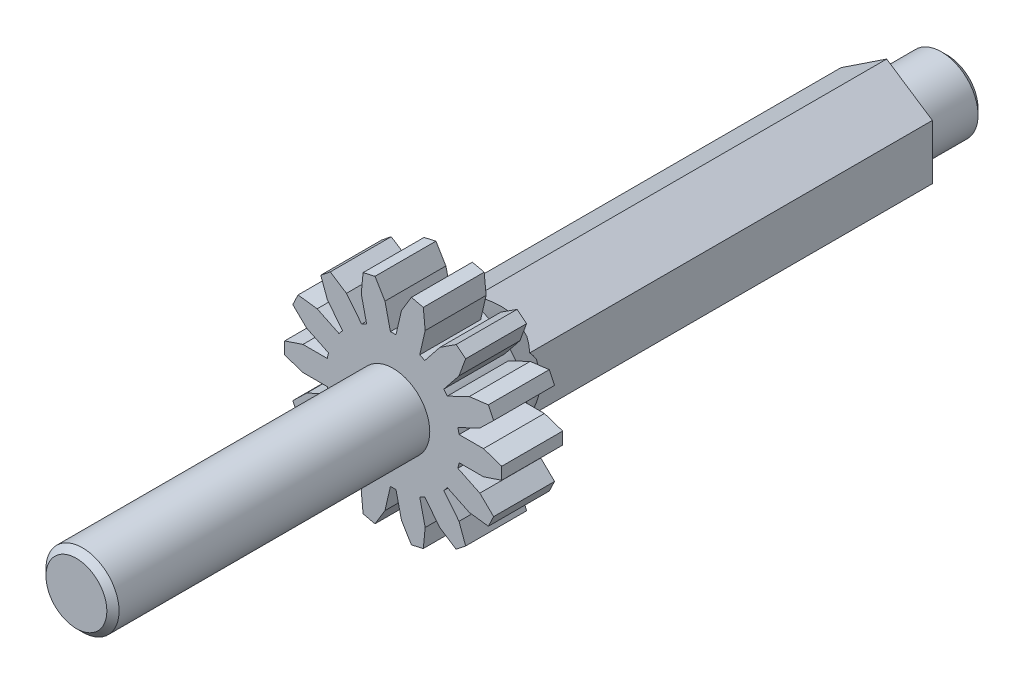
ISO-10303-21;
HEADER;
FILE_DESCRIPTION(('STEP AP214'),'2;1');
FILE_NAME('part.step','',(''),(''),'','','');
FILE_SCHEMA(('AUTOMOTIVE_DESIGN { 1 0 10303 214 1 1 1 1 }'));
ENDSEC;
DATA;
#1=APPLICATION_CONTEXT('core data for automotive mechanical design processes');
#2=APPLICATION_PROTOCOL_DEFINITION('international standard','automotive_design',2000,#1);
#3=PRODUCT_CONTEXT('',#1,'mechanical');
#4=PRODUCT('Part','Part','',(#3));
#5=PRODUCT_RELATED_PRODUCT_CATEGORY('part','',(#4));
#6=PRODUCT_DEFINITION_FORMATION('','',#4);
#7=PRODUCT_DEFINITION_CONTEXT('part definition',#1,'design');
#8=PRODUCT_DEFINITION('design','',#6,#7);
#9=PRODUCT_DEFINITION_SHAPE('','',#8);
#10=(LENGTH_UNIT() NAMED_UNIT(*) SI_UNIT(.MILLI.,.METRE.));
#11=(NAMED_UNIT(*) PLANE_ANGLE_UNIT() SI_UNIT($,.RADIAN.));
#12=(NAMED_UNIT(*) SI_UNIT($,.STERADIAN.) SOLID_ANGLE_UNIT());
#13=UNCERTAINTY_MEASURE_WITH_UNIT(LENGTH_MEASURE(1.E-05),#10,'distance_accuracy_value','');
#14=(GEOMETRIC_REPRESENTATION_CONTEXT(3) GLOBAL_UNCERTAINTY_ASSIGNED_CONTEXT((#13)) GLOBAL_UNIT_ASSIGNED_CONTEXT((#10,
#11,#12)) REPRESENTATION_CONTEXT('',''));
#15=CARTESIAN_POINT('',(0.,0.,0.));
#16=DIRECTION('',(0.,0.,1.));
#17=DIRECTION('',(1.,0.,0.));
#18=AXIS2_PLACEMENT_3D('',#15,#16,#17);
#19=CARTESIAN_POINT('',(0.,0.,65.));
#20=DIRECTION('',(0.,0.,1.));
#21=DIRECTION('',(1.,0.,0.));
#22=AXIS2_PLACEMENT_3D('',#19,#20,#21);
#23=PLANE('',#22);
#24=DIRECTION('',(0.,-1.,0.));
#25=VECTOR('',#24,1.);
#26=CARTESIAN_POINT('',(7.49999999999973,-4.49999999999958,65.));
#27=LINE('',#26,#25);
#28=CARTESIAN_POINT('',(7.49999999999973,3.09445308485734,65.));
#29=VERTEX_POINT('',#28);
#30=CARTESIAN_POINT('',(7.49999999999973,-3.09440144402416,65.));
#31=VERTEX_POINT('',#30);
#32=EDGE_CURVE('E1295',#29,#31,#27,.T.);
#33=ORIENTED_EDGE('',*,*,#32,.F.);
#34=CARTESIAN_POINT('',(0.,0.,64.9999740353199));
#35=DIRECTION('',(0.,0.,1.));
#36=DIRECTION('',(0.9244191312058,-0.381378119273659,0.));
#37=AXIS2_PLACEMENT_3D('',#34,#35,#36);
#38=CIRCLE('',#37,8.1133309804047);
#39=EDGE_CURVE('E1854',#31,#29,#38,.T.);
#40=ORIENTED_EDGE('',*,*,#39,.F.);
#41=EDGE_LOOP('',(#33,#40));
#42=FACE_BOUND('',#41,.T.);
#43=ADVANCED_FACE('F45',(#42),#23,.F.);
#44=DIRECTION('',(-0.833333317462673,-0.552770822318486,0.));
#45=VECTOR('',#44,1.);
#46=CARTESIAN_POINT('',(1.42835326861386E-07,-9.47493740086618,65.));
#47=LINE('',#46,#45);
#48=CARTESIAN_POINT('',(5.91931311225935,-5.54850912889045,65.));
#49=VERTEX_POINT('',#48);
#50=CARTESIAN_POINT('',(2.80993077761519,-7.61104016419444,65.));
#51=VERTEX_POINT('',#50);
#52=EDGE_CURVE('E1332',#49,#51,#47,.T.);
#53=ORIENTED_EDGE('',*,*,#52,.F.);
#54=CARTESIAN_POINT('',(0.,0.,64.999999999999));
#55=DIRECTION('',(0.,0.,1.));
#56=DIRECTION('',(0.346372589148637,-0.938097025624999,0.));
#57=AXIS2_PLACEMENT_3D('',#54,#55,#56);
#58=CIRCLE('',#57,8.11323410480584);
#59=EDGE_CURVE('E1979',#51,#49,#58,.T.);
#60=ORIENTED_EDGE('',*,*,#59,.F.);
#61=EDGE_LOOP('',(#53,#60));
#62=FACE_BOUND('',#61,.T.);
#63=ADVANCED_FACE('F2026',(#62),#23,.F.);
#64=DIRECTION('',(-0.83333334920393,0.552770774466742,0.));
#65=VECTOR('',#64,1.);
#66=CARTESIAN_POINT('',(-7.50000025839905,-4.50000025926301,65.));
#67=LINE('',#66,#65);
#68=CARTESIAN_POINT('',(-2.80971966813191,-7.61118024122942,65.));
#69=VERTEX_POINT('',#68);
#70=CARTESIAN_POINT('',(-5.919444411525,-5.54842355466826,65.));
#71=VERTEX_POINT('',#70);
#72=EDGE_CURVE('E1344',#69,#71,#67,.T.);
#73=ORIENTED_EDGE('',*,*,#72,.F.);
#74=CARTESIAN_POINT('',(0.,0.,65.0000000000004));
#75=DIRECTION('',(0.,0.,1.));
#76=DIRECTION('',(-0.729564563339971,-0.683911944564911,0.));
#77=AXIS2_PLACEMENT_3D('',#74,#75,#76);
#78=CIRCLE('',#77,8.11334597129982);
#79=EDGE_CURVE('E1707',#71,#69,#78,.T.);
#80=ORIENTED_EDGE('',*,*,#79,.F.);
#81=EDGE_LOOP('',(#73,#80));
#82=FACE_BOUND('',#81,.T.);
#83=ADVANCED_FACE('F2030',(#82),#23,.F.);
#84=DIRECTION('',(0.,1.,0.));
#85=VECTOR('',#84,1.);
#86=CARTESIAN_POINT('',(-7.50000025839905,4.49999956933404,65.));
#87=LINE('',#86,#85);
#88=CARTESIAN_POINT('',(-7.50000025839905,-3.09445267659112,65.));
#89=VERTEX_POINT('',#88);
#90=CARTESIAN_POINT('',(-7.50000025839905,3.09440113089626,65.));
#91=VERTEX_POINT('',#90);
#92=EDGE_CURVE('E1338',#89,#91,#87,.T.);
#93=ORIENTED_EDGE('',*,*,#92,.F.);
#94=CARTESIAN_POINT('',(0.,0.,64.9999740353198));
#95=DIRECTION('',(0.,0.,1.));
#96=DIRECTION('',(-0.9244191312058,0.38137811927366,0.));
#97=AXIS2_PLACEMENT_3D('',#94,#95,#96);
#98=CIRCLE('',#97,8.11333098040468);
#99=EDGE_CURVE('E1714',#91,#89,#98,.T.);
#100=ORIENTED_EDGE('',*,*,#99,.F.);
#101=EDGE_LOOP('',(#93,#100));
#102=FACE_BOUND('',#101,.T.);
#103=ADVANCED_FACE('F2037',(#102),#23,.F.);
#104=DIRECTION('',(0.833333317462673,0.552770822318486,0.));
#105=VECTOR('',#104,1.);
#106=CARTESIAN_POINT('',(-4.01234642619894E-07,9.47493697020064,65.));
#107=LINE('',#106,#105);
#108=CARTESIAN_POINT('',(-5.91962374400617,5.54830281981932,65.));
#109=VERTEX_POINT('',#108);
#110=CARTESIAN_POINT('',(-2.80971690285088,7.61118177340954,65.));
#111=VERTEX_POINT('',#110);
#112=EDGE_CURVE('E1336',#109,#111,#107,.T.);
#113=ORIENTED_EDGE('',*,*,#112,.F.);
#114=CARTESIAN_POINT('',(0.,0.,65.0000000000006));
#115=DIRECTION('',(0.,0.,1.));
#116=DIRECTION('',(-0.346372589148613,0.938097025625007,0.));
#117=AXIS2_PLACEMENT_3D('',#114,#115,#116);
#118=CIRCLE('',#117,8.11334597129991);
#119=EDGE_CURVE('E1759',#111,#109,#118,.T.);
#120=ORIENTED_EDGE('',*,*,#119,.F.);
#121=EDGE_LOOP('',(#113,#120));
#122=FACE_BOUND('',#121,.T.);
#123=ADVANCED_FACE('F2032',(#122),#23,.F.);
#124=DIRECTION('',(0.833333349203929,-0.552770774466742,0.));
#125=VECTOR('',#124,1.);
#126=CARTESIAN_POINT('',(7.49999999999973,4.49999982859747,65.));
#127=LINE('',#126,#125);
#128=CARTESIAN_POINT('',(2.80951801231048,7.61131340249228,65.));
#129=VERTEX_POINT('',#128);
#130=CARTESIAN_POINT('',(5.91944846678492,5.54841904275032,65.));
#131=VERTEX_POINT('',#130);
#132=EDGE_CURVE('E1311',#129,#131,#127,.T.);
#133=ORIENTED_EDGE('',*,*,#132,.F.);
#134=CARTESIAN_POINT('',(0.,0.,65.0000000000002));
#135=DIRECTION('',(0.,0.,1.));
#136=DIRECTION('',(0.729564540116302,0.68391196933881,0.));
#137=AXIS2_PLACEMENT_3D('',#134,#135,#136);
#138=CIRCLE('',#137,8.11334597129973);
#139=EDGE_CURVE('E1791',#131,#129,#138,.T.);
#140=ORIENTED_EDGE('',*,*,#139,.F.);
#141=EDGE_LOOP('',(#133,#140));
#142=FACE_BOUND('',#141,.T.);
#143=ADVANCED_FACE('F1385',(#142),#23,.F.);
#144=CARTESIAN_POINT('',(0.,-9.474937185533,0.));
#145=DIRECTION('',(0.552770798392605,-0.833333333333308,0.));
#146=DIRECTION('',(0.833333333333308,0.552770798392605,0.));
#147=AXIS2_PLACEMENT_3D('',#144,#145,#146);
#148=PLANE('',#147);
#149=CARTESIAN_POINT('',(-1.74017546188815E-05,-9.47492564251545,64.9999999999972));
#150=DIRECTION('',(-2.67719297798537E-07,1.77584891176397E-07,0.999999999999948));
#151=VECTOR('',#150,1.);
#152=LINE('',#149,#151);
#153=CARTESIAN_POINT('',(-1.06592395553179E-05,-9.47493407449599,64.9999999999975));
#154=VERTEX_POINT('',#153);
#155=CARTESIAN_POINT('',(-4.23627959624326E-05,-9.47499267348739,67.3585577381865));
#156=VERTEX_POINT('',#155);
#157=EDGE_CURVE('E1724',#154,#156,#152,.T.);
#158=ORIENTED_EDGE('',*,*,#157,.F.);
#159=DIRECTION('',(0.,0.,1.));
#160=VECTOR('',#159,1.);
#161=CARTESIAN_POINT('',(1.42835326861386E-07,-9.47493740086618,0.));
#162=LINE('',#161,#160);
#163=CARTESIAN_POINT('',(1.42835326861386E-07,-9.47493740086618,0.));
#164=VERTEX_POINT('',#163);
#165=EDGE_CURVE('E1997',#164,#154,#162,.T.);
#166=ORIENTED_EDGE('',*,*,#165,.F.);
#167=DIRECTION('',(-0.833333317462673,-0.552770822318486,0.));
#168=VECTOR('',#167,1.);
#169=CARTESIAN_POINT('',(1.42835326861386E-07,-9.47493740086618,0.));
#170=LINE('',#169,#168);
#171=CARTESIAN_POINT('',(7.49999999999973,-4.49999999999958,0.));
#172=VERTEX_POINT('',#171);
#173=EDGE_CURVE('E1310',#172,#164,#170,.T.);
#174=ORIENTED_EDGE('',*,*,#173,.F.);
#175=DIRECTION('',(0.,0.,-1.));
#176=VECTOR('',#175,1.);
#177=CARTESIAN_POINT('',(7.5,-4.5,0.));
#178=LINE('',#177,#176);
#179=CARTESIAN_POINT('',(7.49999999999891,-4.49999999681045,66.0965168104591));
#180=VERTEX_POINT('',#179);
#181=EDGE_CURVE('E1801',#180,#172,#178,.T.);
#182=ORIENTED_EDGE('',*,*,#181,.F.);
#183=CARTESIAN_POINT('',(7.49999999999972,-4.49999999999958,66.0965168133));
#184=CARTESIAN_POINT('',(7.3754586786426,-4.58261136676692,65.9851644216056));
#185=CARTESIAN_POINT('',(7.24677237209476,-4.6679722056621,65.87784843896));
#186=B_SPLINE_CURVE_WITH_KNOTS('',2,(#183,#184,#185),.UNSPECIFIED.,.F.,.F.,(3,3),(0.,1.),.UNSPECIFIED.);
#187=CARTESIAN_POINT('',(7.24680174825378,-4.66799819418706,65.8778341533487));
#188=VERTEX_POINT('',#187);
#189=EDGE_CURVE('E1350',#180,#188,#186,.T.);
#190=ORIENTED_EDGE('',*,*,#189,.T.);
#191=CARTESIAN_POINT('',(5.91913284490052,-5.54873264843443,64.9999999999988));
#192=CARTESIAN_POINT('',(5.97431045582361,-5.51211906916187,65.0263535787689));
#193=CARTESIAN_POINT('',(6.02910328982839,-5.47575529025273,65.0538469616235));
#194=CARTESIAN_POINT('',(6.13875132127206,-5.40298316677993,65.1114044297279));
#195=CARTESIAN_POINT('',(6.19359443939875,-5.36658278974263,65.1415016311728));
#196=CARTESIAN_POINT('',(6.30339670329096,-5.29371011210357,65.2042645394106));
#197=CARTESIAN_POINT('',(6.35834198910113,-5.25724709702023,65.2369651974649));
#198=CARTESIAN_POINT('',(6.46840164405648,-5.1842175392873,65.3049334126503));
#199=CARTESIAN_POINT('',(6.52350058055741,-5.14766139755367,65.3402370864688));
#200=CARTESIAN_POINT('',(6.63391662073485,-5.07441380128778,65.4134103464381));
#201=CARTESIAN_POINT('',(6.68921689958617,-5.03773369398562,65.451316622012));
#202=CARTESIAN_POINT('',(6.80008175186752,-4.96420535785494,65.5296949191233));
#203=CARTESIAN_POINT('',(6.85562832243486,-4.927369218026,65.5702036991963));
#204=CARTESIAN_POINT('',(6.96702850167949,-4.8534957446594,65.6537863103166));
#205=CARTESIAN_POINT('',(7.02286313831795,-4.81647104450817,65.696896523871));
#206=CARTESIAN_POINT('',(7.13487984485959,-4.74218630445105,65.7856856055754));
#207=CARTESIAN_POINT('',(7.19104219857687,-4.70493922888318,65.83140022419));
#208=CARTESIAN_POINT('',(7.24676243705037,-4.66797879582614,65.8778655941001));
#209=B_SPLINE_CURVE_WITH_KNOTS('',3,(#191,#192,#193,#194,#195,#196,#197,#198,#199,#200,#201,
#202,#203,#204,#205,#206,#207,#208),.UNSPECIFIED.,.F.,.F.,(4,2,2,2,2,2,2,2,4),(0.,
0.213797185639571,0.430892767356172,0.651676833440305,0.876516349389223,1.10575508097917,
1.33971386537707,1.57869116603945,1.82296384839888),.UNSPECIFIED.);
#210=EDGE_CURVE('E2051',#49,#188,#209,.T.);
#211=ORIENTED_EDGE('',*,*,#210,.F.);
#212=ORIENTED_EDGE('',*,*,#52,.T.);
#213=CARTESIAN_POINT('',(-5.93324737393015E-05,-9.47496298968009,67.3585878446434));
#214=CARTESIAN_POINT('',(0.122264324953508,-9.3938215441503,67.2181035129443));
#215=CARTESIAN_POINT('',(0.246271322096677,-9.31156024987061,67.079667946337));
#216=CARTESIAN_POINT('',(0.492542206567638,-9.14819487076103,66.8141022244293));
#217=CARTESIAN_POINT('',(0.61463527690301,-9.0672040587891,66.6867434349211));
#218=CARTESIAN_POINT('',(0.857331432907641,-8.90621783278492,66.4432973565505));
#219=CARTESIAN_POINT('',(0.977759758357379,-8.82633803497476,66.3269606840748));
#220=CARTESIAN_POINT('',(1.21743180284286,-8.66737612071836,66.1056023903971));
#221=CARTESIAN_POINT('',(1.33650006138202,-8.5884098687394,66.0003088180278));
#222=CARTESIAN_POINT('',(1.56993128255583,-8.43355652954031,65.8042202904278));
#223=CARTESIAN_POINT('',(1.68400445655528,-8.35786464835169,65.7129279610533));
#224=CARTESIAN_POINT('',(1.9111308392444,-8.20716529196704,65.5414270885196));
#225=CARTESIAN_POINT('',(2.0240220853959,-8.13226496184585,65.4609126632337));
#226=CARTESIAN_POINT('',(2.19448711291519,-8.01920257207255,65.3474024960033));
#227=CARTESIAN_POINT('',(2.25061585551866,-7.9819804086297,65.3112843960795));
#228=CARTESIAN_POINT('',(2.36273850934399,-7.90763550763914,65.2417858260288));
#229=CARTESIAN_POINT('',(2.41871584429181,-7.87052357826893,65.2083671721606));
#230=CARTESIAN_POINT('',(2.53058331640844,-7.79636399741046,65.1442677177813));
#231=CARTESIAN_POINT('',(2.58645865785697,-7.75932604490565,65.1135499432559));
#232=CARTESIAN_POINT('',(2.69816697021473,-7.68527564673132,65.0548505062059));
#233=CARTESIAN_POINT('',(2.75398719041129,-7.64827169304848,65.0268338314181));
#234=CARTESIAN_POINT('',(2.81020190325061,-7.61100078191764,64.999999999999));
#235=B_SPLINE_CURVE_WITH_KNOTS('',3,(#213,#214,#215,#216,#217,#218,#219,#220,#221,#222,#223,
#224,#225,#226,#227,#228,#229,#230,#231,#232,#233,#234),.UNSPECIFIED.,.F.,.F.,(4,2,2,2,2,2,2,2,
2,2,4),(0.,0.609589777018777,1.19186854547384,1.7482800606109,2.28054100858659,2.7739989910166,
3.24652677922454,3.4757651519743,3.70077910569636,3.92195537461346,4.13970558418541),.UNSPECIFIED.);
#236=EDGE_CURVE('E2056',#156,#51,#235,.T.);
#237=ORIENTED_EDGE('',*,*,#236,.F.);
#238=EDGE_LOOP('',(#158,#166,#174,#182,#190,#211,#212,#237));
#239=FACE_BOUND('',#238,.T.);
#240=ADVANCED_FACE('F1378',(#239),#148,.T.);
#241=CARTESIAN_POINT('',(7.5,-4.5,0.));
#242=DIRECTION('',(1.,0.,0.));
#243=DIRECTION('',(0.,0.,-1.));
#244=AXIS2_PLACEMENT_3D('',#241,#242,#243);
#245=PLANE('',#244);
#246=ORIENTED_EDGE('',*,*,#181,.T.);
#247=DIRECTION('',(0.,-1.,0.));
#248=VECTOR('',#247,1.);
#249=CARTESIAN_POINT('',(7.49999999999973,-4.49999999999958,0.));
#250=LINE('',#249,#248);
#251=CARTESIAN_POINT('',(7.49999999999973,4.49999982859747,0.));
#252=VERTEX_POINT('',#251);
#253=EDGE_CURVE('E1307',#252,#172,#250,.T.);
#254=ORIENTED_EDGE('',*,*,#253,.F.);
#255=DIRECTION('',(0.,0.,1.));
#256=VECTOR('',#255,1.);
#257=CARTESIAN_POINT('',(7.50000025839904,4.49999982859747,0.));
#258=LINE('',#257,#256);
#259=CARTESIAN_POINT('',(7.50000071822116,4.50000032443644,66.0965202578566));
#260=VERTEX_POINT('',#259);
#261=EDGE_CURVE('E1798',#260,#252,#258,.F.);
#262=ORIENTED_EDGE('',*,*,#261,.F.);
#263=CARTESIAN_POINT('',(7.5001188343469,3.09424535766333,64.9999737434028));
#264=CARTESIAN_POINT('',(7.50011745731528,3.15229409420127,65.0383175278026));
#265=CARTESIAN_POINT('',(7.50011330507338,3.20992033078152,65.07729708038));
#266=CARTESIAN_POINT('',(7.50010179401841,3.3253999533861,65.1571568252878));
#267=CARTESIAN_POINT('',(7.50009437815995,3.38323834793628,65.1980587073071));
#268=CARTESIAN_POINT('',(7.50007876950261,3.49917220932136,65.2817619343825));
#269=CARTESIAN_POINT('',(7.50007056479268,3.55725235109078,65.3245844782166));
#270=CARTESIAN_POINT('',(7.50005478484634,3.67369878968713,65.4121299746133));
#271=CARTESIAN_POINT('',(7.50004722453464,3.73204955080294,65.4568735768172));
#272=CARTESIAN_POINT('',(7.50003361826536,3.84906480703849,65.5482616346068));
#273=CARTESIAN_POINT('',(7.50002760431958,3.90771365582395,65.5949261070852));
#274=CARTESIAN_POINT('',(7.50001745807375,4.02535132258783,65.690156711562));
#275=CARTESIAN_POINT('',(7.50001336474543,4.08432447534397,65.7387421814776));
#276=CARTESIAN_POINT('',(7.500007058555,4.20263576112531,65.837815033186));
#277=CARTESIAN_POINT('',(7.5000048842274,4.26195829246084,65.8883210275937));
#278=CARTESIAN_POINT('',(7.50000210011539,4.38099156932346,65.9912373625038));
#279=CARTESIAN_POINT('',(7.50000152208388,4.44068683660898,66.0436656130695));
#280=CARTESIAN_POINT('',(7.50000154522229,4.50000065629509,66.0965196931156));
#281=B_SPLINE_CURVE_WITH_KNOTS('',3,(#263,#264,#265,#266,#267,#268,#269,#270,#271,#272,#273,
#274,#275,#276,#277,#278,#279,#280),.UNSPECIFIED.,.F.,.F.,(4,2,2,2,2,2,2,2,4),(0.,
0.208700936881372,0.421204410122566,0.63767129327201,0.858251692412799,1.08308545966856,
1.31230272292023,1.54602442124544,1.78436283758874),.UNSPECIFIED.);
#282=EDGE_CURVE('E2042',#29,#260,#281,.T.);
#283=ORIENTED_EDGE('',*,*,#282,.F.);
#284=ORIENTED_EDGE('',*,*,#32,.T.);
#285=CARTESIAN_POINT('',(7.4999999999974,-4.49999998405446,66.0965167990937));
#286=CARTESIAN_POINT('',(7.49999997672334,-4.44068668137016,66.0436631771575));
#287=CARTESIAN_POINT('',(7.50000057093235,-4.38099192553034,65.9912353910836));
#288=CARTESIAN_POINT('',(7.50000341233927,-4.26195954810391,65.8883198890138));
#289=CARTESIAN_POINT('',(7.50000562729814,-4.20263740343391,65.8378142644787));
#290=CARTESIAN_POINT('',(7.5000120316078,-4.08432676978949,65.7387420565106));
#291=CARTESIAN_POINT('',(7.50001618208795,-4.02535388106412,65.6901568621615));
#292=CARTESIAN_POINT('',(7.50002645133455,-3.90771662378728,65.5949267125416));
#293=CARTESIAN_POINT('',(7.50003253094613,-3.84906791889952,65.5482624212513));
#294=CARTESIAN_POINT('',(7.50004626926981,-3.73205283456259,65.4568746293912));
#295=CARTESIAN_POINT('',(7.50005389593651,-3.67370209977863,65.4121311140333));
#296=CARTESIAN_POINT('',(7.50006980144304,-3.55725560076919,65.3245856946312));
#297=CARTESIAN_POINT('',(7.5000780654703,-3.49917537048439,65.2817631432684));
#298=CARTESIAN_POINT('',(7.50009377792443,-3.38324122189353,65.1980598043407));
#299=CARTESIAN_POINT('',(7.50010123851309,-3.32540262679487,65.1571578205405));
#300=CARTESIAN_POINT('',(7.50011281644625,-3.20992249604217,65.0772977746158));
#301=CARTESIAN_POINT('',(7.50011699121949,-3.15229594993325,65.0383180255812));
#302=CARTESIAN_POINT('',(7.50011837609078,-3.09424691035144,64.9999740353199));
#303=B_SPLINE_CURVE_WITH_KNOTS('',3,(#285,#286,#287,#288,#289,#290,#291,#292,#293,#294,#295,
#296,#297,#298,#299,#300,#301,#302),.UNSPECIFIED.,.F.,.F.,(4,2,2,2,2,2,2,2,4),(0.,
0.238336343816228,0.472056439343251,0.701272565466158,0.926105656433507,1.14668583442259,
1.36315294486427,1.5756570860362,1.78435912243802),.UNSPECIFIED.);
#304=EDGE_CURVE('E1837',#180,#31,#303,.T.);
#305=ORIENTED_EDGE('',*,*,#304,.F.);
#306=EDGE_LOOP('',(#246,#254,#262,#283,#284,#305));
#307=FACE_BOUND('',#306,.T.);
#308=ADVANCED_FACE('F1814',(#307),#245,.T.);
#309=CARTESIAN_POINT('',(7.5,4.5,0.));
#310=DIRECTION('',(0.552770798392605,0.833333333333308,0.));
#311=DIRECTION('',(-0.833333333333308,0.552770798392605,0.));
#312=AXIS2_PLACEMENT_3D('',#309,#310,#311);
#313=PLANE('',#312);
#314=ORIENTED_EDGE('',*,*,#261,.T.);
#315=DIRECTION('',(0.833333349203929,-0.552770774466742,0.));
#316=VECTOR('',#315,1.);
#317=CARTESIAN_POINT('',(7.49999999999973,4.49999982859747,0.));
#318=LINE('',#317,#316);
#319=CARTESIAN_POINT('',(-4.01234642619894E-07,9.47493697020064,0.));
#320=VERTEX_POINT('',#319);
#321=EDGE_CURVE('E1321',#320,#252,#318,.T.);
#322=ORIENTED_EDGE('',*,*,#321,.F.);
#323=DIRECTION('',(0.,0.,1.));
#324=VECTOR('',#323,1.);
#325=CARTESIAN_POINT('',(-4.01234642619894E-07,9.47493697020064,0.));
#326=LINE('',#325,#324);
#327=CARTESIAN_POINT('',(2.32242792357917E-05,9.47494396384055,64.9999999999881));
#328=VERTEX_POINT('',#327);
#329=EDGE_CURVE('E1324',#320,#328,#326,.T.);
#330=ORIENTED_EDGE('',*,*,#329,.T.);
#331=CARTESIAN_POINT('',(3.92905878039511E-05,9.47496324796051,67.35856351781));
#332=DIRECTION('',(-5.83305013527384E-07,-3.86920773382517E-07,-0.999999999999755));
#333=VECTOR('',#332,1.);
#334=LINE('',#331,#333);
#335=CARTESIAN_POINT('',(1.77392750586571E-05,9.47499740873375,67.3585460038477));
#336=VERTEX_POINT('',#335);
#337=EDGE_CURVE('E1725',#336,#328,#334,.T.);
#338=ORIENTED_EDGE('',*,*,#337,.F.);
#339=CARTESIAN_POINT('',(2.81024533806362,7.61110399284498,65.0000000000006));
#340=CARTESIAN_POINT('',(2.75411721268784,7.64831152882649,65.0267823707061));
#341=CARTESIAN_POINT('',(2.69838327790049,7.68525354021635,65.0547453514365));
#342=CARTESIAN_POINT('',(2.58684466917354,7.75918383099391,65.1133337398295));
#343=CARTESIAN_POINT('',(2.53105277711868,7.79616362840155,65.1439942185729));
#344=CARTESIAN_POINT('',(2.41934921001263,7.87021029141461,65.2079754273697));
#345=CARTESIAN_POINT('',(2.36345235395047,7.90726746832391,65.2413331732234));
#346=CARTESIAN_POINT('',(2.25148749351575,7.98150587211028,65.3107062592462));
#347=CARTESIAN_POINT('',(2.19543607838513,8.01867630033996,65.3467598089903));
#348=CARTESIAN_POINT('',(2.02519672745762,8.13158862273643,65.4600716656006));
#349=CARTESIAN_POINT('',(1.9124510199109,8.20639353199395,65.5404464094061));
#350=CARTESIAN_POINT('',(1.68559988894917,8.35690918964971,65.7116518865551));
#351=CARTESIAN_POINT('',(1.57165619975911,8.43251279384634,65.8027883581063));
#352=CARTESIAN_POINT('',(1.33823191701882,8.58735896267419,65.9987602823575));
#353=CARTESIAN_POINT('',(1.2190493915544,8.66640093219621,66.1041074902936));
#354=CARTESIAN_POINT('',(0.979129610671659,8.82553403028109,66.3256216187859));
#355=CARTESIAN_POINT('',(0.858569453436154,8.90550853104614,66.4420628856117));
#356=CARTESIAN_POINT('',(0.615583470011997,9.0667016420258,66.6857648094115));
#357=CARTESIAN_POINT('',(0.493333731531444,9.14780374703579,66.813276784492));
#358=CARTESIAN_POINT('',(0.246720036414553,9.31140750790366,67.0791969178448));
#359=CARTESIAN_POINT('',(0.122528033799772,9.39379494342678,67.2178353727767));
#360=CARTESIAN_POINT('',(2.00807769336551E-05,9.47505768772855,67.3585255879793));
#361=B_SPLINE_CURVE_WITH_KNOTS('',3,(#339,#340,#341,#342,#343,#344,#345,#346,#347,#348,#349,
#350,#351,#352,#353,#354,#355,#356,#357,#358,#359,#360),.UNSPECIFIED.,.F.,.F.,(4,2,2,2,2,2,2,2,
2,2,4),(0.,0.217394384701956,0.43822181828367,0.662893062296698,0.891794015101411,
1.36365980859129,1.85646789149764,2.38915422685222,2.94614080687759,3.52915561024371,
4.1396510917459),.UNSPECIFIED.);
#362=EDGE_CURVE('E1786',#129,#336,#361,.T.);
#363=ORIENTED_EDGE('',*,*,#362,.F.);
#364=ORIENTED_EDGE('',*,*,#132,.T.);
#365=CARTESIAN_POINT('',(7.5000015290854,4.50000093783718,66.0965199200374));
#366=CARTESIAN_POINT('',(7.43345205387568,4.54414465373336,66.0370233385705));
#367=CARTESIAN_POINT('',(7.36628610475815,4.58868527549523,65.9784978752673));
#368=CARTESIAN_POINT('',(7.23242947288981,4.67744213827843,65.8651625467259));
#369=CARTESIAN_POINT('',(7.1657724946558,4.72163626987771,65.8102954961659));
#370=CARTESIAN_POINT('',(7.03287336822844,4.80975412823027,65.7042724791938));
#371=CARTESIAN_POINT('',(6.96666390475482,4.85365606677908,65.6530575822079));
#372=CARTESIAN_POINT('',(6.83459503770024,4.94124180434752,65.5543423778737));
#373=CARTESIAN_POINT('',(6.76876682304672,4.98490458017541,65.5067817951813));
#374=CARTESIAN_POINT('',(6.63739026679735,5.07206311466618,65.4153758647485));
#375=CARTESIAN_POINT('',(6.57187113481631,5.1155390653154,65.3714697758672));
#376=CARTESIAN_POINT('',(6.44103770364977,5.20237256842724,65.287373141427));
#377=CARTESIAN_POINT('',(6.37575012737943,5.24571200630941,65.2471224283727));
#378=CARTESIAN_POINT('',(6.24529784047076,5.33232024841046,65.1703356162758));
#379=CARTESIAN_POINT('',(6.18015692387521,5.37557303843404,65.1337412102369));
#380=CARTESIAN_POINT('',(6.04991566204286,5.46204667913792,65.0642646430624));
#381=CARTESIAN_POINT('',(5.98483567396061,5.50525410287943,65.0313275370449));
#382=CARTESIAN_POINT('',(5.91920952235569,5.54881442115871,65.0000000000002));
#383=B_SPLINE_CURVE_WITH_KNOTS('',3,(#365,#366,#367,#368,#369,#370,#371,#372,#373,#374,#375,
#376,#377,#378,#379,#380,#381,#382),.UNSPECIFIED.,.F.,.F.,(4,2,2,2,2,2,2,2,4),(0.,
0.298761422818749,0.589690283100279,0.873208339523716,1.14977793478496,1.41990413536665,
1.68413639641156,1.94306955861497,2.19734397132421),.UNSPECIFIED.);
#384=EDGE_CURVE('E2039',#260,#131,#383,.T.);
#385=ORIENTED_EDGE('',*,*,#384,.F.);
#386=EDGE_LOOP('',(#314,#322,#330,#338,#363,#364,#385));
#387=FACE_BOUND('',#386,.T.);
#388=ADVANCED_FACE('F1805',(#387),#313,.T.);
#389=CARTESIAN_POINT('',(0.,9.474937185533,0.));
#390=DIRECTION('',(-0.552770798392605,0.833333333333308,0.));
#391=DIRECTION('',(-0.833333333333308,-0.552770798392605,0.));
#392=AXIS2_PLACEMENT_3D('',#389,#390,#391);
#393=PLANE('',#392);
#394=ORIENTED_EDGE('',*,*,#337,.T.);
#395=ORIENTED_EDGE('',*,*,#329,.F.);
#396=DIRECTION('',(0.833333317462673,0.552770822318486,0.));
#397=VECTOR('',#396,1.);
#398=CARTESIAN_POINT('',(-4.01234642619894E-07,9.47493697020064,0.));
#399=LINE('',#398,#397);
#400=CARTESIAN_POINT('',(-7.50000025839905,4.49999956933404,0.));
#401=VERTEX_POINT('',#400);
#402=EDGE_CURVE('E1319',#401,#320,#399,.T.);
#403=ORIENTED_EDGE('',*,*,#402,.F.);
#404=DIRECTION('',(0.,0.,1.));
#405=VECTOR('',#404,1.);
#406=CARTESIAN_POINT('',(-7.5,4.5,0.));
#407=LINE('',#406,#405);
#408=CARTESIAN_POINT('',(-7.49999995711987,4.50000002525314,66.0965167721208));
#409=VERTEX_POINT('',#408);
#410=EDGE_CURVE('E1721',#409,#401,#407,.F.);
#411=ORIENTED_EDGE('',*,*,#410,.F.);
#412=CARTESIAN_POINT('',(-5.91921445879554,5.54880915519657,65.0000000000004));
#413=CARTESIAN_POINT('',(-5.98484185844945,5.50524854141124,65.0313288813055));
#414=CARTESIAN_POINT('',(-6.04992306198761,5.46204070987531,65.0642672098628));
#415=CARTESIAN_POINT('',(-6.18016630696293,5.37556634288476,65.1337458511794));
#416=CARTESIAN_POINT('',(-6.2453079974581,5.33231322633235,65.1703410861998));
#417=CARTESIAN_POINT('',(-6.37576139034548,5.24570446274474,65.247129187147));
#418=CARTESIAN_POINT('',(-6.4410493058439,5.20236482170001,65.2873803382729));
#419=CARTESIAN_POINT('',(-6.57188297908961,5.11553108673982,65.3714774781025));
#420=CARTESIAN_POINT('',(-6.63740202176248,5.07205509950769,65.4153836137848));
#421=CARTESIAN_POINT('',(-6.76877797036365,4.98489670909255,65.506789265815));
#422=CARTESIAN_POINT('',(-6.8346056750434,4.94123410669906,65.5543495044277));
#423=CARTESIAN_POINT('',(-6.96667310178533,4.85364897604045,65.6530636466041));
#424=CARTESIAN_POINT('',(-7.03288164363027,4.80974746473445,65.7042778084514));
#425=CARTESIAN_POINT('',(-7.16577851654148,4.72163076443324,65.8102989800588));
#426=CARTESIAN_POINT('',(-7.23243417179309,4.67743735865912,65.8651649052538));
#427=CARTESIAN_POINT('',(-7.36628775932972,4.58868229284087,65.9784976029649));
#428=CARTESIAN_POINT('',(-7.43345199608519,4.54414273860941,66.0370215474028));
#429=CARTESIAN_POINT('',(-7.49999978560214,4.50000014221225,66.0965166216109));
#430=B_SPLINE_CURVE_WITH_KNOTS('',3,(#412,#413,#414,#415,#416,#417,#418,#419,#420,#421,#422,
#423,#424,#425,#426,#427,#428,#429),.UNSPECIFIED.,.F.,.F.,(4,2,2,2,2,2,2,2,4),(0.,
0.254279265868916,0.513215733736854,0.777449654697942,1.04757578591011,1.32414351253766,
1.60765784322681,1.89858107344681,2.19733492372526),.UNSPECIFIED.);
#431=EDGE_CURVE('E1754',#109,#409,#430,.T.);
#432=ORIENTED_EDGE('',*,*,#431,.F.);
#433=ORIENTED_EDGE('',*,*,#112,.T.);
#434=CARTESIAN_POINT('',(1.98404131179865E-05,9.47505777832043,67.3585257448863));
#435=CARTESIAN_POINT('',(-0.122314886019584,9.39390917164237,67.2180318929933));
#436=CARTESIAN_POINT('',(-0.246331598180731,9.31163995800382,67.0795860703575));
#437=CARTESIAN_POINT('',(-0.492613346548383,9.1482627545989,66.8140074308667));
#438=CARTESIAN_POINT('',(-0.614707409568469,9.06726821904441,66.686645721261));
#439=CARTESIAN_POINT('',(-0.85739793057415,8.90627946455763,66.4432011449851));
#440=CARTESIAN_POINT('',(-0.977819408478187,8.82640101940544,66.3268685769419));
#441=CARTESIAN_POINT('',(-1.21747246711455,8.66744800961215,66.1055268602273));
#442=CARTESIAN_POINT('',(-1.33652824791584,8.58848942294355,66.0002453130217));
#443=CARTESIAN_POINT('',(-1.569963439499,8.4336329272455,65.8041552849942));
#444=CARTESIAN_POINT('',(-1.68405397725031,8.35792955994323,65.7128510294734));
#445=CARTESIAN_POINT('',(-1.91120338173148,8.20721450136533,65.5413372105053));
#446=CARTESIAN_POINT('',(-2.0240998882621,8.13231023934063,65.4608209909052));
#447=CARTESIAN_POINT('',(-2.19457064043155,8.01924572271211,65.347314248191));
#448=CARTESIAN_POINT('',(-2.25069854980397,7.98202502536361,65.311199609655));
#449=CARTESIAN_POINT('',(-2.36281741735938,7.90768544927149,65.2417108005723));
#450=CARTESIAN_POINT('',(-2.41879173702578,7.87057740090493,65.2082983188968));
#451=CARTESIAN_POINT('',(-2.53065130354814,7.79642812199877,65.1442140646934));
#452=CARTESIAN_POINT('',(-2.5865216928,7.75939660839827,65.1135051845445));
#453=CARTESIAN_POINT('',(-2.69821844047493,7.6853617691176,65.054826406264));
#454=CARTESIAN_POINT('',(-2.7540319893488,7.64836694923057,65.0268213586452));
#455=CARTESIAN_POINT('',(-2.81024065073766,7.6111057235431,65.0000000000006));
#456=B_SPLINE_CURVE_WITH_KNOTS('',3,(#434,#435,#436,#437,#438,#439,#440,#441,#442,#443,#444,
#445,#446,#447,#448,#449,#450,#451,#452,#453,#454,#455),.UNSPECIFIED.,.F.,.F.,(4,2,2,2,2,2,2,2,
2,2,4),(0.,0.609638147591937,1.19192924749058,1.7483179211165,2.28052209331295,2.77405184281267,
3.24659916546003,3.47582861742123,3.70082177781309,3.9219659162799,4.13967327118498),.UNSPECIFIED.);
#457=EDGE_CURVE('E1774',#336,#111,#456,.T.);
#458=ORIENTED_EDGE('',*,*,#457,.F.);
#459=EDGE_LOOP('',(#394,#395,#403,#411,#432,#433,#458));
#460=FACE_BOUND('',#459,.T.);
#461=ADVANCED_FACE('F1737',(#460),#393,.T.);
#462=CARTESIAN_POINT('',(-7.5,4.5,0.));
#463=DIRECTION('',(-1.,0.,0.));
#464=DIRECTION('',(0.,0.,1.));
#465=AXIS2_PLACEMENT_3D('',#462,#463,#464);
#466=PLANE('',#465);
#467=ORIENTED_EDGE('',*,*,#410,.T.);
#468=DIRECTION('',(0.,1.,0.));
#469=VECTOR('',#468,1.);
#470=CARTESIAN_POINT('',(-7.50000025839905,4.49999956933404,0.));
#471=LINE('',#470,#469);
#472=CARTESIAN_POINT('',(-7.50000025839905,-4.50000025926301,0.));
#473=VERTEX_POINT('',#472);
#474=EDGE_CURVE('E1316',#473,#401,#471,.T.);
#475=ORIENTED_EDGE('',*,*,#474,.F.);
#476=DIRECTION('',(0.,0.,1.));
#477=VECTOR('',#476,1.);
#478=CARTESIAN_POINT('',(-7.50000025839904,-4.49999982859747,0.));
#479=LINE('',#478,#477);
#480=CARTESIAN_POINT('',(-7.50000071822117,-4.50000032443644,66.0965202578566));
#481=VERTEX_POINT('',#480);
#482=EDGE_CURVE('E1703',#481,#473,#479,.F.);
#483=ORIENTED_EDGE('',*,*,#482,.F.);
#484=CARTESIAN_POINT('',(-7.50011883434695,-3.09424535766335,64.9999737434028));
#485=CARTESIAN_POINT('',(-7.50011745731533,-3.15229409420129,65.0383175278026));
#486=CARTESIAN_POINT('',(-7.50011330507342,-3.20992033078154,65.07729708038));
#487=CARTESIAN_POINT('',(-7.50010179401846,-3.32539995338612,65.1571568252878));
#488=CARTESIAN_POINT('',(-7.50009437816,-3.3832383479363,65.198058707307));
#489=CARTESIAN_POINT('',(-7.50007876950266,-3.49917220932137,65.2817619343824));
#490=CARTESIAN_POINT('',(-7.50007056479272,-3.5572523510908,65.3245844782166));
#491=CARTESIAN_POINT('',(-7.50005478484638,-3.67369878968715,65.4121299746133));
#492=CARTESIAN_POINT('',(-7.50004722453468,-3.73204955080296,65.4568735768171));
#493=CARTESIAN_POINT('',(-7.50003361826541,-3.8490648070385,65.5482616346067));
#494=CARTESIAN_POINT('',(-7.50002760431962,-3.90771365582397,65.5949261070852));
#495=CARTESIAN_POINT('',(-7.5000174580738,-4.02535132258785,65.690156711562));
#496=CARTESIAN_POINT('',(-7.50001336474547,-4.08432447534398,65.7387421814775));
#497=CARTESIAN_POINT('',(-7.50000705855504,-4.20263576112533,65.8378150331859));
#498=CARTESIAN_POINT('',(-7.50000488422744,-4.26195829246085,65.8883210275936));
#499=CARTESIAN_POINT('',(-7.50000210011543,-4.38099156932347,65.9912373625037));
#500=CARTESIAN_POINT('',(-7.50000152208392,-4.44068683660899,66.0436656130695));
#501=CARTESIAN_POINT('',(-7.50000154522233,-4.5000006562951,66.0965196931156));
#502=B_SPLINE_CURVE_WITH_KNOTS('',3,(#484,#485,#486,#487,#488,#489,#490,#491,#492,#493,#494,
#495,#496,#497,#498,#499,#500,#501),.UNSPECIFIED.,.F.,.F.,(4,2,2,2,2,2,2,2,4),(0.,
0.208700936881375,0.421204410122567,0.637671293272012,0.8582516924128,1.08308545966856,
1.31230272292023,1.54602442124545,1.78436283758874),.UNSPECIFIED.);
#503=EDGE_CURVE('E1708',#89,#481,#502,.T.);
#504=ORIENTED_EDGE('',*,*,#503,.F.);
#505=ORIENTED_EDGE('',*,*,#92,.T.);
#506=CARTESIAN_POINT('',(-7.49999999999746,4.49999998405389,66.0965167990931));
#507=CARTESIAN_POINT('',(-7.4999999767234,4.44068668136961,66.043663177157));
#508=CARTESIAN_POINT('',(-7.50000057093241,4.38099192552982,65.9912353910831));
#509=CARTESIAN_POINT('',(-7.50000341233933,4.26195954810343,65.8883198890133));
#510=CARTESIAN_POINT('',(-7.5000056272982,4.20263740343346,65.8378142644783));
#511=CARTESIAN_POINT('',(-7.50001203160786,4.08432676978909,65.7387420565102));
#512=CARTESIAN_POINT('',(-7.50001618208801,4.02535388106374,65.6901568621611));
#513=CARTESIAN_POINT('',(-7.50002645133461,3.90771662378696,65.5949267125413));
#514=CARTESIAN_POINT('',(-7.50003253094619,3.84906791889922,65.548262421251));
#515=CARTESIAN_POINT('',(-7.50004626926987,3.73205283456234,65.4568746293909));
#516=CARTESIAN_POINT('',(-7.50005389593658,3.6737020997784,65.4121311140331));
#517=CARTESIAN_POINT('',(-7.5000698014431,3.55725560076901,65.3245856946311));
#518=CARTESIAN_POINT('',(-7.50007806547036,3.49917537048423,65.2817631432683));
#519=CARTESIAN_POINT('',(-7.50009377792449,3.38324122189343,65.1980598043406));
#520=CARTESIAN_POINT('',(-7.50010123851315,3.32540262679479,65.1571578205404));
#521=CARTESIAN_POINT('',(-7.50011281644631,3.20992249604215,65.0772977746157));
#522=CARTESIAN_POINT('',(-7.50011699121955,3.15229594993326,65.0383180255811));
#523=CARTESIAN_POINT('',(-7.50011837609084,3.09424691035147,64.9999740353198));
#524=B_SPLINE_CURVE_WITH_KNOTS('',3,(#506,#507,#508,#509,#510,#511,#512,#513,#514,#515,#516,
#517,#518,#519,#520,#521,#522,#523),.UNSPECIFIED.,.F.,.F.,(4,2,2,2,2,2,2,2,4),(0.,
0.238336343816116,0.472056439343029,0.701272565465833,0.926105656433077,1.14668583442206,
1.36315294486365,1.57565708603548,1.78435912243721),.UNSPECIFIED.);
#525=EDGE_CURVE('E1750',#409,#91,#524,.T.);
#526=ORIENTED_EDGE('',*,*,#525,.F.);
#527=EDGE_LOOP('',(#467,#475,#483,#504,#505,#526));
#528=FACE_BOUND('',#527,.T.);
#529=ADVANCED_FACE('F1675',(#528),#466,.T.);
#530=CARTESIAN_POINT('',(-7.5,-4.5,0.));
#531=DIRECTION('',(-0.552770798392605,-0.833333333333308,0.));
#532=DIRECTION('',(0.833333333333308,-0.552770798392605,0.));
#533=AXIS2_PLACEMENT_3D('',#530,#531,#532);
#534=PLANE('',#533);
#535=ORIENTED_EDGE('',*,*,#482,.T.);
#536=DIRECTION('',(-0.83333334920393,0.552770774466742,0.));
#537=VECTOR('',#536,1.);
#538=CARTESIAN_POINT('',(-7.50000025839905,-4.50000025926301,0.));
#539=LINE('',#538,#537);
#540=EDGE_CURVE('E1313',#164,#473,#539,.T.);
#541=ORIENTED_EDGE('',*,*,#540,.F.);
#542=ORIENTED_EDGE('',*,*,#165,.T.);
#543=ORIENTED_EDGE('',*,*,#157,.T.);
#544=CARTESIAN_POINT('',(-2.81024569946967,-7.6111038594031,65.0000000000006));
#545=CARTESIAN_POINT('',(-2.75411888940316,-7.64831050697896,65.026781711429));
#546=CARTESIAN_POINT('',(-2.69838629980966,-7.68525166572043,65.0547440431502));
#547=CARTESIAN_POINT('',(-2.58685003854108,-7.75918055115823,65.113331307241));
#548=CARTESIAN_POINT('',(-2.53105915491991,-7.79615979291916,65.1439913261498));
#549=CARTESIAN_POINT('',(-2.41935723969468,-7.87020562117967,65.2079717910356));
#550=CARTESIAN_POINT('',(-2.36346103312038,-7.90726251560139,65.241329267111));
#551=CARTESIAN_POINT('',(-2.25149706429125,-7.98150060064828,65.3107019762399));
#552=CARTESIAN_POINT('',(-2.19544589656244,-8.01867098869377,65.3467554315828));
#553=CARTESIAN_POINT('',(-2.02520619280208,-8.13158392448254,65.4600677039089));
#554=CARTESIAN_POINT('',(-1.91245991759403,-8.20638946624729,65.5404430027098));
#555=CARTESIAN_POINT('',(-1.68560511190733,-8.35690686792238,65.7116496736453));
#556=CARTESIAN_POINT('',(-1.57165831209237,-8.43251153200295,65.8027868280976));
#557=CARTESIAN_POINT('',(-1.3382485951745,-8.58734774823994,65.9987460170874));
#558=CARTESIAN_POINT('',(-1.21908324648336,-8.66637918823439,66.1040788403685));
#559=CARTESIAN_POINT('',(-0.979189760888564,-8.82549958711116,66.325574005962));
#560=CARTESIAN_POINT('',(-0.858639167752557,-8.90547176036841,66.4420112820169));
#561=CARTESIAN_POINT('',(-0.615661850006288,-9.06666714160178,66.6857143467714));
#562=CARTESIAN_POINT('',(-0.493411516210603,-9.14777363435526,66.8132318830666));
#563=CARTESIAN_POINT('',(-0.246785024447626,-9.31139195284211,67.0791726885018));
#564=CARTESIAN_POINT('',(-0.122581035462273,-9.39378931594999,67.2178266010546));
#565=CARTESIAN_POINT('',(-5.93330873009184E-05,-9.47506097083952,67.3585312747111));
#566=B_SPLINE_CURVE_WITH_KNOTS('',3,(#544,#545,#546,#547,#548,#549,#550,#551,#552,#553,#554,
#555,#556,#557,#558,#559,#560,#561,#562,#563,#564,#565),.UNSPECIFIED.,.F.,.F.,(4,2,2,2,2,2,2,2,
2,2,4),(0.,0.217389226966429,0.438212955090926,0.662881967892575,0.891782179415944,
1.36365100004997,1.85646813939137,2.38908017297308,2.9460375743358,3.52906999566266,
4.13963106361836),.UNSPECIFIED.);
#567=EDGE_CURVE('E3362',#69,#156,#566,.T.);
#568=ORIENTED_EDGE('',*,*,#567,.F.);
#569=ORIENTED_EDGE('',*,*,#72,.T.);
#570=CARTESIAN_POINT('',(-7.50000152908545,-4.50000093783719,66.0965199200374));
#571=CARTESIAN_POINT('',(-7.43345209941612,-4.54414462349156,66.0370233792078));
#572=CARTESIAN_POINT('',(-7.36628619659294,-4.58868521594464,65.9784979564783));
#573=CARTESIAN_POINT('',(-7.23242964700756,-4.67744202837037,65.8651626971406));
#574=CARTESIAN_POINT('',(-7.1657727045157,-4.72163613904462,65.8102956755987));
#575=CARTESIAN_POINT('',(-7.03287363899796,-4.8097539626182,65.7042727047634));
#576=CARTESIAN_POINT('',(-6.96666420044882,-4.85365588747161,65.6530578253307));
#577=CARTESIAN_POINT('',(-6.83459537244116,-4.94124160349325,65.5543426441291));
#578=CARTESIAN_POINT('',(-6.7687671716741,-4.98490437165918,65.5067820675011));
#579=CARTESIAN_POINT('',(-6.63739063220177,-5.07206289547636,65.415376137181));
#580=CARTESIAN_POINT('',(-6.57187150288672,-5.11553884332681,65.3714700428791));
#581=CARTESIAN_POINT('',(-6.44103806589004,-5.20237234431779,65.2873733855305));
#582=CARTESIAN_POINT('',(-6.37575048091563,-5.24571178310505,65.2471226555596));
#583=CARTESIAN_POINT('',(-6.24529816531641,-5.33232002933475,65.1703357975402));
#584=CARTESIAN_POINT('',(-6.18015722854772,-5.37557282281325,65.1337413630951));
#585=CARTESIAN_POINT('',(-6.04991591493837,-5.46204647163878,65.0642647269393));
#586=CARTESIAN_POINT('',(-5.98483589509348,-5.50525390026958,65.0313275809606));
#587=CARTESIAN_POINT('',(-5.91920971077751,-5.54881422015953,65.0000000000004));
#588=B_SPLINE_CURVE_WITH_KNOTS('',3,(#570,#571,#572,#573,#574,#575,#576,#577,#578,#579,#580,
#581,#582,#583,#584,#585,#586,#587),.UNSPECIFIED.,.F.,.F.,(4,2,2,2,2,2,2,2,4),(0.,
0.298761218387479,0.5896899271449,0.873207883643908,1.14977742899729,1.41990362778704,
1.684135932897,1.94306918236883,2.19734372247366),.UNSPECIFIED.);
#589=EDGE_CURVE('E1700',#481,#71,#588,.T.);
#590=ORIENTED_EDGE('',*,*,#589,.F.);
#591=EDGE_LOOP('',(#535,#541,#542,#543,#568,#569,#590));
#592=FACE_BOUND('',#591,.T.);
#593=ADVANCED_FACE('F1666',(#592),#534,.T.);
#594=CARTESIAN_POINT('',(0.,0.,70.0000341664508));
#595=DIRECTION('',(0.,0.,1.));
#596=DIRECTION('',(1.,0.,0.));
#597=AXIS2_PLACEMENT_3D('',#594,#595,#596);
#598=CONICAL_SURFACE('',#597,11.0000000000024,0.523597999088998);
#599=CARTESIAN_POINT('',(9.24763019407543,-5.9568312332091,69.999968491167));
#600=DIRECTION('',(-0.420346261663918,0.270764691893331,-0.866022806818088));
#601=VECTOR('',#600,1.);
#602=LINE('',#599,#601);
#603=CARTESIAN_POINT('',(9.24754654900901,-5.95677728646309,70.0000259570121));
#604=VERTEX_POINT('',#603);
#605=EDGE_CURVE('E1838',#604,#188,#602,.T.);
#606=ORIENTED_EDGE('',*,*,#605,.F.);
#607=CARTESIAN_POINT('',(0.,0.,70.00003416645));
#608=DIRECTION('',(0.,0.,1.));
#609=DIRECTION('',(1.,0.,0.));
#610=AXIS2_PLACEMENT_3D('',#607,#608,#609);
#611=CIRCLE('',#610,11.);
#612=CARTESIAN_POINT('',(-0.000137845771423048,-11.0000141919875,70.0000259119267));
#613=VERTEX_POINT('',#612);
#614=EDGE_CURVE('E1363',#613,#604,#611,.T.);
#615=ORIENTED_EDGE('',*,*,#614,.F.);
#616=CARTESIAN_POINT('',(-5.93330873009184E-05,-9.47506097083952,67.3585312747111));
#617=CARTESIAN_POINT('',(-6.22061195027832E-05,-9.53860482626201,67.4685911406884));
#618=CARTESIAN_POINT('',(-6.51289493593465E-05,-9.60214868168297,67.5786510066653));
#619=CARTESIAN_POINT('',(-7.10742043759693E-05,-9.72923639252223,67.7987707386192));
#620=CARTESIAN_POINT('',(-7.40966295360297E-05,-9.79278024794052,67.9088306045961));
#621=CARTESIAN_POINT('',(-8.02410751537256E-05,-9.91986795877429,68.12895033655));
#622=CARTESIAN_POINT('',(-8.3363095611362E-05,-9.98341181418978,68.2390102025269));
#623=CARTESIAN_POINT('',(-8.97067318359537E-05,-10.1104995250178,68.4591299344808));
#624=CARTESIAN_POINT('',(-9.29283476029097E-05,-10.1740433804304,68.5691898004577));
#625=CARTESIAN_POINT('',(-9.94711744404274E-05,-10.3011310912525,68.7893095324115));
#626=CARTESIAN_POINT('',(-0.00010279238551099,-10.3646749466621,68.8993693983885));
#627=CARTESIAN_POINT('',(-0.000109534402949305,-10.491762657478,69.1194891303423));
#628=CARTESIAN_POINT('',(-0.000112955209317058,-10.5553065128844,69.2295489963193));
#629=CARTESIAN_POINT('',(-0.000119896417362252,-10.6823942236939,69.4496687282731));
#630=CARTESIAN_POINT('',(-0.000123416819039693,-10.7459380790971,69.55972859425));
#631=CARTESIAN_POINT('',(-0.000130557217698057,-10.8730257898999,69.7798483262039));
#632=CARTESIAN_POINT('',(-0.000134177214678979,-10.9365696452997,69.8899081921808));
#633=CARTESIAN_POINT('',(-0.000137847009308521,-11.0001135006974,69.9999680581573));
#634=B_SPLINE_CURVE_WITH_KNOTS('',3,(#616,#617,#618,#619,#620,#621,#622,#623,#624,#625,#626,
#627,#628,#629,#630,#631,#632,#633),.UNSPECIFIED.,.F.,.F.,(4,2,2,2,2,2,2,2,4),(0.,
0.381259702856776,0.76251940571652,1.14377910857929,1.52503881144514,1.90629851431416,
2.28755821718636,2.66881792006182,3.0500776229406),.UNSPECIFIED.);
#635=EDGE_CURVE('E3359',#156,#613,#634,.T.);
#636=ORIENTED_EDGE('',*,*,#635,.F.);
#637=ORIENTED_EDGE('',*,*,#236,.T.);
#638=ORIENTED_EDGE('',*,*,#59,.T.);
#639=ORIENTED_EDGE('',*,*,#210,.T.);
#640=EDGE_LOOP('',(#606,#615,#636,#637,#638,#639));
#641=FACE_BOUND('',#640,.T.);
#642=ADVANCED_FACE('F1383',(#641),#598,.T.);
#643=CARTESIAN_POINT('',(0.,0.,70.0299684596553));
#644=DIRECTION('',(0.,0.,1.));
#645=DIRECTION('',(1.,0.,0.));
#646=AXIS2_PLACEMENT_3D('',#643,#644,#645);
#647=CONICAL_SURFACE('',#646,11.0174344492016,0.523603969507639);
#648=ORIENTED_EDGE('',*,*,#635,.T.);
#649=CARTESIAN_POINT('',(0.,0.,70.00003416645));
#650=DIRECTION('',(0.,0.,1.));
#651=DIRECTION('',(0.840684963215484,-0.54152450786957,0.));
#652=AXIS2_PLACEMENT_3D('',#649,#650,#651);
#653=CIRCLE('',#652,11.);
#654=EDGE_CURVE('E1358',#604,#613,#653,.T.);
#655=ORIENTED_EDGE('',*,*,#654,.F.);
#656=ORIENTED_EDGE('',*,*,#605,.T.);
#657=ORIENTED_EDGE('',*,*,#189,.F.);
#658=ORIENTED_EDGE('',*,*,#304,.T.);
#659=ORIENTED_EDGE('',*,*,#39,.T.);
#660=ORIENTED_EDGE('',*,*,#282,.T.);
#661=ORIENTED_EDGE('',*,*,#384,.T.);
#662=ORIENTED_EDGE('',*,*,#139,.T.);
#663=ORIENTED_EDGE('',*,*,#362,.T.);
#664=ORIENTED_EDGE('',*,*,#457,.T.);
#665=ORIENTED_EDGE('',*,*,#119,.T.);
#666=ORIENTED_EDGE('',*,*,#431,.T.);
#667=ORIENTED_EDGE('',*,*,#525,.T.);
#668=ORIENTED_EDGE('',*,*,#99,.T.);
#669=ORIENTED_EDGE('',*,*,#503,.T.);
#670=ORIENTED_EDGE('',*,*,#589,.T.);
#671=ORIENTED_EDGE('',*,*,#79,.T.);
#672=ORIENTED_EDGE('',*,*,#567,.T.);
#673=EDGE_LOOP('',(#648,#655,#656,#657,#658,#659,#660,#661,#662,#663,#664,#665,#666,#667,#668,
#669,#670,#671,#672));
#674=FACE_BOUND('',#673,.T.);
#675=ADVANCED_FACE('F1376',(#674),#647,.T.);
#676=CARTESIAN_POINT('',(0.,0.,81.));
#677=DIRECTION('',(0.,0.,-1.));
#678=DIRECTION('',(-1.,0.,0.));
#679=AXIS2_PLACEMENT_3D('',#676,#677,#678);
#680=CYLINDRICAL_SURFACE('',#679,11.);
#681=CARTESIAN_POINT('',(0.,0.,71.));
#682=DIRECTION('',(0.,0.,-1.));
#683=DIRECTION('',(-0.900968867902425,0.433883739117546,0.));
#684=AXIS2_PLACEMENT_3D('',#681,#682,#683);
#685=CIRCLE('',#684,10.999999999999);
#686=CARTESIAN_POINT('',(10.613235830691,-2.89123247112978,71.));
#687=VERTEX_POINT('',#686);
#688=CARTESIAN_POINT('',(8.87770087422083,-6.49510794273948,71.));
#689=VERTEX_POINT('',#688);
#690=EDGE_CURVE('E688',#687,#689,#685,.T.);
#691=ORIENTED_EDGE('',*,*,#690,.T.);
#692=DIRECTION('',(0.,0.,1.));
#693=VECTOR('',#692,1.);
#694=CARTESIAN_POINT('',(8.87770087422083,-6.49510794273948,71.));
#695=LINE('',#694,#693);
#696=CARTESIAN_POINT('',(8.87770087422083,-6.49510794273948,81.));
#697=VERTEX_POINT('',#696);
#698=EDGE_CURVE('E706',#689,#697,#695,.T.);
#699=ORIENTED_EDGE('',*,*,#698,.T.);
#700=CARTESIAN_POINT('',(0.,0.,81.));
#701=DIRECTION('',(0.,0.,1.));
#702=DIRECTION('',(1.,0.,0.));
#703=AXIS2_PLACEMENT_3D('',#700,#701,#702);
#704=CIRCLE('',#703,11.);
#705=CARTESIAN_POINT('',(8.30773631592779,-7.20982089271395,81.));
#706=VERTEX_POINT('',#705);
#707=EDGE_CURVE('E3233',#706,#697,#704,.T.);
#708=ORIENTED_EDGE('',*,*,#707,.F.);
#709=DIRECTION('',(0.,0.,1.));
#710=VECTOR('',#709,1.);
#711=CARTESIAN_POINT('',(8.30773631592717,-7.20982089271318,71.));
#712=LINE('',#711,#710);
#713=CARTESIAN_POINT('',(8.30773631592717,-7.20982089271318,71.));
#714=VERTEX_POINT('',#713);
#715=EDGE_CURVE('E750',#714,#706,#712,.T.);
#716=ORIENTED_EDGE('',*,*,#715,.F.);
#717=CARTESIAN_POINT('',(0.,0.,71.));
#718=DIRECTION('',(0.,0.,-1.));
#719=DIRECTION('',(-0.623489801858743,0.781831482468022,0.));
#720=AXIS2_PLACEMENT_3D('',#717,#718,#719);
#721=CIRCLE('',#720,10.999999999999);
#722=CARTESIAN_POINT('',(5.18041038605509,-9.70378010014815,71.));
#723=VERTEX_POINT('',#722);
#724=EDGE_CURVE('E722',#714,#723,#721,.T.);
#725=ORIENTED_EDGE('',*,*,#724,.T.);
#726=DIRECTION('',(0.,0.,1.));
#727=VECTOR('',#726,1.);
#728=CARTESIAN_POINT('',(5.18041038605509,-9.70378010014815,71.));
#729=LINE('',#728,#727);
#730=CARTESIAN_POINT('',(5.18041038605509,-9.70378010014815,81.));
#731=VERTEX_POINT('',#730);
#732=EDGE_CURVE('E747',#723,#731,#729,.T.);
#733=ORIENTED_EDGE('',*,*,#732,.T.);
#734=CARTESIAN_POINT('',(4.35678773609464,-10.1004158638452,81.));
#735=VERTEX_POINT('',#734);
#736=EDGE_CURVE('E3230',#735,#731,#704,.T.);
#737=ORIENTED_EDGE('',*,*,#736,.F.);
#738=DIRECTION('',(0.,0.,1.));
#739=VECTOR('',#738,1.);
#740=CARTESIAN_POINT('',(4.35678773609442,-10.1004158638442,71.));
#741=LINE('',#740,#739);
#742=CARTESIAN_POINT('',(4.35678773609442,-10.1004158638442,71.));
#743=VERTEX_POINT('',#742);
#744=EDGE_CURVE('E795',#743,#735,#741,.T.);
#745=ORIENTED_EDGE('',*,*,#744,.F.);
#746=CARTESIAN_POINT('',(0.,0.,71.));
#747=DIRECTION('',(0.,0.,-1.));
#748=DIRECTION('',(-0.222520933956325,0.974927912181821,0.));
#749=AXIS2_PLACEMENT_3D('',#746,#747,#748);
#750=CIRCLE('',#749,10.999999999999);
#751=CARTESIAN_POINT('',(0.457076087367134,-10.9904995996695,71.));
#752=VERTEX_POINT('',#751);
#753=EDGE_CURVE('E765',#743,#752,#750,.T.);
#754=ORIENTED_EDGE('',*,*,#753,.T.);
#755=DIRECTION('',(0.,0.,1.));
#756=VECTOR('',#755,1.);
#757=CARTESIAN_POINT('',(0.457076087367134,-10.9904995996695,71.));
#758=LINE('',#757,#756);
#759=CARTESIAN_POINT('',(0.457076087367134,-10.9904995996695,81.));
#760=VERTEX_POINT('',#759);
#761=EDGE_CURVE('E792',#752,#760,#758,.T.);
#762=ORIENTED_EDGE('',*,*,#761,.T.);
#763=CARTESIAN_POINT('',(-0.457076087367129,-10.9904995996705,81.));
#764=VERTEX_POINT('',#763);
#765=EDGE_CURVE('E3227',#764,#760,#704,.T.);
#766=ORIENTED_EDGE('',*,*,#765,.F.);
#767=DIRECTION('',(0.,0.,1.));
#768=VECTOR('',#767,1.);
#769=CARTESIAN_POINT('',(-0.457076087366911,-10.9904995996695,71.));
#770=LINE('',#769,#768);
#771=CARTESIAN_POINT('',(-0.457076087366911,-10.9904995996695,71.));
#772=VERTEX_POINT('',#771);
#773=EDGE_CURVE('E841',#772,#764,#770,.T.);
#774=ORIENTED_EDGE('',*,*,#773,.F.);
#775=CARTESIAN_POINT('',(0.,0.,71.));
#776=DIRECTION('',(0.,0.,-1.));
#777=DIRECTION('',(0.222520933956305,0.974927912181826,0.));
#778=AXIS2_PLACEMENT_3D('',#775,#776,#777);
#779=CIRCLE('',#778,10.999999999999);
#780=CARTESIAN_POINT('',(-4.35678773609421,-10.1004158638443,71.));
#781=VERTEX_POINT('',#780);
#782=EDGE_CURVE('E811',#772,#781,#779,.T.);
#783=ORIENTED_EDGE('',*,*,#782,.T.);
#784=DIRECTION('',(0.,0.,1.));
#785=VECTOR('',#784,1.);
#786=CARTESIAN_POINT('',(-4.35678773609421,-10.1004158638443,71.));
#787=LINE('',#786,#785);
#788=CARTESIAN_POINT('',(-4.35678773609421,-10.1004158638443,81.));
#789=VERTEX_POINT('',#788);
#790=EDGE_CURVE('E838',#781,#789,#787,.T.);
#791=ORIENTED_EDGE('',*,*,#790,.T.);
#792=CARTESIAN_POINT('',(-5.18041038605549,-9.70378010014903,81.));
#793=VERTEX_POINT('',#792);
#794=EDGE_CURVE('E3224',#793,#789,#704,.T.);
#795=ORIENTED_EDGE('',*,*,#794,.F.);
#796=DIRECTION('',(0.,0.,1.));
#797=VECTOR('',#796,1.);
#798=CARTESIAN_POINT('',(-5.18041038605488,-9.70378010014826,71.));
#799=LINE('',#798,#797);
#800=CARTESIAN_POINT('',(-5.18041038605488,-9.70378010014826,71.));
#801=VERTEX_POINT('',#800);
#802=EDGE_CURVE('E887',#801,#793,#799,.T.);
#803=ORIENTED_EDGE('',*,*,#802,.F.);
#804=CARTESIAN_POINT('',(0.,0.,71.));
#805=DIRECTION('',(0.,0.,-1.));
#806=DIRECTION('',(0.623489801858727,0.781831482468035,0.));
#807=AXIS2_PLACEMENT_3D('',#804,#805,#806);
#808=CIRCLE('',#807,10.999999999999);
#809=CARTESIAN_POINT('',(-8.30773631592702,-7.20982089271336,71.));
#810=VERTEX_POINT('',#809);
#811=EDGE_CURVE('E857',#801,#810,#808,.T.);
#812=ORIENTED_EDGE('',*,*,#811,.T.);
#813=DIRECTION('',(0.,0.,1.));
#814=VECTOR('',#813,1.);
#815=CARTESIAN_POINT('',(-8.30773631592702,-7.20982089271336,71.));
#816=LINE('',#815,#814);
#817=CARTESIAN_POINT('',(-8.30773631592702,-7.20982089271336,81.));
#818=VERTEX_POINT('',#817);
#819=EDGE_CURVE('E884',#810,#818,#816,.T.);
#820=ORIENTED_EDGE('',*,*,#819,.T.);
#821=CARTESIAN_POINT('',(-8.87770087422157,-6.4951079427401,81.));
#822=VERTEX_POINT('',#821);
#823=EDGE_CURVE('E3221',#822,#818,#704,.T.);
#824=ORIENTED_EDGE('',*,*,#823,.F.);
#825=DIRECTION('',(0.,0.,1.));
#826=VECTOR('',#825,1.);
#827=CARTESIAN_POINT('',(-8.87770087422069,-6.49510794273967,71.));
#828=LINE('',#827,#826);
#829=CARTESIAN_POINT('',(-8.87770087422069,-6.49510794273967,71.));
#830=VERTEX_POINT('',#829);
#831=EDGE_CURVE('E933',#830,#822,#828,.T.);
#832=ORIENTED_EDGE('',*,*,#831,.F.);
#833=CARTESIAN_POINT('',(0.,0.,71.));
#834=DIRECTION('',(0.,0.,-1.));
#835=DIRECTION('',(0.900968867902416,0.433883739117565,0.));
#836=AXIS2_PLACEMENT_3D('',#833,#834,#835);
#837=CIRCLE('',#836,10.999999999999);
#838=CARTESIAN_POINT('',(-10.6132358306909,-2.89123247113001,71.));
#839=VERTEX_POINT('',#838);
#840=EDGE_CURVE('E903',#830,#839,#837,.T.);
#841=ORIENTED_EDGE('',*,*,#840,.T.);
#842=DIRECTION('',(0.,0.,1.));
#843=VECTOR('',#842,1.);
#844=CARTESIAN_POINT('',(-10.6132358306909,-2.89123247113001,71.));
#845=LINE('',#844,#843);
#846=CARTESIAN_POINT('',(-10.6132358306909,-2.89123247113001,81.));
#847=VERTEX_POINT('',#846);
#848=EDGE_CURVE('E930',#839,#847,#845,.T.);
#849=ORIENTED_EDGE('',*,*,#848,.T.);
#850=CARTESIAN_POINT('',(-10.816653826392,-2.,81.));
#851=VERTEX_POINT('',#850);
#852=EDGE_CURVE('E3218',#851,#847,#704,.T.);
#853=ORIENTED_EDGE('',*,*,#852,.F.);
#854=DIRECTION('',(0.,0.,1.));
#855=VECTOR('',#854,1.);
#856=CARTESIAN_POINT('',(-10.816653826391,-2.,71.));
#857=LINE('',#856,#855);
#858=CARTESIAN_POINT('',(-10.816653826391,-2.,71.));
#859=VERTEX_POINT('',#858);
#860=EDGE_CURVE('E979',#859,#851,#857,.T.);
#861=ORIENTED_EDGE('',*,*,#860,.F.);
#862=CARTESIAN_POINT('',(0.,0.,71.));
#863=DIRECTION('',(0.,0.,-1.));
#864=DIRECTION('',(1.,0.,0.));
#865=AXIS2_PLACEMENT_3D('',#862,#863,#864);
#866=CIRCLE('',#865,10.999999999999);
#867=CARTESIAN_POINT('',(-10.816653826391,2.,71.));
#868=VERTEX_POINT('',#867);
#869=EDGE_CURVE('E949',#859,#868,#866,.T.);
#870=ORIENTED_EDGE('',*,*,#869,.T.);
#871=DIRECTION('',(0.,0.,1.));
#872=VECTOR('',#871,1.);
#873=CARTESIAN_POINT('',(-10.816653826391,2.,71.));
#874=LINE('',#873,#872);
#875=CARTESIAN_POINT('',(-10.816653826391,2.,81.));
#876=VERTEX_POINT('',#875);
#877=EDGE_CURVE('E976',#868,#876,#874,.T.);
#878=ORIENTED_EDGE('',*,*,#877,.T.);
#879=CARTESIAN_POINT('',(-10.6132358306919,2.89123247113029,81.));
#880=VERTEX_POINT('',#879);
#881=EDGE_CURVE('E3215',#880,#876,#704,.T.);
#882=ORIENTED_EDGE('',*,*,#881,.F.);
#883=DIRECTION('',(0.,0.,1.));
#884=VECTOR('',#883,1.);
#885=CARTESIAN_POINT('',(-10.613235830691,2.89123247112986,71.));
#886=LINE('',#885,#884);
#887=CARTESIAN_POINT('',(-10.613235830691,2.89123247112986,71.));
#888=VERTEX_POINT('',#887);
#889=EDGE_CURVE('E1025',#888,#880,#886,.T.);
#890=ORIENTED_EDGE('',*,*,#889,.F.);
#891=CARTESIAN_POINT('',(0.,0.,71.));
#892=DIRECTION('',(0.,0.,-1.));
#893=DIRECTION('',(0.900968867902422,-0.433883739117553,0.));
#894=AXIS2_PLACEMENT_3D('',#891,#892,#893);
#895=CIRCLE('',#894,10.999999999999);
#896=CARTESIAN_POINT('',(-8.87770087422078,6.49510794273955,71.));
#897=VERTEX_POINT('',#896);
#898=EDGE_CURVE('E995',#888,#897,#895,.T.);
#899=ORIENTED_EDGE('',*,*,#898,.T.);
#900=DIRECTION('',(0.,0.,1.));
#901=VECTOR('',#900,1.);
#902=CARTESIAN_POINT('',(-8.87770087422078,6.49510794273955,71.));
#903=LINE('',#902,#901);
#904=CARTESIAN_POINT('',(-8.87770087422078,6.49510794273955,81.));
#905=VERTEX_POINT('',#904);
#906=EDGE_CURVE('E1022',#897,#905,#903,.T.);
#907=ORIENTED_EDGE('',*,*,#906,.T.);
#908=CARTESIAN_POINT('',(-8.30773631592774,7.20982089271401,81.));
#909=VERTEX_POINT('',#908);
#910=EDGE_CURVE('E3212',#909,#905,#704,.T.);
#911=ORIENTED_EDGE('',*,*,#910,.F.);
#912=DIRECTION('',(0.,0.,1.));
#913=VECTOR('',#912,1.);
#914=CARTESIAN_POINT('',(-8.30773631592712,7.20982089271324,71.));
#915=LINE('',#914,#913);
#916=CARTESIAN_POINT('',(-8.30773631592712,7.20982089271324,71.));
#917=VERTEX_POINT('',#916);
#918=EDGE_CURVE('E1071',#917,#909,#915,.T.);
#919=ORIENTED_EDGE('',*,*,#918,.F.);
#920=CARTESIAN_POINT('',(0.,0.,71.));
#921=DIRECTION('',(0.,0.,-1.));
#922=DIRECTION('',(0.623489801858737,-0.781831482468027,0.));
#923=AXIS2_PLACEMENT_3D('',#920,#921,#922);
#924=CIRCLE('',#923,10.999999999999);
#925=CARTESIAN_POINT('',(-5.18041038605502,9.70378010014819,71.));
#926=VERTEX_POINT('',#925);
#927=EDGE_CURVE('E1041',#917,#926,#924,.T.);
#928=ORIENTED_EDGE('',*,*,#927,.T.);
#929=DIRECTION('',(0.,0.,1.));
#930=VECTOR('',#929,1.);
#931=CARTESIAN_POINT('',(-5.18041038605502,9.70378010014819,71.));
#932=LINE('',#931,#930);
#933=CARTESIAN_POINT('',(-5.18041038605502,9.70378010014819,81.));
#934=VERTEX_POINT('',#933);
#935=EDGE_CURVE('E1068',#926,#934,#932,.T.);
#936=ORIENTED_EDGE('',*,*,#935,.T.);
#937=CARTESIAN_POINT('',(-4.35678773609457,10.1004158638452,81.));
#938=VERTEX_POINT('',#937);
#939=EDGE_CURVE('E3209',#938,#934,#704,.T.);
#940=ORIENTED_EDGE('',*,*,#939,.F.);
#941=DIRECTION('',(0.,0.,1.));
#942=VECTOR('',#941,1.);
#943=CARTESIAN_POINT('',(-4.35678773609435,10.1004158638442,71.));
#944=LINE('',#943,#942);
#945=CARTESIAN_POINT('',(-4.35678773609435,10.1004158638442,71.));
#946=VERTEX_POINT('',#945);
#947=EDGE_CURVE('E1117',#946,#938,#944,.T.);
#948=ORIENTED_EDGE('',*,*,#947,.F.);
#949=CARTESIAN_POINT('',(0.,0.,71.));
#950=DIRECTION('',(0.,0.,-1.));
#951=DIRECTION('',(0.222520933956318,-0.974927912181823,0.));
#952=AXIS2_PLACEMENT_3D('',#949,#950,#951);
#953=CIRCLE('',#952,10.999999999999);
#954=CARTESIAN_POINT('',(-0.457076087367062,10.9904995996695,71.));
#955=VERTEX_POINT('',#954);
#956=EDGE_CURVE('E1087',#946,#955,#953,.T.);
#957=ORIENTED_EDGE('',*,*,#956,.T.);
#958=DIRECTION('',(0.,0.,1.));
#959=VECTOR('',#958,1.);
#960=CARTESIAN_POINT('',(-0.457076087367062,10.9904995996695,71.));
#961=LINE('',#960,#959);
#962=CARTESIAN_POINT('',(-0.457076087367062,10.9904995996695,81.));
#963=VERTEX_POINT('',#962);
#964=EDGE_CURVE('E1114',#955,#963,#961,.T.);
#965=ORIENTED_EDGE('',*,*,#964,.T.);
#966=CARTESIAN_POINT('',(0.457076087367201,10.9904995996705,81.));
#967=VERTEX_POINT('',#966);
#968=EDGE_CURVE('E3206',#967,#963,#704,.T.);
#969=ORIENTED_EDGE('',*,*,#968,.F.);
#970=DIRECTION('',(0.,0.,1.));
#971=VECTOR('',#970,1.);
#972=CARTESIAN_POINT('',(0.457076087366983,10.9904995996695,71.));
#973=LINE('',#972,#971);
#974=CARTESIAN_POINT('',(0.457076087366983,10.9904995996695,71.));
#975=VERTEX_POINT('',#974);
#976=EDGE_CURVE('E1163',#975,#967,#973,.T.);
#977=ORIENTED_EDGE('',*,*,#976,.F.);
#978=CARTESIAN_POINT('',(0.,0.,71.));
#979=DIRECTION('',(0.,0.,-1.));
#980=DIRECTION('',(-0.222520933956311,-0.974927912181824,0.));
#981=AXIS2_PLACEMENT_3D('',#978,#979,#980);
#982=CIRCLE('',#981,10.999999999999);
#983=CARTESIAN_POINT('',(4.35678773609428,10.1004158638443,71.));
#984=VERTEX_POINT('',#983);
#985=EDGE_CURVE('E1133',#975,#984,#982,.T.);
#986=ORIENTED_EDGE('',*,*,#985,.T.);
#987=DIRECTION('',(0.,0.,1.));
#988=VECTOR('',#987,1.);
#989=CARTESIAN_POINT('',(4.35678773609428,10.1004158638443,71.));
#990=LINE('',#989,#988);
#991=CARTESIAN_POINT('',(4.35678773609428,10.1004158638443,81.));
#992=VERTEX_POINT('',#991);
#993=EDGE_CURVE('E1160',#984,#992,#990,.T.);
#994=ORIENTED_EDGE('',*,*,#993,.T.);
#995=CARTESIAN_POINT('',(5.18041038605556,9.703780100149,81.));
#996=VERTEX_POINT('',#995);
#997=EDGE_CURVE('E3204',#996,#992,#704,.T.);
#998=ORIENTED_EDGE('',*,*,#997,.F.);
#999=DIRECTION('',(0.,0.,1.));
#1000=VECTOR('',#999,1.);
#1001=CARTESIAN_POINT('',(5.18041038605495,9.70378010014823,71.));
#1002=LINE('',#1001,#1000);
#1003=CARTESIAN_POINT('',(5.18041038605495,9.70378010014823,71.));
#1004=VERTEX_POINT('',#1003);
#1005=EDGE_CURVE('E1209',#1004,#996,#1002,.T.);
#1006=ORIENTED_EDGE('',*,*,#1005,.F.);
#1007=CARTESIAN_POINT('',(0.,0.,71.));
#1008=DIRECTION('',(0.,0.,-1.));
#1009=DIRECTION('',(-0.623489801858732,-0.781831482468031,0.));
#1010=AXIS2_PLACEMENT_3D('',#1007,#1008,#1009);
#1011=CIRCLE('',#1010,10.999999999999);
#1012=CARTESIAN_POINT('',(8.30773631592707,7.2098208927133,71.));
#1013=VERTEX_POINT('',#1012);
#1014=EDGE_CURVE('E1179',#1004,#1013,#1011,.T.);
#1015=ORIENTED_EDGE('',*,*,#1014,.T.);
#1016=DIRECTION('',(0.,0.,1.));
#1017=VECTOR('',#1016,1.);
#1018=CARTESIAN_POINT('',(8.30773631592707,7.2098208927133,71.));
#1019=LINE('',#1018,#1017);
#1020=CARTESIAN_POINT('',(8.30773631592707,7.2098208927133,81.));
#1021=VERTEX_POINT('',#1020);
#1022=EDGE_CURVE('E1206',#1013,#1021,#1019,.T.);
#1023=ORIENTED_EDGE('',*,*,#1022,.T.);
#1024=CARTESIAN_POINT('',(8.87770087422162,6.49510794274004,81.));
#1025=VERTEX_POINT('',#1024);
#1026=EDGE_CURVE('E1351',#1025,#1021,#704,.T.);
#1027=ORIENTED_EDGE('',*,*,#1026,.F.);
#1028=DIRECTION('',(0.,0.,1.));
#1029=VECTOR('',#1028,1.);
#1030=CARTESIAN_POINT('',(8.87770087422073,6.49510794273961,71.));
#1031=LINE('',#1030,#1029);
#1032=CARTESIAN_POINT('',(8.87770087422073,6.49510794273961,71.));
#1033=VERTEX_POINT('',#1032);
#1034=EDGE_CURVE('E1255',#1033,#1025,#1031,.T.);
#1035=ORIENTED_EDGE('',*,*,#1034,.F.);
#1036=CARTESIAN_POINT('',(0.,0.,71.));
#1037=DIRECTION('',(0.,0.,-1.));
#1038=DIRECTION('',(-0.900968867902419,-0.433883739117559,0.));
#1039=AXIS2_PLACEMENT_3D('',#1036,#1037,#1038);
#1040=CIRCLE('',#1039,10.999999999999);
#1041=CARTESIAN_POINT('',(10.613235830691,2.89123247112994,71.));
#1042=VERTEX_POINT('',#1041);
#1043=EDGE_CURVE('E1225',#1033,#1042,#1040,.T.);
#1044=ORIENTED_EDGE('',*,*,#1043,.T.);
#1045=DIRECTION('',(0.,0.,1.));
#1046=VECTOR('',#1045,1.);
#1047=CARTESIAN_POINT('',(10.613235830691,2.89123247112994,71.));
#1048=LINE('',#1047,#1046);
#1049=CARTESIAN_POINT('',(10.613235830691,2.89123247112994,81.));
#1050=VERTEX_POINT('',#1049);
#1051=EDGE_CURVE('E1252',#1042,#1050,#1048,.T.);
#1052=ORIENTED_EDGE('',*,*,#1051,.T.);
#1053=CARTESIAN_POINT('',(10.816653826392,2.,81.));
#1054=VERTEX_POINT('',#1053);
#1055=EDGE_CURVE('E1347',#1054,#1050,#704,.T.);
#1056=ORIENTED_EDGE('',*,*,#1055,.F.);
#1057=DIRECTION('',(0.,0.,1.));
#1058=VECTOR('',#1057,1.);
#1059=CARTESIAN_POINT('',(10.816653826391,2.,71.));
#1060=LINE('',#1059,#1058);
#1061=CARTESIAN_POINT('',(10.816653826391,2.,71.));
#1062=VERTEX_POINT('',#1061);
#1063=EDGE_CURVE('E1301',#1062,#1054,#1060,.T.);
#1064=ORIENTED_EDGE('',*,*,#1063,.F.);
#1065=CARTESIAN_POINT('',(0.,0.,71.));
#1066=DIRECTION('',(0.,0.,-1.));
#1067=DIRECTION('',(-1.,0.,0.));
#1068=AXIS2_PLACEMENT_3D('',#1065,#1066,#1067);
#1069=CIRCLE('',#1068,10.999999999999);
#1070=CARTESIAN_POINT('',(10.816653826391,-2.,71.));
#1071=VERTEX_POINT('',#1070);
#1072=EDGE_CURVE('E1271',#1062,#1071,#1069,.T.);
#1073=ORIENTED_EDGE('',*,*,#1072,.T.);
#1074=DIRECTION('',(0.,0.,1.));
#1075=VECTOR('',#1074,1.);
#1076=CARTESIAN_POINT('',(10.816653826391,-2.,71.));
#1077=LINE('',#1076,#1075);
#1078=CARTESIAN_POINT('',(10.816653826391,-2.,81.));
#1079=VERTEX_POINT('',#1078);
#1080=EDGE_CURVE('E1298',#1071,#1079,#1077,.T.);
#1081=ORIENTED_EDGE('',*,*,#1080,.T.);
#1082=CARTESIAN_POINT('',(10.6132358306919,-2.89123247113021,81.));
#1083=VERTEX_POINT('',#1082);
#1084=EDGE_CURVE('E1352',#1083,#1079,#704,.T.);
#1085=ORIENTED_EDGE('',*,*,#1084,.F.);
#1086=DIRECTION('',(0.,0.,1.));
#1087=VECTOR('',#1086,1.);
#1088=CARTESIAN_POINT('',(10.613235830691,-2.89123247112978,71.));
#1089=LINE('',#1088,#1087);
#1090=EDGE_CURVE('E709',#687,#1083,#1089,.T.);
#1091=ORIENTED_EDGE('',*,*,#1090,.F.);
#1092=EDGE_LOOP('',(#691,#699,#708,#716,#725,#733,#737,#745,#754,#762,#766,#774,#783,#791,#795,
#803,#812,#820,#824,#832,#841,#849,#853,#861,#870,#878,#882,#890,#899,#907,#911,#919,#928,#936,
#940,#948,#957,#965,#969,#977,#986,#994,#998,#1006,#1015,#1023,#1027,#1035,#1044,#1052,#1056,
#1064,#1073,#1081,#1085,#1091));
#1093=FACE_BOUND('',#1092,.T.);
#1094=ORIENTED_EDGE('',*,*,#614,.T.);
#1095=ORIENTED_EDGE('',*,*,#654,.T.);
#1096=EDGE_LOOP('',(#1094,#1095));
#1097=FACE_BOUND('',#1096,.T.);
#1098=ADVANCED_FACE('F1365',(#1093,#1097),#680,.T.);
#1099=CARTESIAN_POINT('',(0.,0.,81.));
#1100=DIRECTION('',(0.,0.,1.));
#1101=DIRECTION('',(1.,0.,0.));
#1102=AXIS2_PLACEMENT_3D('',#1099,#1100,#1101);
#1103=PLANE('',#1102);
#1104=CARTESIAN_POINT('',(0.,0.,81.));
#1105=DIRECTION('',(0.,0.,1.));
#1106=DIRECTION('',(1.,0.,0.));
#1107=AXIS2_PLACEMENT_3D('',#1104,#1105,#1106);
#1108=CIRCLE('',#1107,6.);
#1109=CARTESIAN_POINT('',(6.,0.,81.));
#1110=VERTEX_POINT('',#1109);
#1111=EDGE_CURVE('E685',#1110,#1110,#1108,.T.);
#1112=ORIENTED_EDGE('',*,*,#1111,.F.);
#1113=EDGE_LOOP('',(#1112));
#1114=FACE_BOUND('',#1113,.T.);
#1115=ORIENTED_EDGE('',*,*,#1055,.T.);
#1116=DIRECTION('',(0.900968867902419,0.433883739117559,0.));
#1117=VECTOR('',#1116,1.);
#1118=CARTESIAN_POINT('',(10.613235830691,2.89123247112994,81.));
#1119=LINE('',#1118,#1117);
#1120=CARTESIAN_POINT('',(14.2171113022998,4.62676742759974,81.));
#1121=VERTEX_POINT('',#1120);
#1122=EDGE_CURVE('E1242',#1050,#1121,#1119,.T.);
#1123=ORIENTED_EDGE('',*,*,#1122,.T.);
#1124=DIRECTION('',(0.717528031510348,0.696529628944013,0.));
#1125=VECTOR('',#1124,1.);
#1126=CARTESIAN_POINT('',(14.2171113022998,4.62676742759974,81.));
#1127=LINE('',#1126,#1125);
#1128=CARTESIAN_POINT('',(16.4861341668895,6.82938751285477,81.));
#1129=VERTEX_POINT('',#1128);
#1130=EDGE_CURVE('E1219',#1121,#1129,#1127,.T.);
#1131=ORIENTED_EDGE('',*,*,#1130,.T.);
#1132=DIRECTION('',(-0.433883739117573,0.900968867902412,0.));
#1133=VECTOR('',#1132,1.);
#1134=CARTESIAN_POINT('',(16.4861341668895,6.82938751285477,81.));
#1135=LINE('',#1134,#1133);
#1136=CARTESIAN_POINT('',(15.6183666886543,8.63132524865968,81.));
#1137=VERTEX_POINT('',#1136);
#1138=EDGE_CURVE('E1203',#1129,#1137,#1135,.T.);
#1139=ORIENTED_EDGE('',*,*,#1138,.T.);
#1140=DIRECTION('',(-0.991940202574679,-0.126706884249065,0.));
#1141=VECTOR('',#1140,1.);
#1142=CARTESIAN_POINT('',(15.6183666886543,8.63132524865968,81.));
#1143=LINE('',#1142,#1141);
#1144=CARTESIAN_POINT('',(12.4815763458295,8.23064289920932,81.));
#1145=VERTEX_POINT('',#1144);
#1146=EDGE_CURVE('E1237',#1137,#1145,#1143,.T.);
#1147=ORIENTED_EDGE('',*,*,#1146,.T.);
#1148=DIRECTION('',(-0.900968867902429,-0.433883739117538,0.));
#1149=VECTOR('',#1148,1.);
#1150=CARTESIAN_POINT('',(12.4815763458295,8.23064289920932,81.));
#1151=LINE('',#1150,#1149);
#1152=EDGE_CURVE('E1240',#1145,#1025,#1151,.T.);
#1153=ORIENTED_EDGE('',*,*,#1152,.T.);
#1154=ORIENTED_EDGE('',*,*,#1026,.T.);
#1155=DIRECTION('',(0.623489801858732,0.781831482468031,0.));
#1156=VECTOR('',#1155,1.);
#1157=CARTESIAN_POINT('',(8.30773631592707,7.2098208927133,81.));
#1158=LINE('',#1157,#1156);
#1159=CARTESIAN_POINT('',(10.8016955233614,10.3371468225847,81.));
#1160=VERTEX_POINT('',#1159);
#1161=EDGE_CURVE('E1196',#1021,#1160,#1158,.T.);
#1162=ORIENTED_EDGE('',*,*,#1161,.T.);
#1163=DIRECTION('',(0.344257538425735,0.938875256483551,0.));
#1164=VECTOR('',#1163,1.);
#1165=CARTESIAN_POINT('',(10.8016955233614,10.3371468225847,81.));
#1166=LINE('',#1165,#1164);
#1167=CARTESIAN_POINT('',(11.8903334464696,13.3061310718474,81.));
#1168=VERTEX_POINT('',#1167);
#1169=EDGE_CURVE('E1173',#1160,#1168,#1166,.T.);
#1170=ORIENTED_EDGE('',*,*,#1169,.T.);
#1171=DIRECTION('',(-0.781831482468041,0.62348980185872,0.));
#1172=VECTOR('',#1171,1.);
#1173=CARTESIAN_POINT('',(11.8903334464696,13.3061310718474,81.));
#1174=LINE('',#1173,#1172);
#1175=CARTESIAN_POINT('',(10.3266704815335,14.5531106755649,81.));
#1176=VERTEX_POINT('',#1175);
#1177=EDGE_CURVE('E1157',#1168,#1176,#1174,.T.);
#1178=ORIENTED_EDGE('',*,*,#1177,.T.);
#1179=DIRECTION('',(-0.838731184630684,-0.544545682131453,0.));
#1180=VECTOR('',#1179,1.);
#1181=CARTESIAN_POINT('',(10.3266704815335,14.5531106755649,81.));
#1182=LINE('',#1181,#1180);
#1183=CARTESIAN_POINT('',(7.67436959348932,12.8311060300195,81.));
#1184=VERTEX_POINT('',#1183);
#1185=EDGE_CURVE('E1191',#1176,#1184,#1182,.T.);
#1186=ORIENTED_EDGE('',*,*,#1185,.T.);
#1187=DIRECTION('',(-0.623489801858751,-0.781831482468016,0.));
#1188=VECTOR('',#1187,1.);
#1189=CARTESIAN_POINT('',(7.67436959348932,12.8311060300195,81.));
#1190=LINE('',#1189,#1188);
#1191=EDGE_CURVE('E1194',#1184,#996,#1190,.T.);
#1192=ORIENTED_EDGE('',*,*,#1191,.T.);
#1193=ORIENTED_EDGE('',*,*,#997,.T.);
#1194=DIRECTION('',(0.222520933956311,0.974927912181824,0.));
#1195=VECTOR('',#1194,1.);
#1196=CARTESIAN_POINT('',(4.35678773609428,10.1004158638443,81.));
#1197=LINE('',#1196,#1195);
#1198=CARTESIAN_POINT('',(5.24687147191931,14.0001275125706,81.));
#1199=VERTEX_POINT('',#1198);
#1200=EDGE_CURVE('E1150',#992,#1199,#1197,.T.);
#1201=ORIENTED_EDGE('',*,*,#1200,.T.);
#1202=DIRECTION('',(-0.0971973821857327,0.995265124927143,0.));
#1203=VECTOR('',#1202,1.);
#1204=CARTESIAN_POINT('',(5.24687147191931,14.0001275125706,81.));
#1205=LINE('',#1204,#1203);
#1206=CARTESIAN_POINT('',(4.93950636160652,17.1474321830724,81.));
#1207=VERTEX_POINT('',#1206);
#1208=EDGE_CURVE('E1127',#1199,#1207,#1205,.T.);
#1209=ORIENTED_EDGE('',*,*,#1208,.T.);
#1210=DIRECTION('',(-0.974927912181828,0.222520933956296,0.));
#1211=VECTOR('',#1210,1.);
#1212=CARTESIAN_POINT('',(4.93950636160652,17.1474321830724,81.));
#1213=LINE('',#1212,#1211);
#1214=CARTESIAN_POINT('',(2.98965053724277,17.592474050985,81.));
#1215=VERTEX_POINT('',#1214);
#1216=EDGE_CURVE('E1111',#1207,#1215,#1213,.T.);
#1217=ORIENTED_EDGE('',*,*,#1216,.T.);
#1218=DIRECTION('',(-0.519401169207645,-0.854530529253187,0.));
#1219=VECTOR('',#1218,1.);
#1220=CARTESIAN_POINT('',(2.98965053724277,17.592474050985,81.));
#1221=LINE('',#1220,#1219);
#1222=CARTESIAN_POINT('',(1.3471598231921,14.8902112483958,81.));
#1223=VERTEX_POINT('',#1222);
#1224=EDGE_CURVE('E1145',#1215,#1223,#1221,.T.);
#1225=ORIENTED_EDGE('',*,*,#1224,.T.);
#1226=DIRECTION('',(-0.222520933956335,-0.974927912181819,0.));
#1227=VECTOR('',#1226,1.);
#1228=CARTESIAN_POINT('',(1.3471598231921,14.8902112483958,81.));
#1229=LINE('',#1228,#1227);
#1230=EDGE_CURVE('E1148',#1223,#967,#1229,.T.);
#1231=ORIENTED_EDGE('',*,*,#1230,.T.);
#1232=ORIENTED_EDGE('',*,*,#968,.T.);
#1233=DIRECTION('',(-0.222520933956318,0.974927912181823,0.));
#1234=VECTOR('',#1233,1.);
#1235=CARTESIAN_POINT('',(-0.457076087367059,10.9904995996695,81.));
#1236=LINE('',#1235,#1234);
#1237=CARTESIAN_POINT('',(-1.34715982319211,14.8902112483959,81.));
#1238=VERTEX_POINT('',#1237);
#1239=EDGE_CURVE('E1104',#963,#1238,#1236,.T.);
#1240=ORIENTED_EDGE('',*,*,#1239,.T.);
#1241=DIRECTION('',(-0.519401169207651,0.854530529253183,0.));
#1242=VECTOR('',#1241,1.);
#1243=CARTESIAN_POINT('',(-1.34715982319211,14.8902112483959,81.));
#1244=LINE('',#1243,#1242);
#1245=CARTESIAN_POINT('',(-2.98965053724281,17.5924740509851,81.));
#1246=VERTEX_POINT('',#1245);
#1247=EDGE_CURVE('E1081',#1238,#1246,#1244,.T.);
#1248=ORIENTED_EDGE('',*,*,#1247,.T.);
#1249=DIRECTION('',(-0.974927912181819,-0.222520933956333,0.));
#1250=VECTOR('',#1249,1.);
#1251=CARTESIAN_POINT('',(-2.98965053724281,17.5924740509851,81.));
#1252=LINE('',#1251,#1250);
#1253=CARTESIAN_POINT('',(-4.93950636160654,17.1474321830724,81.));
#1254=VERTEX_POINT('',#1253);
#1255=EDGE_CURVE('E1065',#1246,#1254,#1252,.T.);
#1256=ORIENTED_EDGE('',*,*,#1255,.T.);
#1257=DIRECTION('',(-0.0971973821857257,-0.995265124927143,0.));
#1258=VECTOR('',#1257,1.);
#1259=CARTESIAN_POINT('',(-4.93950636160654,17.1474321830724,81.));
#1260=LINE('',#1259,#1258);
#1261=CARTESIAN_POINT('',(-5.2468714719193,14.0001275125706,81.));
#1262=VERTEX_POINT('',#1261);
#1263=EDGE_CURVE('E1099',#1254,#1262,#1260,.T.);
#1264=ORIENTED_EDGE('',*,*,#1263,.T.);
#1265=DIRECTION('',(0.222520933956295,-0.974927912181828,0.));
#1266=VECTOR('',#1265,1.);
#1267=CARTESIAN_POINT('',(-5.2468714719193,14.0001275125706,81.));
#1268=LINE('',#1267,#1266);
#1269=EDGE_CURVE('E1102',#1262,#938,#1268,.T.);
#1270=ORIENTED_EDGE('',*,*,#1269,.T.);
#1271=ORIENTED_EDGE('',*,*,#939,.T.);
#1272=DIRECTION('',(-0.623489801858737,0.781831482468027,0.));
#1273=VECTOR('',#1272,1.);
#1274=CARTESIAN_POINT('',(-5.18041038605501,9.70378010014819,81.));
#1275=LINE('',#1274,#1273);
#1276=CARTESIAN_POINT('',(-7.67436959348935,12.8311060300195,81.));
#1277=VERTEX_POINT('',#1276);
#1278=EDGE_CURVE('E1058',#934,#1277,#1275,.T.);
#1279=ORIENTED_EDGE('',*,*,#1278,.T.);
#1280=DIRECTION('',(-0.838731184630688,0.544545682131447,0.));
#1281=VECTOR('',#1280,1.);
#1282=CARTESIAN_POINT('',(-7.67436959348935,12.8311060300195,81.));
#1283=LINE('',#1282,#1281);
#1284=CARTESIAN_POINT('',(-10.3266704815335,14.553110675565,81.));
#1285=VERTEX_POINT('',#1284);
#1286=EDGE_CURVE('E1035',#1277,#1285,#1283,.T.);
#1287=ORIENTED_EDGE('',*,*,#1286,.T.);
#1288=DIRECTION('',(-0.781831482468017,-0.623489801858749,0.));
#1289=VECTOR('',#1288,1.);
#1290=CARTESIAN_POINT('',(-10.3266704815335,14.553110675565,81.));
#1291=LINE('',#1290,#1289);
#1292=CARTESIAN_POINT('',(-11.8903334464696,13.3061310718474,81.));
#1293=VERTEX_POINT('',#1292);
#1294=EDGE_CURVE('E1019',#1285,#1293,#1291,.T.);
#1295=ORIENTED_EDGE('',*,*,#1294,.T.);
#1296=DIRECTION('',(0.344257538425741,-0.938875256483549,0.));
#1297=VECTOR('',#1296,1.);
#1298=CARTESIAN_POINT('',(-11.8903334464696,13.3061310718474,81.));
#1299=LINE('',#1298,#1297);
#1300=CARTESIAN_POINT('',(-10.8016955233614,10.3371468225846,81.));
#1301=VERTEX_POINT('',#1300);
#1302=EDGE_CURVE('E1053',#1293,#1301,#1299,.T.);
#1303=ORIENTED_EDGE('',*,*,#1302,.T.);
#1304=DIRECTION('',(0.623489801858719,-0.781831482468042,0.));
#1305=VECTOR('',#1304,1.);
#1306=CARTESIAN_POINT('',(-10.8016955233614,10.3371468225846,81.));
#1307=LINE('',#1306,#1305);
#1308=EDGE_CURVE('E1056',#1301,#909,#1307,.T.);
#1309=ORIENTED_EDGE('',*,*,#1308,.T.);
#1310=ORIENTED_EDGE('',*,*,#910,.T.);
#1311=DIRECTION('',(-0.900968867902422,0.433883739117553,0.));
#1312=VECTOR('',#1311,1.);
#1313=CARTESIAN_POINT('',(-8.87770087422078,6.49510794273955,81.));
#1314=LINE('',#1313,#1312);
#1315=CARTESIAN_POINT('',(-12.4815763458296,8.23064289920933,81.));
#1316=VERTEX_POINT('',#1315);
#1317=EDGE_CURVE('E1012',#905,#1316,#1314,.T.);
#1318=ORIENTED_EDGE('',*,*,#1317,.T.);
#1319=DIRECTION('',(-0.99194020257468,0.126706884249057,0.));
#1320=VECTOR('',#1319,1.);
#1321=CARTESIAN_POINT('',(-12.4815763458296,8.23064289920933,81.));
#1322=LINE('',#1321,#1320);
#1323=CARTESIAN_POINT('',(-15.6183666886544,8.63132524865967,81.));
#1324=VERTEX_POINT('',#1323);
#1325=EDGE_CURVE('E989',#1316,#1324,#1322,.T.);
#1326=ORIENTED_EDGE('',*,*,#1325,.T.);
#1327=DIRECTION('',(-0.433883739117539,-0.900968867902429,0.));
#1328=VECTOR('',#1327,1.);
#1329=CARTESIAN_POINT('',(-15.6183666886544,8.63132524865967,81.));
#1330=LINE('',#1329,#1328);
#1331=CARTESIAN_POINT('',(-16.4861341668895,6.82938751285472,81.));
#1332=VERTEX_POINT('',#1331);
#1333=EDGE_CURVE('E973',#1324,#1332,#1330,.T.);
#1334=ORIENTED_EDGE('',*,*,#1333,.T.);
#1335=DIRECTION('',(0.717528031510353,-0.696529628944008,0.));
#1336=VECTOR('',#1335,1.);
#1337=CARTESIAN_POINT('',(-16.4861341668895,6.82938751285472,81.));
#1338=LINE('',#1337,#1336);
#1339=CARTESIAN_POINT('',(-14.2171113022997,4.62676742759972,81.));
#1340=VERTEX_POINT('',#1339);
#1341=EDGE_CURVE('E1007',#1332,#1340,#1338,.T.);
#1342=ORIENTED_EDGE('',*,*,#1341,.T.);
#1343=DIRECTION('',(0.900968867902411,-0.433883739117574,0.));
#1344=VECTOR('',#1343,1.);
#1345=CARTESIAN_POINT('',(-14.2171113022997,4.62676742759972,81.));
#1346=LINE('',#1345,#1344);
#1347=EDGE_CURVE('E1010',#1340,#880,#1346,.T.);
#1348=ORIENTED_EDGE('',*,*,#1347,.T.);
#1349=ORIENTED_EDGE('',*,*,#881,.T.);
#1350=DIRECTION('',(-1.,0.,0.));
#1351=VECTOR('',#1350,1.);
#1352=CARTESIAN_POINT('',(-10.816653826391,2.,81.));
#1353=LINE('',#1352,#1351);
#1354=CARTESIAN_POINT('',(-14.81665382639,2.,81.));
#1355=VERTEX_POINT('',#1354);
#1356=EDGE_CURVE('E966',#876,#1355,#1353,.T.);
#1357=ORIENTED_EDGE('',*,*,#1356,.T.);
#1358=DIRECTION('',(-0.948683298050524,-0.316227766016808,0.));
#1359=VECTOR('',#1358,1.);
#1360=CARTESIAN_POINT('',(-14.81665382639,2.,81.));
#1361=LINE('',#1360,#1359);
#1362=CARTESIAN_POINT('',(-17.81665382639,1.0000000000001,81.));
#1363=VERTEX_POINT('',#1362);
#1364=EDGE_CURVE('E943',#1355,#1363,#1361,.T.);
#1365=ORIENTED_EDGE('',*,*,#1364,.T.);
#1366=DIRECTION('',(0.,-1.,0.));
#1367=VECTOR('',#1366,1.);
#1368=CARTESIAN_POINT('',(-17.81665382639,1.0000000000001,81.));
#1369=LINE('',#1368,#1367);
#1370=CARTESIAN_POINT('',(-17.81665382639,-1.,81.));
#1371=VERTEX_POINT('',#1370);
#1372=EDGE_CURVE('E927',#1363,#1371,#1369,.T.);
#1373=ORIENTED_EDGE('',*,*,#1372,.T.);
#1374=DIRECTION('',(0.948683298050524,-0.316227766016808,0.));
#1375=VECTOR('',#1374,1.);
#1376=CARTESIAN_POINT('',(-17.81665382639,-1.,81.));
#1377=LINE('',#1376,#1375);
#1378=CARTESIAN_POINT('',(-14.81665382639,-1.9999999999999,81.));
#1379=VERTEX_POINT('',#1378);
#1380=EDGE_CURVE('E961',#1371,#1379,#1377,.T.);
#1381=ORIENTED_EDGE('',*,*,#1380,.T.);
#1382=DIRECTION('',(1.,0.,0.));
#1383=VECTOR('',#1382,1.);
#1384=CARTESIAN_POINT('',(-14.81665382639,-1.9999999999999,81.));
#1385=LINE('',#1384,#1383);
#1386=EDGE_CURVE('E964',#1379,#851,#1385,.T.);
#1387=ORIENTED_EDGE('',*,*,#1386,.T.);
#1388=ORIENTED_EDGE('',*,*,#852,.T.);
#1389=DIRECTION('',(-0.900968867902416,-0.433883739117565,0.));
#1390=VECTOR('',#1389,1.);
#1391=CARTESIAN_POINT('',(-10.6132358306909,-2.89123247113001,81.));
#1392=LINE('',#1391,#1390);
#1393=CARTESIAN_POINT('',(-14.2171113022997,-4.62676742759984,81.));
#1394=VERTEX_POINT('',#1393);
#1395=EDGE_CURVE('E920',#847,#1394,#1392,.T.);
#1396=ORIENTED_EDGE('',*,*,#1395,.T.);
#1397=DIRECTION('',(-0.717528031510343,-0.696529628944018,0.));
#1398=VECTOR('',#1397,1.);
#1399=CARTESIAN_POINT('',(-14.2171113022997,-4.62676742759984,81.));
#1400=LINE('',#1399,#1398);
#1401=CARTESIAN_POINT('',(-16.4861341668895,-6.82938751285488,81.));
#1402=VERTEX_POINT('',#1401);
#1403=EDGE_CURVE('E897',#1394,#1402,#1400,.T.);
#1404=ORIENTED_EDGE('',*,*,#1403,.T.);
#1405=DIRECTION('',(0.433883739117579,-0.900968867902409,0.));
#1406=VECTOR('',#1405,1.);
#1407=CARTESIAN_POINT('',(-16.4861341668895,-6.82938751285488,81.));
#1408=LINE('',#1407,#1406);
#1409=CARTESIAN_POINT('',(-15.6183666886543,-8.63132524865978,81.));
#1410=VERTEX_POINT('',#1409);
#1411=EDGE_CURVE('E881',#1402,#1410,#1408,.T.);
#1412=ORIENTED_EDGE('',*,*,#1411,.T.);
#1413=DIRECTION('',(0.991940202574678,0.126706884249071,0.));
#1414=VECTOR('',#1413,1.);
#1415=CARTESIAN_POINT('',(-15.6183666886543,-8.63132524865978,81.));
#1416=LINE('',#1415,#1414);
#1417=CARTESIAN_POINT('',(-12.4815763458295,-8.23064289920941,81.));
#1418=VERTEX_POINT('',#1417);
#1419=EDGE_CURVE('E915',#1410,#1418,#1416,.T.);
#1420=ORIENTED_EDGE('',*,*,#1419,.T.);
#1421=DIRECTION('',(0.900968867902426,0.433883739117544,0.));
#1422=VECTOR('',#1421,1.);
#1423=CARTESIAN_POINT('',(-12.4815763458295,-8.23064289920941,81.));
#1424=LINE('',#1423,#1422);
#1425=EDGE_CURVE('E918',#1418,#822,#1424,.T.);
#1426=ORIENTED_EDGE('',*,*,#1425,.T.);
#1427=ORIENTED_EDGE('',*,*,#823,.T.);
#1428=DIRECTION('',(-0.623489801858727,-0.781831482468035,0.));
#1429=VECTOR('',#1428,1.);
#1430=CARTESIAN_POINT('',(-8.30773631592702,-7.20982089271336,81.));
#1431=LINE('',#1430,#1429);
#1432=CARTESIAN_POINT('',(-10.8016955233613,-10.3371468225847,81.));
#1433=VERTEX_POINT('',#1432);
#1434=EDGE_CURVE('E874',#818,#1433,#1431,.T.);
#1435=ORIENTED_EDGE('',*,*,#1434,.T.);
#1436=DIRECTION('',(-0.344257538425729,-0.938875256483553,0.));
#1437=VECTOR('',#1436,1.);
#1438=CARTESIAN_POINT('',(-10.8016955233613,-10.3371468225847,81.));
#1439=LINE('',#1438,#1437);
#1440=CARTESIAN_POINT('',(-11.8903334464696,-13.3061310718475,81.));
#1441=VERTEX_POINT('',#1440);
#1442=EDGE_CURVE('E851',#1433,#1441,#1439,.T.);
#1443=ORIENTED_EDGE('',*,*,#1442,.T.);
#1444=DIRECTION('',(0.781831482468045,-0.623489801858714,0.));
#1445=VECTOR('',#1444,1.);
#1446=CARTESIAN_POINT('',(-11.8903334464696,-13.3061310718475,81.));
#1447=LINE('',#1446,#1445);
#1448=CARTESIAN_POINT('',(-10.3266704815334,-14.553110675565,81.));
#1449=VERTEX_POINT('',#1448);
#1450=EDGE_CURVE('E835',#1441,#1449,#1447,.T.);
#1451=ORIENTED_EDGE('',*,*,#1450,.T.);
#1452=DIRECTION('',(0.83873118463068,0.544545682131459,0.));
#1453=VECTOR('',#1452,1.);
#1454=CARTESIAN_POINT('',(-10.3266704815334,-14.553110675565,81.));
#1455=LINE('',#1454,#1453);
#1456=CARTESIAN_POINT('',(-7.67436959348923,-12.8311060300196,81.));
#1457=VERTEX_POINT('',#1456);
#1458=EDGE_CURVE('E869',#1449,#1457,#1455,.T.);
#1459=ORIENTED_EDGE('',*,*,#1458,.T.);
#1460=DIRECTION('',(0.623489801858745,0.78183148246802,0.));
#1461=VECTOR('',#1460,1.);
#1462=CARTESIAN_POINT('',(-7.67436959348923,-12.8311060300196,81.));
#1463=LINE('',#1462,#1461);
#1464=EDGE_CURVE('E872',#1457,#793,#1463,.T.);
#1465=ORIENTED_EDGE('',*,*,#1464,.T.);
#1466=ORIENTED_EDGE('',*,*,#794,.T.);
#1467=DIRECTION('',(-0.222520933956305,-0.974927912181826,0.));
#1468=VECTOR('',#1467,1.);
#1469=CARTESIAN_POINT('',(-4.35678773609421,-10.1004158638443,81.));
#1470=LINE('',#1469,#1468);
#1471=CARTESIAN_POINT('',(-5.24687147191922,-14.0001275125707,81.));
#1472=VERTEX_POINT('',#1471);
#1473=EDGE_CURVE('E828',#789,#1472,#1470,.T.);
#1474=ORIENTED_EDGE('',*,*,#1473,.T.);
#1475=DIRECTION('',(0.0971973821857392,-0.995265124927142,0.));
#1476=VECTOR('',#1475,1.);
#1477=CARTESIAN_POINT('',(-5.24687147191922,-14.0001275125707,81.));
#1478=LINE('',#1477,#1476);
#1479=CARTESIAN_POINT('',(-4.9395063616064,-17.1474321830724,81.));
#1480=VERTEX_POINT('',#1479);
#1481=EDGE_CURVE('E805',#1472,#1480,#1478,.T.);
#1482=ORIENTED_EDGE('',*,*,#1481,.T.);
#1483=DIRECTION('',(0.974927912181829,-0.22252093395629,0.));
#1484=VECTOR('',#1483,1.);
#1485=CARTESIAN_POINT('',(-4.9395063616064,-17.1474321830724,81.));
#1486=LINE('',#1485,#1484);
#1487=CARTESIAN_POINT('',(-2.98965053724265,-17.592474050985,81.));
#1488=VERTEX_POINT('',#1487);
#1489=EDGE_CURVE('E789',#1480,#1488,#1486,.T.);
#1490=ORIENTED_EDGE('',*,*,#1489,.T.);
#1491=DIRECTION('',(0.51940116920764,0.85453052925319,0.));
#1492=VECTOR('',#1491,1.);
#1493=CARTESIAN_POINT('',(-2.98965053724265,-17.592474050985,81.));
#1494=LINE('',#1493,#1492);
#1495=CARTESIAN_POINT('',(-1.347159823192,-14.8902112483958,81.));
#1496=VERTEX_POINT('',#1495);
#1497=EDGE_CURVE('E823',#1488,#1496,#1494,.T.);
#1498=ORIENTED_EDGE('',*,*,#1497,.T.);
#1499=DIRECTION('',(0.222520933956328,0.97492791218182,0.));
#1500=VECTOR('',#1499,1.);
#1501=CARTESIAN_POINT('',(-1.347159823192,-14.8902112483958,81.));
#1502=LINE('',#1501,#1500);
#1503=EDGE_CURVE('E826',#1496,#764,#1502,.T.);
#1504=ORIENTED_EDGE('',*,*,#1503,.T.);
#1505=ORIENTED_EDGE('',*,*,#765,.T.);
#1506=DIRECTION('',(0.222520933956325,-0.974927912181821,0.));
#1507=VECTOR('',#1506,1.);
#1508=CARTESIAN_POINT('',(0.457076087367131,-10.9904995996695,81.));
#1509=LINE('',#1508,#1507);
#1510=CARTESIAN_POINT('',(1.34715982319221,-14.8902112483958,81.));
#1511=VERTEX_POINT('',#1510);
#1512=EDGE_CURVE('E782',#760,#1511,#1509,.T.);
#1513=ORIENTED_EDGE('',*,*,#1512,.T.);
#1514=DIRECTION('',(0.519401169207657,-0.85453052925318,0.));
#1515=VECTOR('',#1514,1.);
#1516=CARTESIAN_POINT('',(1.34715982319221,-14.8902112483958,81.));
#1517=LINE('',#1516,#1515);
#1518=CARTESIAN_POINT('',(2.98965053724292,-17.592474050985,81.));
#1519=VERTEX_POINT('',#1518);
#1520=EDGE_CURVE('E759',#1511,#1519,#1517,.T.);
#1521=ORIENTED_EDGE('',*,*,#1520,.T.);
#1522=DIRECTION('',(0.974927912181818,0.22252093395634,0.));
#1523=VECTOR('',#1522,1.);
#1524=CARTESIAN_POINT('',(2.98965053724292,-17.592474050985,81.));
#1525=LINE('',#1524,#1523);
#1526=CARTESIAN_POINT('',(4.93950636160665,-17.1474321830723,81.));
#1527=VERTEX_POINT('',#1526);
#1528=EDGE_CURVE('E744',#1519,#1527,#1525,.T.);
#1529=ORIENTED_EDGE('',*,*,#1528,.T.);
#1530=DIRECTION('',(0.0971973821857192,0.995265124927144,0.));
#1531=VECTOR('',#1530,1.);
#1532=CARTESIAN_POINT('',(4.93950636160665,-17.1474321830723,81.));
#1533=LINE('',#1532,#1531);
#1534=CARTESIAN_POINT('',(5.2468714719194,-14.0001275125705,81.));
#1535=VERTEX_POINT('',#1534);
#1536=EDGE_CURVE('E777',#1527,#1535,#1533,.T.);
#1537=ORIENTED_EDGE('',*,*,#1536,.T.);
#1538=DIRECTION('',(-0.222520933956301,0.974927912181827,0.));
#1539=VECTOR('',#1538,1.);
#1540=CARTESIAN_POINT('',(5.2468714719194,-14.0001275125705,81.));
#1541=LINE('',#1540,#1539);
#1542=EDGE_CURVE('E780',#1535,#735,#1541,.T.);
#1543=ORIENTED_EDGE('',*,*,#1542,.T.);
#1544=ORIENTED_EDGE('',*,*,#736,.T.);
#1545=DIRECTION('',(0.623489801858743,-0.781831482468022,0.));
#1546=VECTOR('',#1545,1.);
#1547=CARTESIAN_POINT('',(5.18041038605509,-9.70378010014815,81.));
#1548=LINE('',#1547,#1546);
#1549=CARTESIAN_POINT('',(7.67436959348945,-12.8311060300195,81.));
#1550=VERTEX_POINT('',#1549);
#1551=EDGE_CURVE('E737',#731,#1550,#1548,.T.);
#1552=ORIENTED_EDGE('',*,*,#1551,.T.);
#1553=DIRECTION('',(0.838731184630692,-0.544545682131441,0.));
#1554=VECTOR('',#1553,1.);
#1555=CARTESIAN_POINT('',(7.67436959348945,-12.8311060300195,81.));
#1556=LINE('',#1555,#1554);
#1557=CARTESIAN_POINT('',(10.3266704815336,-14.5531106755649,81.));
#1558=VERTEX_POINT('',#1557);
#1559=EDGE_CURVE('E716',#1550,#1558,#1556,.T.);
#1560=ORIENTED_EDGE('',*,*,#1559,.T.);
#1561=DIRECTION('',(0.781831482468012,0.623489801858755,0.));
#1562=VECTOR('',#1561,1.);
#1563=CARTESIAN_POINT('',(10.3266704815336,-14.5531106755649,81.));
#1564=LINE('',#1563,#1562);
#1565=CARTESIAN_POINT('',(11.8903334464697,-13.3061310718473,81.));
#1566=VERTEX_POINT('',#1565);
#1567=EDGE_CURVE('E703',#1558,#1566,#1564,.T.);
#1568=ORIENTED_EDGE('',*,*,#1567,.T.);
#1569=DIRECTION('',(-0.344257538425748,0.938875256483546,0.));
#1570=VECTOR('',#1569,1.);
#1571=CARTESIAN_POINT('',(11.8903334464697,-13.3061310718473,81.));
#1572=LINE('',#1571,#1570);
#1573=CARTESIAN_POINT('',(10.8016955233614,-10.3371468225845,81.));
#1574=VERTEX_POINT('',#1573);
#1575=EDGE_CURVE('E734',#1566,#1574,#1572,.T.);
#1576=ORIENTED_EDGE('',*,*,#1575,.T.);
#1577=DIRECTION('',(-0.623489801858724,0.781831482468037,0.));
#1578=VECTOR('',#1577,1.);
#1579=CARTESIAN_POINT('',(10.8016955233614,-10.3371468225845,81.));
#1580=LINE('',#1579,#1578);
#1581=EDGE_CURVE('E67',#1574,#706,#1580,.T.);
#1582=ORIENTED_EDGE('',*,*,#1581,.T.);
#1583=ORIENTED_EDGE('',*,*,#707,.T.);
#1584=DIRECTION('',(0.900968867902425,-0.433883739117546,0.));
#1585=VECTOR('',#1584,1.);
#1586=CARTESIAN_POINT('',(8.87770087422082,-6.49510794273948,81.));
#1587=LINE('',#1586,#1585);
#1588=CARTESIAN_POINT('',(12.4815763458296,-8.23064289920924,81.));
#1589=VERTEX_POINT('',#1588);
#1590=EDGE_CURVE('E682',#697,#1589,#1587,.T.);
#1591=ORIENTED_EDGE('',*,*,#1590,.T.);
#1592=DIRECTION('',(0.99194020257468,-0.126706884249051,0.));
#1593=VECTOR('',#1592,1.);
#1594=CARTESIAN_POINT('',(12.4815763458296,-8.23064289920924,81.));
#1595=LINE('',#1594,#1593);
#1596=CARTESIAN_POINT('',(15.6183666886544,-8.63132524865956,81.));
#1597=VERTEX_POINT('',#1596);
#1598=EDGE_CURVE('E679',#1589,#1597,#1595,.T.);
#1599=ORIENTED_EDGE('',*,*,#1598,.T.);
#1600=DIRECTION('',(0.433883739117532,0.900968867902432,0.));
#1601=VECTOR('',#1600,1.);
#1602=CARTESIAN_POINT('',(15.6183666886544,-8.63132524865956,81.));
#1603=LINE('',#1602,#1601);
#1604=CARTESIAN_POINT('',(16.4861341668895,-6.82938751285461,81.));
#1605=VERTEX_POINT('',#1604);
#1606=EDGE_CURVE('E695',#1597,#1605,#1603,.T.);
#1607=ORIENTED_EDGE('',*,*,#1606,.T.);
#1608=DIRECTION('',(-0.717528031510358,0.696529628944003,0.));
#1609=VECTOR('',#1608,1.);
#1610=CARTESIAN_POINT('',(16.4861341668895,-6.82938751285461,81.));
#1611=LINE('',#1610,#1609);
#1612=CARTESIAN_POINT('',(14.2171113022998,-4.62676742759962,81.));
#1613=VERTEX_POINT('',#1612);
#1614=EDGE_CURVE('E659',#1605,#1613,#1611,.T.);
#1615=ORIENTED_EDGE('',*,*,#1614,.T.);
#1616=DIRECTION('',(-0.900968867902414,0.433883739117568,0.));
#1617=VECTOR('',#1616,1.);
#1618=CARTESIAN_POINT('',(14.2171113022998,-4.62676742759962,81.));
#1619=LINE('',#1618,#1617);
#1620=EDGE_CURVE('E60',#1613,#1083,#1619,.T.);
#1621=ORIENTED_EDGE('',*,*,#1620,.T.);
#1622=ORIENTED_EDGE('',*,*,#1084,.T.);
#1623=DIRECTION('',(1.,0.,0.));
#1624=VECTOR('',#1623,1.);
#1625=CARTESIAN_POINT('',(10.816653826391,-2.,81.));
#1626=LINE('',#1625,#1624);
#1627=CARTESIAN_POINT('',(14.81665382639,-2.,81.));
#1628=VERTEX_POINT('',#1627);
#1629=EDGE_CURVE('E1288',#1079,#1628,#1626,.T.);
#1630=ORIENTED_EDGE('',*,*,#1629,.T.);
#1631=DIRECTION('',(0.948683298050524,0.316227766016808,0.));
#1632=VECTOR('',#1631,1.);
#1633=CARTESIAN_POINT('',(14.81665382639,-2.,81.));
#1634=LINE('',#1633,#1632);
#1635=CARTESIAN_POINT('',(17.81665382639,-1.0000000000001,81.));
#1636=VERTEX_POINT('',#1635);
#1637=EDGE_CURVE('E1265',#1628,#1636,#1634,.T.);
#1638=ORIENTED_EDGE('',*,*,#1637,.T.);
#1639=DIRECTION('',(0.,1.,0.));
#1640=VECTOR('',#1639,1.);
#1641=CARTESIAN_POINT('',(17.81665382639,-1.0000000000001,81.));
#1642=LINE('',#1641,#1640);
#1643=CARTESIAN_POINT('',(17.81665382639,1.,81.));
#1644=VERTEX_POINT('',#1643);
#1645=EDGE_CURVE('E1249',#1636,#1644,#1642,.T.);
#1646=ORIENTED_EDGE('',*,*,#1645,.T.);
#1647=DIRECTION('',(-0.948683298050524,0.316227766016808,0.));
#1648=VECTOR('',#1647,1.);
#1649=CARTESIAN_POINT('',(17.81665382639,1.,81.));
#1650=LINE('',#1649,#1648);
#1651=CARTESIAN_POINT('',(14.81665382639,1.9999999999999,81.));
#1652=VERTEX_POINT('',#1651);
#1653=EDGE_CURVE('E1283',#1644,#1652,#1650,.T.);
#1654=ORIENTED_EDGE('',*,*,#1653,.T.);
#1655=DIRECTION('',(-1.,0.,0.));
#1656=VECTOR('',#1655,1.);
#1657=CARTESIAN_POINT('',(14.81665382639,1.9999999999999,81.));
#1658=LINE('',#1657,#1656);
#1659=EDGE_CURVE('E1286',#1652,#1054,#1658,.T.);
#1660=ORIENTED_EDGE('',*,*,#1659,.T.);
#1661=EDGE_LOOP('',(#1115,#1123,#1131,#1139,#1147,#1153,#1154,#1162,#1170,#1178,#1186,#1192,
#1193,#1201,#1209,#1217,#1225,#1231,#1232,#1240,#1248,#1256,#1264,#1270,#1271,#1279,#1287,#1295,
#1303,#1309,#1310,#1318,#1326,#1334,#1342,#1348,#1349,#1357,#1365,#1373,#1381,#1387,#1388,#1396,
#1404,#1412,#1420,#1426,#1427,#1435,#1443,#1451,#1459,#1465,#1466,#1474,#1482,#1490,#1498,#1504,
#1505,#1513,#1521,#1529,#1537,#1543,#1544,#1552,#1560,#1568,#1576,#1582,#1583,#1591,#1599,#1607,
#1615,#1621,#1622,#1630,#1638,#1646,#1654,#1660));
#1662=FACE_BOUND('',#1661,.T.);
#1663=ADVANCED_FACE('F1375',(#1114,#1662),#1103,.T.);
#1664=CARTESIAN_POINT('',(0.,0.,0.));
#1665=DIRECTION('',(0.,0.,1.));
#1666=DIRECTION('',(1.,0.,0.));
#1667=AXIS2_PLACEMENT_3D('',#1664,#1665,#1666);
#1668=PLANE('',#1667);
#1669=CARTESIAN_POINT('',(0.,0.,0.));
#1670=DIRECTION('',(0.,0.,1.));
#1671=DIRECTION('',(1.,0.,0.));
#1672=AXIS2_PLACEMENT_3D('',#1669,#1670,#1671);
#1673=CIRCLE('',#1672,6.);
#1674=CARTESIAN_POINT('',(6.,0.,0.));
#1675=VERTEX_POINT('',#1674);
#1676=EDGE_CURVE('E697',#1675,#1675,#1673,.T.);
#1677=ORIENTED_EDGE('',*,*,#1676,.T.);
#1678=EDGE_LOOP('',(#1677));
#1679=FACE_BOUND('',#1678,.T.);
#1680=ORIENTED_EDGE('',*,*,#253,.T.);
#1681=ORIENTED_EDGE('',*,*,#173,.T.);
#1682=ORIENTED_EDGE('',*,*,#540,.T.);
#1683=ORIENTED_EDGE('',*,*,#474,.T.);
#1684=ORIENTED_EDGE('',*,*,#402,.T.);
#1685=ORIENTED_EDGE('',*,*,#321,.T.);
#1686=EDGE_LOOP('',(#1680,#1681,#1682,#1683,#1684,#1685));
#1687=FACE_BOUND('',#1686,.T.);
#1688=ADVANCED_FACE('F2280',(#1679,#1687),#1668,.F.);
#1689=CARTESIAN_POINT('',(17.81665382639,-1.0000000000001,71.));
#1690=DIRECTION('',(1.,0.,0.));
#1691=DIRECTION('',(0.,1.,0.));
#1692=AXIS2_PLACEMENT_3D('',#1689,#1690,#1691);
#1693=PLANE('',#1692);
#1694=ORIENTED_EDGE('',*,*,#1645,.F.);
#1695=DIRECTION('',(0.,0.,1.));
#1696=VECTOR('',#1695,1.);
#1697=CARTESIAN_POINT('',(17.81665382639,-1.0000000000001,71.));
#1698=LINE('',#1697,#1696);
#1699=CARTESIAN_POINT('',(17.81665382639,-1.0000000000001,71.));
#1700=VERTEX_POINT('',#1699);
#1701=EDGE_CURVE('E1293',#1700,#1636,#1698,.T.);
#1702=ORIENTED_EDGE('',*,*,#1701,.F.);
#1703=DIRECTION('',(0.,1.,0.));
#1704=VECTOR('',#1703,1.);
#1705=CARTESIAN_POINT('',(17.81665382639,-1.0000000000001,71.));
#1706=LINE('',#1705,#1704);
#1707=CARTESIAN_POINT('',(17.81665382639,1.,71.));
#1708=VERTEX_POINT('',#1707);
#1709=EDGE_CURVE('E1261',#1700,#1708,#1706,.T.);
#1710=ORIENTED_EDGE('',*,*,#1709,.T.);
#1711=DIRECTION('',(0.,0.,1.));
#1712=VECTOR('',#1711,1.);
#1713=CARTESIAN_POINT('',(17.81665382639,1.,71.));
#1714=LINE('',#1713,#1712);
#1715=EDGE_CURVE('E1280',#1708,#1644,#1714,.T.);
#1716=ORIENTED_EDGE('',*,*,#1715,.T.);
#1717=EDGE_LOOP('',(#1694,#1702,#1710,#1716));
#1718=FACE_BOUND('',#1717,.T.);
#1719=ADVANCED_FACE('F2274',(#1718),#1693,.T.);
#1720=CARTESIAN_POINT('',(14.81665382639,-2.,71.));
#1721=DIRECTION('',(0.316227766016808,-0.948683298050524,0.));
#1722=DIRECTION('',(0.948683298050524,0.316227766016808,0.));
#1723=AXIS2_PLACEMENT_3D('',#1720,#1721,#1722);
#1724=PLANE('',#1723);
#1725=ORIENTED_EDGE('',*,*,#1637,.F.);
#1726=DIRECTION('',(0.,0.,1.));
#1727=VECTOR('',#1726,1.);
#1728=CARTESIAN_POINT('',(14.81665382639,-2.,71.));
#1729=LINE('',#1728,#1727);
#1730=CARTESIAN_POINT('',(14.81665382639,-2.,71.));
#1731=VERTEX_POINT('',#1730);
#1732=EDGE_CURVE('E1296',#1731,#1628,#1729,.T.);
#1733=ORIENTED_EDGE('',*,*,#1732,.F.);
#1734=DIRECTION('',(0.948683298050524,0.316227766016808,0.));
#1735=VECTOR('',#1734,1.);
#1736=CARTESIAN_POINT('',(14.81665382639,-2.,71.));
#1737=LINE('',#1736,#1735);
#1738=EDGE_CURVE('E1277',#1731,#1700,#1737,.T.);
#1739=ORIENTED_EDGE('',*,*,#1738,.T.);
#1740=ORIENTED_EDGE('',*,*,#1701,.T.);
#1741=EDGE_LOOP('',(#1725,#1733,#1739,#1740));
#1742=FACE_BOUND('',#1741,.T.);
#1743=ADVANCED_FACE('F2279',(#1742),#1724,.T.);
#1744=CARTESIAN_POINT('',(10.816653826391,-2.,71.));
#1745=DIRECTION('',(0.,-1.,0.));
#1746=DIRECTION('',(0.,0.,-1.));
#1747=AXIS2_PLACEMENT_3D('',#1744,#1745,#1746);
#1748=PLANE('',#1747);
#1749=ORIENTED_EDGE('',*,*,#1629,.F.);
#1750=ORIENTED_EDGE('',*,*,#1080,.F.);
#1751=DIRECTION('',(1.,0.,0.));
#1752=VECTOR('',#1751,1.);
#1753=CARTESIAN_POINT('',(10.816653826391,-2.,71.));
#1754=LINE('',#1753,#1752);
#1755=EDGE_CURVE('E1274',#1071,#1731,#1754,.T.);
#1756=ORIENTED_EDGE('',*,*,#1755,.T.);
#1757=ORIENTED_EDGE('',*,*,#1732,.T.);
#1758=EDGE_LOOP('',(#1749,#1750,#1756,#1757));
#1759=FACE_BOUND('',#1758,.T.);
#1760=ADVANCED_FACE('F2292',(#1759),#1748,.T.);
#1761=CARTESIAN_POINT('',(14.81665382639,1.9999999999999,71.));
#1762=DIRECTION('',(0.,1.,0.));
#1763=DIRECTION('',(-1.,0.,0.));
#1764=AXIS2_PLACEMENT_3D('',#1761,#1762,#1763);
#1765=PLANE('',#1764);
#1766=ORIENTED_EDGE('',*,*,#1659,.F.);
#1767=DIRECTION('',(0.,0.,1.));
#1768=VECTOR('',#1767,1.);
#1769=CARTESIAN_POINT('',(14.81665382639,1.9999999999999,71.));
#1770=LINE('',#1769,#1768);
#1771=CARTESIAN_POINT('',(14.81665382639,1.9999999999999,71.));
#1772=VERTEX_POINT('',#1771);
#1773=EDGE_CURVE('E1304',#1772,#1652,#1770,.T.);
#1774=ORIENTED_EDGE('',*,*,#1773,.F.);
#1775=DIRECTION('',(-1.,0.,0.));
#1776=VECTOR('',#1775,1.);
#1777=CARTESIAN_POINT('',(14.81665382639,1.9999999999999,71.));
#1778=LINE('',#1777,#1776);
#1779=EDGE_CURVE('E1268',#1772,#1062,#1778,.T.);
#1780=ORIENTED_EDGE('',*,*,#1779,.T.);
#1781=ORIENTED_EDGE('',*,*,#1063,.T.);
#1782=EDGE_LOOP('',(#1766,#1774,#1780,#1781));
#1783=FACE_BOUND('',#1782,.T.);
#1784=ADVANCED_FACE('F2302',(#1783),#1765,.T.);
#1785=CARTESIAN_POINT('',(17.81665382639,1.,71.));
#1786=DIRECTION('',(0.316227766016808,0.948683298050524,0.));
#1787=DIRECTION('',(-0.948683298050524,0.316227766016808,0.));
#1788=AXIS2_PLACEMENT_3D('',#1785,#1786,#1787);
#1789=PLANE('',#1788);
#1790=ORIENTED_EDGE('',*,*,#1653,.F.);
#1791=ORIENTED_EDGE('',*,*,#1715,.F.);
#1792=DIRECTION('',(-0.948683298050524,0.316227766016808,0.));
#1793=VECTOR('',#1792,1.);
#1794=CARTESIAN_POINT('',(17.81665382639,1.,71.));
#1795=LINE('',#1794,#1793);
#1796=EDGE_CURVE('E1264',#1708,#1772,#1795,.T.);
#1797=ORIENTED_EDGE('',*,*,#1796,.T.);
#1798=ORIENTED_EDGE('',*,*,#1773,.T.);
#1799=EDGE_LOOP('',(#1790,#1791,#1797,#1798));
#1800=FACE_BOUND('',#1799,.T.);
#1801=ADVANCED_FACE('F2312',(#1800),#1789,.T.);
#1802=CARTESIAN_POINT('',(0.,0.,71.));
#1803=DIRECTION('',(0.,0.,-1.));
#1804=DIRECTION('',(-1.,0.,0.));
#1805=AXIS2_PLACEMENT_3D('',#1802,#1803,#1804);
#1806=PLANE('',#1805);
#1807=ORIENTED_EDGE('',*,*,#1709,.F.);
#1808=ORIENTED_EDGE('',*,*,#1738,.F.);
#1809=ORIENTED_EDGE('',*,*,#1755,.F.);
#1810=ORIENTED_EDGE('',*,*,#1072,.F.);
#1811=ORIENTED_EDGE('',*,*,#1779,.F.);
#1812=ORIENTED_EDGE('',*,*,#1796,.F.);
#1813=EDGE_LOOP('',(#1807,#1808,#1809,#1810,#1811,#1812));
#1814=FACE_BOUND('',#1813,.T.);
#1815=ADVANCED_FACE('F2322',(#1814),#1806,.T.);
#1816=CARTESIAN_POINT('',(16.4861341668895,6.82938751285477,71.));
#1817=DIRECTION('',(0.900968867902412,0.433883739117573,0.));
#1818=DIRECTION('',(-0.433883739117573,0.900968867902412,0.));
#1819=AXIS2_PLACEMENT_3D('',#1816,#1817,#1818);
#1820=PLANE('',#1819);
#1821=ORIENTED_EDGE('',*,*,#1138,.F.);
#1822=DIRECTION('',(0.,0.,1.));
#1823=VECTOR('',#1822,1.);
#1824=CARTESIAN_POINT('',(16.4861341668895,6.82938751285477,71.));
#1825=LINE('',#1824,#1823);
#1826=CARTESIAN_POINT('',(16.4861341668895,6.82938751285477,71.));
#1827=VERTEX_POINT('',#1826);
#1828=EDGE_CURVE('E1247',#1827,#1129,#1825,.T.);
#1829=ORIENTED_EDGE('',*,*,#1828,.F.);
#1830=DIRECTION('',(-0.433883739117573,0.900968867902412,0.));
#1831=VECTOR('',#1830,1.);
#1832=CARTESIAN_POINT('',(16.4861341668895,6.82938751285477,71.));
#1833=LINE('',#1832,#1831);
#1834=CARTESIAN_POINT('',(15.6183666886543,8.63132524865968,71.));
#1835=VERTEX_POINT('',#1834);
#1836=EDGE_CURVE('E1215',#1827,#1835,#1833,.T.);
#1837=ORIENTED_EDGE('',*,*,#1836,.T.);
#1838=DIRECTION('',(0.,0.,1.));
#1839=VECTOR('',#1838,1.);
#1840=CARTESIAN_POINT('',(15.6183666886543,8.63132524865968,71.));
#1841=LINE('',#1840,#1839);
#1842=EDGE_CURVE('E1234',#1835,#1137,#1841,.T.);
#1843=ORIENTED_EDGE('',*,*,#1842,.T.);
#1844=EDGE_LOOP('',(#1821,#1829,#1837,#1843));
#1845=FACE_BOUND('',#1844,.T.);
#1846=ADVANCED_FACE('F2332',(#1845),#1820,.T.);
#1847=CARTESIAN_POINT('',(14.2171113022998,4.62676742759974,71.));
#1848=DIRECTION('',(0.696529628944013,-0.717528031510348,0.));
#1849=DIRECTION('',(0.717528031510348,0.696529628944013,0.));
#1850=AXIS2_PLACEMENT_3D('',#1847,#1848,#1849);
#1851=PLANE('',#1850);
#1852=ORIENTED_EDGE('',*,*,#1130,.F.);
#1853=DIRECTION('',(0.,0.,1.));
#1854=VECTOR('',#1853,1.);
#1855=CARTESIAN_POINT('',(14.2171113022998,4.62676742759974,71.));
#1856=LINE('',#1855,#1854);
#1857=CARTESIAN_POINT('',(14.2171113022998,4.62676742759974,71.));
#1858=VERTEX_POINT('',#1857);
#1859=EDGE_CURVE('E1250',#1858,#1121,#1856,.T.);
#1860=ORIENTED_EDGE('',*,*,#1859,.F.);
#1861=DIRECTION('',(0.717528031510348,0.696529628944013,0.));
#1862=VECTOR('',#1861,1.);
#1863=CARTESIAN_POINT('',(14.2171113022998,4.62676742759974,71.));
#1864=LINE('',#1863,#1862);
#1865=EDGE_CURVE('E1231',#1858,#1827,#1864,.T.);
#1866=ORIENTED_EDGE('',*,*,#1865,.T.);
#1867=ORIENTED_EDGE('',*,*,#1828,.T.);
#1868=EDGE_LOOP('',(#1852,#1860,#1866,#1867));
#1869=FACE_BOUND('',#1868,.T.);
#1870=ADVANCED_FACE('F2349',(#1869),#1851,.T.);
#1871=CARTESIAN_POINT('',(10.613235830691,2.89123247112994,71.));
#1872=DIRECTION('',(0.433883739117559,-0.900968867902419,0.));
#1873=DIRECTION('',(0.900968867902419,0.433883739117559,0.));
#1874=AXIS2_PLACEMENT_3D('',#1871,#1872,#1873);
#1875=PLANE('',#1874);
#1876=ORIENTED_EDGE('',*,*,#1122,.F.);
#1877=ORIENTED_EDGE('',*,*,#1051,.F.);
#1878=DIRECTION('',(0.900968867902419,0.433883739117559,0.));
#1879=VECTOR('',#1878,1.);
#1880=CARTESIAN_POINT('',(10.613235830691,2.89123247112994,71.));
#1881=LINE('',#1880,#1879);
#1882=EDGE_CURVE('E1228',#1042,#1858,#1881,.T.);
#1883=ORIENTED_EDGE('',*,*,#1882,.T.);
#1884=ORIENTED_EDGE('',*,*,#1859,.T.);
#1885=EDGE_LOOP('',(#1876,#1877,#1883,#1884));
#1886=FACE_BOUND('',#1885,.T.);
#1887=ADVANCED_FACE('F2359',(#1886),#1875,.T.);
#1888=CARTESIAN_POINT('',(12.4815763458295,8.23064289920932,71.));
#1889=DIRECTION('',(-0.433883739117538,0.900968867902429,0.));
#1890=DIRECTION('',(-0.900968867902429,-0.433883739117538,0.));
#1891=AXIS2_PLACEMENT_3D('',#1888,#1889,#1890);
#1892=PLANE('',#1891);
#1893=ORIENTED_EDGE('',*,*,#1152,.F.);
#1894=DIRECTION('',(0.,0.,1.));
#1895=VECTOR('',#1894,1.);
#1896=CARTESIAN_POINT('',(12.4815763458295,8.23064289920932,71.));
#1897=LINE('',#1896,#1895);
#1898=CARTESIAN_POINT('',(12.4815763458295,8.23064289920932,71.));
#1899=VERTEX_POINT('',#1898);
#1900=EDGE_CURVE('E1258',#1899,#1145,#1897,.T.);
#1901=ORIENTED_EDGE('',*,*,#1900,.F.);
#1902=DIRECTION('',(-0.900968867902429,-0.433883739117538,0.));
#1903=VECTOR('',#1902,1.);
#1904=CARTESIAN_POINT('',(12.4815763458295,8.23064289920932,71.));
#1905=LINE('',#1904,#1903);
#1906=EDGE_CURVE('E1222',#1899,#1033,#1905,.T.);
#1907=ORIENTED_EDGE('',*,*,#1906,.T.);
#1908=ORIENTED_EDGE('',*,*,#1034,.T.);
#1909=EDGE_LOOP('',(#1893,#1901,#1907,#1908));
#1910=FACE_BOUND('',#1909,.T.);
#1911=ADVANCED_FACE('F2369',(#1910),#1892,.T.);
#1912=CARTESIAN_POINT('',(15.6183666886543,8.63132524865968,71.));
#1913=DIRECTION('',(-0.126706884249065,0.991940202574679,0.));
#1914=DIRECTION('',(-0.991940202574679,-0.126706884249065,0.));
#1915=AXIS2_PLACEMENT_3D('',#1912,#1913,#1914);
#1916=PLANE('',#1915);
#1917=ORIENTED_EDGE('',*,*,#1146,.F.);
#1918=ORIENTED_EDGE('',*,*,#1842,.F.);
#1919=DIRECTION('',(-0.991940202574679,-0.126706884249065,0.));
#1920=VECTOR('',#1919,1.);
#1921=CARTESIAN_POINT('',(15.6183666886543,8.63132524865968,71.));
#1922=LINE('',#1921,#1920);
#1923=EDGE_CURVE('E1218',#1835,#1899,#1922,.T.);
#1924=ORIENTED_EDGE('',*,*,#1923,.T.);
#1925=ORIENTED_EDGE('',*,*,#1900,.T.);
#1926=EDGE_LOOP('',(#1917,#1918,#1924,#1925));
#1927=FACE_BOUND('',#1926,.T.);
#1928=ADVANCED_FACE('F2379',(#1927),#1916,.T.);
#1929=CARTESIAN_POINT('',(0.,0.,71.));
#1930=DIRECTION('',(0.,0.,-1.));
#1931=DIRECTION('',(-0.900968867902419,-0.433883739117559,0.));
#1932=AXIS2_PLACEMENT_3D('',#1929,#1930,#1931);
#1933=PLANE('',#1932);
#1934=ORIENTED_EDGE('',*,*,#1836,.F.);
#1935=ORIENTED_EDGE('',*,*,#1865,.F.);
#1936=ORIENTED_EDGE('',*,*,#1882,.F.);
#1937=ORIENTED_EDGE('',*,*,#1043,.F.);
#1938=ORIENTED_EDGE('',*,*,#1906,.F.);
#1939=ORIENTED_EDGE('',*,*,#1923,.F.);
#1940=EDGE_LOOP('',(#1934,#1935,#1936,#1937,#1938,#1939));
#1941=FACE_BOUND('',#1940,.T.);
#1942=ADVANCED_FACE('F2389',(#1941),#1933,.T.);
#1943=CARTESIAN_POINT('',(11.8903334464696,13.3061310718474,71.));
#1944=DIRECTION('',(0.62348980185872,0.781831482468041,0.));
#1945=DIRECTION('',(-0.781831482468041,0.62348980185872,0.));
#1946=AXIS2_PLACEMENT_3D('',#1943,#1944,#1945);
#1947=PLANE('',#1946);
#1948=ORIENTED_EDGE('',*,*,#1177,.F.);
#1949=DIRECTION('',(0.,0.,1.));
#1950=VECTOR('',#1949,1.);
#1951=CARTESIAN_POINT('',(11.8903334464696,13.3061310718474,71.));
#1952=LINE('',#1951,#1950);
#1953=CARTESIAN_POINT('',(11.8903334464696,13.3061310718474,71.));
#1954=VERTEX_POINT('',#1953);
#1955=EDGE_CURVE('E1201',#1954,#1168,#1952,.T.);
#1956=ORIENTED_EDGE('',*,*,#1955,.F.);
#1957=DIRECTION('',(-0.781831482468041,0.62348980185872,0.));
#1958=VECTOR('',#1957,1.);
#1959=CARTESIAN_POINT('',(11.8903334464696,13.3061310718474,71.));
#1960=LINE('',#1959,#1958);
#1961=CARTESIAN_POINT('',(10.3266704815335,14.5531106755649,71.));
#1962=VERTEX_POINT('',#1961);
#1963=EDGE_CURVE('E1169',#1954,#1962,#1960,.T.);
#1964=ORIENTED_EDGE('',*,*,#1963,.T.);
#1965=DIRECTION('',(0.,0.,1.));
#1966=VECTOR('',#1965,1.);
#1967=CARTESIAN_POINT('',(10.3266704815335,14.5531106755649,71.));
#1968=LINE('',#1967,#1966);
#1969=EDGE_CURVE('E1188',#1962,#1176,#1968,.T.);
#1970=ORIENTED_EDGE('',*,*,#1969,.T.);
#1971=EDGE_LOOP('',(#1948,#1956,#1964,#1970));
#1972=FACE_BOUND('',#1971,.T.);
#1973=ADVANCED_FACE('F2399',(#1972),#1947,.T.);
#1974=CARTESIAN_POINT('',(10.8016955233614,10.3371468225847,71.));
#1975=DIRECTION('',(0.938875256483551,-0.344257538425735,0.));
#1976=DIRECTION('',(0.344257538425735,0.938875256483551,0.));
#1977=AXIS2_PLACEMENT_3D('',#1974,#1975,#1976);
#1978=PLANE('',#1977);
#1979=ORIENTED_EDGE('',*,*,#1169,.F.);
#1980=DIRECTION('',(0.,0.,1.));
#1981=VECTOR('',#1980,1.);
#1982=CARTESIAN_POINT('',(10.8016955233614,10.3371468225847,71.));
#1983=LINE('',#1982,#1981);
#1984=CARTESIAN_POINT('',(10.8016955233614,10.3371468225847,71.));
#1985=VERTEX_POINT('',#1984);
#1986=EDGE_CURVE('E1204',#1985,#1160,#1983,.T.);
#1987=ORIENTED_EDGE('',*,*,#1986,.F.);
#1988=DIRECTION('',(0.344257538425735,0.938875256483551,0.));
#1989=VECTOR('',#1988,1.);
#1990=CARTESIAN_POINT('',(10.8016955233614,10.3371468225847,71.));
#1991=LINE('',#1990,#1989);
#1992=EDGE_CURVE('E1185',#1985,#1954,#1991,.T.);
#1993=ORIENTED_EDGE('',*,*,#1992,.T.);
#1994=ORIENTED_EDGE('',*,*,#1955,.T.);
#1995=EDGE_LOOP('',(#1979,#1987,#1993,#1994));
#1996=FACE_BOUND('',#1995,.T.);
#1997=ADVANCED_FACE('F2409',(#1996),#1978,.T.);
#1998=CARTESIAN_POINT('',(8.30773631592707,7.2098208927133,71.));
#1999=DIRECTION('',(0.781831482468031,-0.623489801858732,0.));
#2000=DIRECTION('',(0.623489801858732,0.781831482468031,0.));
#2001=AXIS2_PLACEMENT_3D('',#1998,#1999,#2000);
#2002=PLANE('',#2001);
#2003=ORIENTED_EDGE('',*,*,#1161,.F.);
#2004=ORIENTED_EDGE('',*,*,#1022,.F.);
#2005=DIRECTION('',(0.623489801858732,0.781831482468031,0.));
#2006=VECTOR('',#2005,1.);
#2007=CARTESIAN_POINT('',(8.30773631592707,7.2098208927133,71.));
#2008=LINE('',#2007,#2006);
#2009=EDGE_CURVE('E1182',#1013,#1985,#2008,.T.);
#2010=ORIENTED_EDGE('',*,*,#2009,.T.);
#2011=ORIENTED_EDGE('',*,*,#1986,.T.);
#2012=EDGE_LOOP('',(#2003,#2004,#2010,#2011));
#2013=FACE_BOUND('',#2012,.T.);
#2014=ADVANCED_FACE('F2419',(#2013),#2002,.T.);
#2015=CARTESIAN_POINT('',(7.67436959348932,12.8311060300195,71.));
#2016=DIRECTION('',(-0.781831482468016,0.623489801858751,0.));
#2017=DIRECTION('',(-0.623489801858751,-0.781831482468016,0.));
#2018=AXIS2_PLACEMENT_3D('',#2015,#2016,#2017);
#2019=PLANE('',#2018);
#2020=ORIENTED_EDGE('',*,*,#1191,.F.);
#2021=DIRECTION('',(0.,0.,1.));
#2022=VECTOR('',#2021,1.);
#2023=CARTESIAN_POINT('',(7.67436959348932,12.8311060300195,71.));
#2024=LINE('',#2023,#2022);
#2025=CARTESIAN_POINT('',(7.67436959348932,12.8311060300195,71.));
#2026=VERTEX_POINT('',#2025);
#2027=EDGE_CURVE('E1212',#2026,#1184,#2024,.T.);
#2028=ORIENTED_EDGE('',*,*,#2027,.F.);
#2029=DIRECTION('',(-0.623489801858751,-0.781831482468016,0.));
#2030=VECTOR('',#2029,1.);
#2031=CARTESIAN_POINT('',(7.67436959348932,12.8311060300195,71.));
#2032=LINE('',#2031,#2030);
#2033=EDGE_CURVE('E1176',#2026,#1004,#2032,.T.);
#2034=ORIENTED_EDGE('',*,*,#2033,.T.);
#2035=ORIENTED_EDGE('',*,*,#1005,.T.);
#2036=EDGE_LOOP('',(#2020,#2028,#2034,#2035));
#2037=FACE_BOUND('',#2036,.T.);
#2038=ADVANCED_FACE('F2429',(#2037),#2019,.T.);
#2039=CARTESIAN_POINT('',(10.3266704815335,14.5531106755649,71.));
#2040=DIRECTION('',(-0.544545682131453,0.838731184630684,0.));
#2041=DIRECTION('',(-0.838731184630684,-0.544545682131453,0.));
#2042=AXIS2_PLACEMENT_3D('',#2039,#2040,#2041);
#2043=PLANE('',#2042);
#2044=ORIENTED_EDGE('',*,*,#1185,.F.);
#2045=ORIENTED_EDGE('',*,*,#1969,.F.);
#2046=DIRECTION('',(-0.838731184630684,-0.544545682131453,0.));
#2047=VECTOR('',#2046,1.);
#2048=CARTESIAN_POINT('',(10.3266704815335,14.5531106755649,71.));
#2049=LINE('',#2048,#2047);
#2050=EDGE_CURVE('E1172',#1962,#2026,#2049,.T.);
#2051=ORIENTED_EDGE('',*,*,#2050,.T.);
#2052=ORIENTED_EDGE('',*,*,#2027,.T.);
#2053=EDGE_LOOP('',(#2044,#2045,#2051,#2052));
#2054=FACE_BOUND('',#2053,.T.);
#2055=ADVANCED_FACE('F2439',(#2054),#2043,.T.);
#2056=CARTESIAN_POINT('',(0.,0.,71.));
#2057=DIRECTION('',(0.,0.,-1.));
#2058=DIRECTION('',(-0.623489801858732,-0.781831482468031,0.));
#2059=AXIS2_PLACEMENT_3D('',#2056,#2057,#2058);
#2060=PLANE('',#2059);
#2061=ORIENTED_EDGE('',*,*,#1963,.F.);
#2062=ORIENTED_EDGE('',*,*,#1992,.F.);
#2063=ORIENTED_EDGE('',*,*,#2009,.F.);
#2064=ORIENTED_EDGE('',*,*,#1014,.F.);
#2065=ORIENTED_EDGE('',*,*,#2033,.F.);
#2066=ORIENTED_EDGE('',*,*,#2050,.F.);
#2067=EDGE_LOOP('',(#2061,#2062,#2063,#2064,#2065,#2066));
#2068=FACE_BOUND('',#2067,.T.);
#2069=ADVANCED_FACE('F2449',(#2068),#2060,.T.);
#2070=CARTESIAN_POINT('',(4.93950636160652,17.1474321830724,71.));
#2071=DIRECTION('',(0.222520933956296,0.974927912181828,0.));
#2072=DIRECTION('',(-0.974927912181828,0.222520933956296,0.));
#2073=AXIS2_PLACEMENT_3D('',#2070,#2071,#2072);
#2074=PLANE('',#2073);
#2075=ORIENTED_EDGE('',*,*,#1216,.F.);
#2076=DIRECTION('',(0.,0.,1.));
#2077=VECTOR('',#2076,1.);
#2078=CARTESIAN_POINT('',(4.93950636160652,17.1474321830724,71.));
#2079=LINE('',#2078,#2077);
#2080=CARTESIAN_POINT('',(4.93950636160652,17.1474321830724,71.));
#2081=VERTEX_POINT('',#2080);
#2082=EDGE_CURVE('E1155',#2081,#1207,#2079,.T.);
#2083=ORIENTED_EDGE('',*,*,#2082,.F.);
#2084=DIRECTION('',(-0.974927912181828,0.222520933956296,0.));
#2085=VECTOR('',#2084,1.);
#2086=CARTESIAN_POINT('',(4.93950636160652,17.1474321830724,71.));
#2087=LINE('',#2086,#2085);
#2088=CARTESIAN_POINT('',(2.98965053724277,17.592474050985,71.));
#2089=VERTEX_POINT('',#2088);
#2090=EDGE_CURVE('E1123',#2081,#2089,#2087,.T.);
#2091=ORIENTED_EDGE('',*,*,#2090,.T.);
#2092=DIRECTION('',(0.,0.,1.));
#2093=VECTOR('',#2092,1.);
#2094=CARTESIAN_POINT('',(2.98965053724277,17.592474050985,71.));
#2095=LINE('',#2094,#2093);
#2096=EDGE_CURVE('E1142',#2089,#1215,#2095,.T.);
#2097=ORIENTED_EDGE('',*,*,#2096,.T.);
#2098=EDGE_LOOP('',(#2075,#2083,#2091,#2097));
#2099=FACE_BOUND('',#2098,.T.);
#2100=ADVANCED_FACE('F2459',(#2099),#2074,.T.);
#2101=CARTESIAN_POINT('',(5.24687147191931,14.0001275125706,71.));
#2102=DIRECTION('',(0.995265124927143,0.0971973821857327,0.));
#2103=DIRECTION('',(-0.0971973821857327,0.995265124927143,0.));
#2104=AXIS2_PLACEMENT_3D('',#2101,#2102,#2103);
#2105=PLANE('',#2104);
#2106=ORIENTED_EDGE('',*,*,#1208,.F.);
#2107=DIRECTION('',(0.,0.,1.));
#2108=VECTOR('',#2107,1.);
#2109=CARTESIAN_POINT('',(5.24687147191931,14.0001275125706,71.));
#2110=LINE('',#2109,#2108);
#2111=CARTESIAN_POINT('',(5.24687147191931,14.0001275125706,71.));
#2112=VERTEX_POINT('',#2111);
#2113=EDGE_CURVE('E1158',#2112,#1199,#2110,.T.);
#2114=ORIENTED_EDGE('',*,*,#2113,.F.);
#2115=DIRECTION('',(-0.0971973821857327,0.995265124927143,0.));
#2116=VECTOR('',#2115,1.);
#2117=CARTESIAN_POINT('',(5.24687147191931,14.0001275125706,71.));
#2118=LINE('',#2117,#2116);
#2119=EDGE_CURVE('E1139',#2112,#2081,#2118,.T.);
#2120=ORIENTED_EDGE('',*,*,#2119,.T.);
#2121=ORIENTED_EDGE('',*,*,#2082,.T.);
#2122=EDGE_LOOP('',(#2106,#2114,#2120,#2121));
#2123=FACE_BOUND('',#2122,.T.);
#2124=ADVANCED_FACE('F2469',(#2123),#2105,.T.);
#2125=CARTESIAN_POINT('',(4.35678773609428,10.1004158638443,71.));
#2126=DIRECTION('',(0.974927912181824,-0.222520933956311,0.));
#2127=DIRECTION('',(0.222520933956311,0.974927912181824,0.));
#2128=AXIS2_PLACEMENT_3D('',#2125,#2126,#2127);
#2129=PLANE('',#2128);
#2130=ORIENTED_EDGE('',*,*,#1200,.F.);
#2131=ORIENTED_EDGE('',*,*,#993,.F.);
#2132=DIRECTION('',(0.222520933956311,0.974927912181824,0.));
#2133=VECTOR('',#2132,1.);
#2134=CARTESIAN_POINT('',(4.35678773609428,10.1004158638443,71.));
#2135=LINE('',#2134,#2133);
#2136=EDGE_CURVE('E1136',#984,#2112,#2135,.T.);
#2137=ORIENTED_EDGE('',*,*,#2136,.T.);
#2138=ORIENTED_EDGE('',*,*,#2113,.T.);
#2139=EDGE_LOOP('',(#2130,#2131,#2137,#2138));
#2140=FACE_BOUND('',#2139,.T.);
#2141=ADVANCED_FACE('F2479',(#2140),#2129,.T.);
#2142=CARTESIAN_POINT('',(1.3471598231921,14.8902112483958,71.));
#2143=DIRECTION('',(-0.974927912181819,0.222520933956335,0.));
#2144=DIRECTION('',(-0.222520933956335,-0.974927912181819,0.));
#2145=AXIS2_PLACEMENT_3D('',#2142,#2143,#2144);
#2146=PLANE('',#2145);
#2147=ORIENTED_EDGE('',*,*,#1230,.F.);
#2148=DIRECTION('',(0.,0.,1.));
#2149=VECTOR('',#2148,1.);
#2150=CARTESIAN_POINT('',(1.3471598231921,14.8902112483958,71.));
#2151=LINE('',#2150,#2149);
#2152=CARTESIAN_POINT('',(1.3471598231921,14.8902112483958,71.));
#2153=VERTEX_POINT('',#2152);
#2154=EDGE_CURVE('E1166',#2153,#1223,#2151,.T.);
#2155=ORIENTED_EDGE('',*,*,#2154,.F.);
#2156=DIRECTION('',(-0.222520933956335,-0.974927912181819,0.));
#2157=VECTOR('',#2156,1.);
#2158=CARTESIAN_POINT('',(1.3471598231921,14.8902112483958,71.));
#2159=LINE('',#2158,#2157);
#2160=EDGE_CURVE('E1130',#2153,#975,#2159,.T.);
#2161=ORIENTED_EDGE('',*,*,#2160,.T.);
#2162=ORIENTED_EDGE('',*,*,#976,.T.);
#2163=EDGE_LOOP('',(#2147,#2155,#2161,#2162));
#2164=FACE_BOUND('',#2163,.T.);
#2165=ADVANCED_FACE('F2489',(#2164),#2146,.T.);
#2166=CARTESIAN_POINT('',(2.98965053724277,17.592474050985,71.));
#2167=DIRECTION('',(-0.854530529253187,0.519401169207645,0.));
#2168=DIRECTION('',(-0.519401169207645,-0.854530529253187,0.));
#2169=AXIS2_PLACEMENT_3D('',#2166,#2167,#2168);
#2170=PLANE('',#2169);
#2171=ORIENTED_EDGE('',*,*,#1224,.F.);
#2172=ORIENTED_EDGE('',*,*,#2096,.F.);
#2173=DIRECTION('',(-0.519401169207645,-0.854530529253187,0.));
#2174=VECTOR('',#2173,1.);
#2175=CARTESIAN_POINT('',(2.98965053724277,17.592474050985,71.));
#2176=LINE('',#2175,#2174);
#2177=EDGE_CURVE('E1126',#2089,#2153,#2176,.T.);
#2178=ORIENTED_EDGE('',*,*,#2177,.T.);
#2179=ORIENTED_EDGE('',*,*,#2154,.T.);
#2180=EDGE_LOOP('',(#2171,#2172,#2178,#2179));
#2181=FACE_BOUND('',#2180,.T.);
#2182=ADVANCED_FACE('F2499',(#2181),#2170,.T.);
#2183=CARTESIAN_POINT('',(0.,0.,71.));
#2184=DIRECTION('',(0.,0.,-1.));
#2185=DIRECTION('',(-0.222520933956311,-0.974927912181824,0.));
#2186=AXIS2_PLACEMENT_3D('',#2183,#2184,#2185);
#2187=PLANE('',#2186);
#2188=ORIENTED_EDGE('',*,*,#2090,.F.);
#2189=ORIENTED_EDGE('',*,*,#2119,.F.);
#2190=ORIENTED_EDGE('',*,*,#2136,.F.);
#2191=ORIENTED_EDGE('',*,*,#985,.F.);
#2192=ORIENTED_EDGE('',*,*,#2160,.F.);
#2193=ORIENTED_EDGE('',*,*,#2177,.F.);
#2194=EDGE_LOOP('',(#2188,#2189,#2190,#2191,#2192,#2193));
#2195=FACE_BOUND('',#2194,.T.);
#2196=ADVANCED_FACE('F2509',(#2195),#2187,.T.);
#2197=CARTESIAN_POINT('',(-2.98965053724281,17.5924740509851,71.));
#2198=DIRECTION('',(-0.222520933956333,0.974927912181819,0.));
#2199=DIRECTION('',(-0.974927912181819,-0.222520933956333,0.));
#2200=AXIS2_PLACEMENT_3D('',#2197,#2198,#2199);
#2201=PLANE('',#2200);
#2202=ORIENTED_EDGE('',*,*,#1255,.F.);
#2203=DIRECTION('',(0.,0.,1.));
#2204=VECTOR('',#2203,1.);
#2205=CARTESIAN_POINT('',(-2.98965053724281,17.5924740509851,71.));
#2206=LINE('',#2205,#2204);
#2207=CARTESIAN_POINT('',(-2.98965053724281,17.5924740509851,71.));
#2208=VERTEX_POINT('',#2207);
#2209=EDGE_CURVE('E1109',#2208,#1246,#2206,.T.);
#2210=ORIENTED_EDGE('',*,*,#2209,.F.);
#2211=DIRECTION('',(-0.974927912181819,-0.222520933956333,0.));
#2212=VECTOR('',#2211,1.);
#2213=CARTESIAN_POINT('',(-2.98965053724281,17.5924740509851,71.));
#2214=LINE('',#2213,#2212);
#2215=CARTESIAN_POINT('',(-4.93950636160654,17.1474321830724,71.));
#2216=VERTEX_POINT('',#2215);
#2217=EDGE_CURVE('E1077',#2208,#2216,#2214,.T.);
#2218=ORIENTED_EDGE('',*,*,#2217,.T.);
#2219=DIRECTION('',(0.,0.,1.));
#2220=VECTOR('',#2219,1.);
#2221=CARTESIAN_POINT('',(-4.93950636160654,17.1474321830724,71.));
#2222=LINE('',#2221,#2220);
#2223=EDGE_CURVE('E1096',#2216,#1254,#2222,.T.);
#2224=ORIENTED_EDGE('',*,*,#2223,.T.);
#2225=EDGE_LOOP('',(#2202,#2210,#2218,#2224));
#2226=FACE_BOUND('',#2225,.T.);
#2227=ADVANCED_FACE('F2519',(#2226),#2201,.T.);
#2228=CARTESIAN_POINT('',(-1.34715982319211,14.8902112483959,71.));
#2229=DIRECTION('',(0.854530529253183,0.519401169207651,0.));
#2230=DIRECTION('',(-0.519401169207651,0.854530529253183,0.));
#2231=AXIS2_PLACEMENT_3D('',#2228,#2229,#2230);
#2232=PLANE('',#2231);
#2233=ORIENTED_EDGE('',*,*,#1247,.F.);
#2234=DIRECTION('',(0.,0.,1.));
#2235=VECTOR('',#2234,1.);
#2236=CARTESIAN_POINT('',(-1.34715982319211,14.8902112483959,71.));
#2237=LINE('',#2236,#2235);
#2238=CARTESIAN_POINT('',(-1.34715982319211,14.8902112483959,71.));
#2239=VERTEX_POINT('',#2238);
#2240=EDGE_CURVE('E1112',#2239,#1238,#2237,.T.);
#2241=ORIENTED_EDGE('',*,*,#2240,.F.);
#2242=DIRECTION('',(-0.519401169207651,0.854530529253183,0.));
#2243=VECTOR('',#2242,1.);
#2244=CARTESIAN_POINT('',(-1.34715982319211,14.8902112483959,71.));
#2245=LINE('',#2244,#2243);
#2246=EDGE_CURVE('E1093',#2239,#2208,#2245,.T.);
#2247=ORIENTED_EDGE('',*,*,#2246,.T.);
#2248=ORIENTED_EDGE('',*,*,#2209,.T.);
#2249=EDGE_LOOP('',(#2233,#2241,#2247,#2248));
#2250=FACE_BOUND('',#2249,.T.);
#2251=ADVANCED_FACE('F2529',(#2250),#2232,.T.);
#2252=CARTESIAN_POINT('',(-0.457076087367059,10.9904995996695,71.));
#2253=DIRECTION('',(0.974927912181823,0.222520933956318,0.));
#2254=DIRECTION('',(-0.222520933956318,0.974927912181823,0.));
#2255=AXIS2_PLACEMENT_3D('',#2252,#2253,#2254);
#2256=PLANE('',#2255);
#2257=ORIENTED_EDGE('',*,*,#1239,.F.);
#2258=ORIENTED_EDGE('',*,*,#964,.F.);
#2259=DIRECTION('',(-0.222520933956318,0.974927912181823,0.));
#2260=VECTOR('',#2259,1.);
#2261=CARTESIAN_POINT('',(-0.457076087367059,10.9904995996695,71.));
#2262=LINE('',#2261,#2260);
#2263=EDGE_CURVE('E1090',#955,#2239,#2262,.T.);
#2264=ORIENTED_EDGE('',*,*,#2263,.T.);
#2265=ORIENTED_EDGE('',*,*,#2240,.T.);
#2266=EDGE_LOOP('',(#2257,#2258,#2264,#2265));
#2267=FACE_BOUND('',#2266,.T.);
#2268=ADVANCED_FACE('F2539',(#2267),#2256,.T.);
#2269=CARTESIAN_POINT('',(-5.2468714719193,14.0001275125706,71.));
#2270=DIRECTION('',(-0.974927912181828,-0.222520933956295,0.));
#2271=DIRECTION('',(0.222520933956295,-0.974927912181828,0.));
#2272=AXIS2_PLACEMENT_3D('',#2269,#2270,#2271);
#2273=PLANE('',#2272);
#2274=ORIENTED_EDGE('',*,*,#1269,.F.);
#2275=DIRECTION('',(0.,0.,1.));
#2276=VECTOR('',#2275,1.);
#2277=CARTESIAN_POINT('',(-5.2468714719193,14.0001275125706,71.));
#2278=LINE('',#2277,#2276);
#2279=CARTESIAN_POINT('',(-5.2468714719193,14.0001275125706,71.));
#2280=VERTEX_POINT('',#2279);
#2281=EDGE_CURVE('E1120',#2280,#1262,#2278,.T.);
#2282=ORIENTED_EDGE('',*,*,#2281,.F.);
#2283=DIRECTION('',(0.222520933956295,-0.974927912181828,0.));
#2284=VECTOR('',#2283,1.);
#2285=CARTESIAN_POINT('',(-5.2468714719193,14.0001275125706,71.));
#2286=LINE('',#2285,#2284);
#2287=EDGE_CURVE('E1084',#2280,#946,#2286,.T.);
#2288=ORIENTED_EDGE('',*,*,#2287,.T.);
#2289=ORIENTED_EDGE('',*,*,#947,.T.);
#2290=EDGE_LOOP('',(#2274,#2282,#2288,#2289));
#2291=FACE_BOUND('',#2290,.T.);
#2292=ADVANCED_FACE('F2549',(#2291),#2273,.T.);
#2293=CARTESIAN_POINT('',(-4.93950636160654,17.1474321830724,71.));
#2294=DIRECTION('',(-0.995265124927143,0.0971973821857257,0.));
#2295=DIRECTION('',(-0.0971973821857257,-0.995265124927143,0.));
#2296=AXIS2_PLACEMENT_3D('',#2293,#2294,#2295);
#2297=PLANE('',#2296);
#2298=ORIENTED_EDGE('',*,*,#1263,.F.);
#2299=ORIENTED_EDGE('',*,*,#2223,.F.);
#2300=DIRECTION('',(-0.0971973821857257,-0.995265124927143,0.));
#2301=VECTOR('',#2300,1.);
#2302=CARTESIAN_POINT('',(-4.93950636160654,17.1474321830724,71.));
#2303=LINE('',#2302,#2301);
#2304=EDGE_CURVE('E1080',#2216,#2280,#2303,.T.);
#2305=ORIENTED_EDGE('',*,*,#2304,.T.);
#2306=ORIENTED_EDGE('',*,*,#2281,.T.);
#2307=EDGE_LOOP('',(#2298,#2299,#2305,#2306));
#2308=FACE_BOUND('',#2307,.T.);
#2309=ADVANCED_FACE('F2559',(#2308),#2297,.T.);
#2310=CARTESIAN_POINT('',(0.,0.,71.));
#2311=DIRECTION('',(0.,0.,-1.));
#2312=DIRECTION('',(0.222520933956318,-0.974927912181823,0.));
#2313=AXIS2_PLACEMENT_3D('',#2310,#2311,#2312);
#2314=PLANE('',#2313);
#2315=ORIENTED_EDGE('',*,*,#2217,.F.);
#2316=ORIENTED_EDGE('',*,*,#2246,.F.);
#2317=ORIENTED_EDGE('',*,*,#2263,.F.);
#2318=ORIENTED_EDGE('',*,*,#956,.F.);
#2319=ORIENTED_EDGE('',*,*,#2287,.F.);
#2320=ORIENTED_EDGE('',*,*,#2304,.F.);
#2321=EDGE_LOOP('',(#2315,#2316,#2317,#2318,#2319,#2320));
#2322=FACE_BOUND('',#2321,.T.);
#2323=ADVANCED_FACE('F2569',(#2322),#2314,.T.);
#2324=CARTESIAN_POINT('',(-10.3266704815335,14.553110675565,71.));
#2325=DIRECTION('',(-0.62348980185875,0.781831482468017,0.));
#2326=DIRECTION('',(-0.781831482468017,-0.62348980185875,0.));
#2327=AXIS2_PLACEMENT_3D('',#2324,#2325,#2326);
#2328=PLANE('',#2327);
#2329=ORIENTED_EDGE('',*,*,#1294,.F.);
#2330=DIRECTION('',(0.,0.,1.));
#2331=VECTOR('',#2330,1.);
#2332=CARTESIAN_POINT('',(-10.3266704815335,14.553110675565,71.));
#2333=LINE('',#2332,#2331);
#2334=CARTESIAN_POINT('',(-10.3266704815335,14.553110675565,71.));
#2335=VERTEX_POINT('',#2334);
#2336=EDGE_CURVE('E1063',#2335,#1285,#2333,.T.);
#2337=ORIENTED_EDGE('',*,*,#2336,.F.);
#2338=DIRECTION('',(-0.781831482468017,-0.623489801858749,0.));
#2339=VECTOR('',#2338,1.);
#2340=CARTESIAN_POINT('',(-10.3266704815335,14.553110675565,71.));
#2341=LINE('',#2340,#2339);
#2342=CARTESIAN_POINT('',(-11.8903334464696,13.3061310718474,71.));
#2343=VERTEX_POINT('',#2342);
#2344=EDGE_CURVE('E1031',#2335,#2343,#2341,.T.);
#2345=ORIENTED_EDGE('',*,*,#2344,.T.);
#2346=DIRECTION('',(0.,0.,1.));
#2347=VECTOR('',#2346,1.);
#2348=CARTESIAN_POINT('',(-11.8903334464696,13.3061310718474,71.));
#2349=LINE('',#2348,#2347);
#2350=EDGE_CURVE('E1050',#2343,#1293,#2349,.T.);
#2351=ORIENTED_EDGE('',*,*,#2350,.T.);
#2352=EDGE_LOOP('',(#2329,#2337,#2345,#2351));
#2353=FACE_BOUND('',#2352,.T.);
#2354=ADVANCED_FACE('F2579',(#2353),#2328,.T.);
#2355=CARTESIAN_POINT('',(-7.67436959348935,12.8311060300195,71.));
#2356=DIRECTION('',(0.544545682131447,0.838731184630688,0.));
#2357=DIRECTION('',(-0.838731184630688,0.544545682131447,0.));
#2358=AXIS2_PLACEMENT_3D('',#2355,#2356,#2357);
#2359=PLANE('',#2358);
#2360=ORIENTED_EDGE('',*,*,#1286,.F.);
#2361=DIRECTION('',(0.,0.,1.));
#2362=VECTOR('',#2361,1.);
#2363=CARTESIAN_POINT('',(-7.67436959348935,12.8311060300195,71.));
#2364=LINE('',#2363,#2362);
#2365=CARTESIAN_POINT('',(-7.67436959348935,12.8311060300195,71.));
#2366=VERTEX_POINT('',#2365);
#2367=EDGE_CURVE('E1066',#2366,#1277,#2364,.T.);
#2368=ORIENTED_EDGE('',*,*,#2367,.F.);
#2369=DIRECTION('',(-0.838731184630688,0.544545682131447,0.));
#2370=VECTOR('',#2369,1.);
#2371=CARTESIAN_POINT('',(-7.67436959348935,12.8311060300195,71.));
#2372=LINE('',#2371,#2370);
#2373=EDGE_CURVE('E1047',#2366,#2335,#2372,.T.);
#2374=ORIENTED_EDGE('',*,*,#2373,.T.);
#2375=ORIENTED_EDGE('',*,*,#2336,.T.);
#2376=EDGE_LOOP('',(#2360,#2368,#2374,#2375));
#2377=FACE_BOUND('',#2376,.T.);
#2378=ADVANCED_FACE('F2589',(#2377),#2359,.T.);
#2379=CARTESIAN_POINT('',(-5.18041038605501,9.70378010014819,71.));
#2380=DIRECTION('',(0.781831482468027,0.623489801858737,0.));
#2381=DIRECTION('',(-0.623489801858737,0.781831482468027,0.));
#2382=AXIS2_PLACEMENT_3D('',#2379,#2380,#2381);
#2383=PLANE('',#2382);
#2384=ORIENTED_EDGE('',*,*,#1278,.F.);
#2385=ORIENTED_EDGE('',*,*,#935,.F.);
#2386=DIRECTION('',(-0.623489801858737,0.781831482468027,0.));
#2387=VECTOR('',#2386,1.);
#2388=CARTESIAN_POINT('',(-5.18041038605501,9.70378010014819,71.));
#2389=LINE('',#2388,#2387);
#2390=EDGE_CURVE('E1044',#926,#2366,#2389,.T.);
#2391=ORIENTED_EDGE('',*,*,#2390,.T.);
#2392=ORIENTED_EDGE('',*,*,#2367,.T.);
#2393=EDGE_LOOP('',(#2384,#2385,#2391,#2392));
#2394=FACE_BOUND('',#2393,.T.);
#2395=ADVANCED_FACE('F2599',(#2394),#2383,.T.);
#2396=CARTESIAN_POINT('',(-10.8016955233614,10.3371468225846,71.));
#2397=DIRECTION('',(-0.781831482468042,-0.623489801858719,0.));
#2398=DIRECTION('',(0.623489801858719,-0.781831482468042,0.));
#2399=AXIS2_PLACEMENT_3D('',#2396,#2397,#2398);
#2400=PLANE('',#2399);
#2401=ORIENTED_EDGE('',*,*,#1308,.F.);
#2402=DIRECTION('',(0.,0.,1.));
#2403=VECTOR('',#2402,1.);
#2404=CARTESIAN_POINT('',(-10.8016955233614,10.3371468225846,71.));
#2405=LINE('',#2404,#2403);
#2406=CARTESIAN_POINT('',(-10.8016955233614,10.3371468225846,71.));
#2407=VERTEX_POINT('',#2406);
#2408=EDGE_CURVE('E1074',#2407,#1301,#2405,.T.);
#2409=ORIENTED_EDGE('',*,*,#2408,.F.);
#2410=DIRECTION('',(0.623489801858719,-0.781831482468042,0.));
#2411=VECTOR('',#2410,1.);
#2412=CARTESIAN_POINT('',(-10.8016955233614,10.3371468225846,71.));
#2413=LINE('',#2412,#2411);
#2414=EDGE_CURVE('E1038',#2407,#917,#2413,.T.);
#2415=ORIENTED_EDGE('',*,*,#2414,.T.);
#2416=ORIENTED_EDGE('',*,*,#918,.T.);
#2417=EDGE_LOOP('',(#2401,#2409,#2415,#2416));
#2418=FACE_BOUND('',#2417,.T.);
#2419=ADVANCED_FACE('F2609',(#2418),#2400,.T.);
#2420=CARTESIAN_POINT('',(-11.8903334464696,13.3061310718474,71.));
#2421=DIRECTION('',(-0.938875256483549,-0.344257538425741,0.));
#2422=DIRECTION('',(0.344257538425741,-0.938875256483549,0.));
#2423=AXIS2_PLACEMENT_3D('',#2420,#2421,#2422);
#2424=PLANE('',#2423);
#2425=ORIENTED_EDGE('',*,*,#1302,.F.);
#2426=ORIENTED_EDGE('',*,*,#2350,.F.);
#2427=DIRECTION('',(0.344257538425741,-0.938875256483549,0.));
#2428=VECTOR('',#2427,1.);
#2429=CARTESIAN_POINT('',(-11.8903334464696,13.3061310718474,71.));
#2430=LINE('',#2429,#2428);
#2431=EDGE_CURVE('E1034',#2343,#2407,#2430,.T.);
#2432=ORIENTED_EDGE('',*,*,#2431,.T.);
#2433=ORIENTED_EDGE('',*,*,#2408,.T.);
#2434=EDGE_LOOP('',(#2425,#2426,#2432,#2433));
#2435=FACE_BOUND('',#2434,.T.);
#2436=ADVANCED_FACE('F2619',(#2435),#2424,.T.);
#2437=CARTESIAN_POINT('',(0.,0.,71.));
#2438=DIRECTION('',(0.,0.,-1.));
#2439=DIRECTION('',(0.623489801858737,-0.781831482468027,0.));
#2440=AXIS2_PLACEMENT_3D('',#2437,#2438,#2439);
#2441=PLANE('',#2440);
#2442=ORIENTED_EDGE('',*,*,#2344,.F.);
#2443=ORIENTED_EDGE('',*,*,#2373,.F.);
#2444=ORIENTED_EDGE('',*,*,#2390,.F.);
#2445=ORIENTED_EDGE('',*,*,#927,.F.);
#2446=ORIENTED_EDGE('',*,*,#2414,.F.);
#2447=ORIENTED_EDGE('',*,*,#2431,.F.);
#2448=EDGE_LOOP('',(#2442,#2443,#2444,#2445,#2446,#2447));
#2449=FACE_BOUND('',#2448,.T.);
#2450=ADVANCED_FACE('F2629',(#2449),#2441,.T.);
#2451=CARTESIAN_POINT('',(-15.6183666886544,8.63132524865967,71.));
#2452=DIRECTION('',(-0.900968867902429,0.433883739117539,0.));
#2453=DIRECTION('',(-0.433883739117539,-0.900968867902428,0.));
#2454=AXIS2_PLACEMENT_3D('',#2451,#2452,#2453);
#2455=PLANE('',#2454);
#2456=ORIENTED_EDGE('',*,*,#1333,.F.);
#2457=DIRECTION('',(0.,0.,1.));
#2458=VECTOR('',#2457,1.);
#2459=CARTESIAN_POINT('',(-15.6183666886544,8.63132524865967,71.));
#2460=LINE('',#2459,#2458);
#2461=CARTESIAN_POINT('',(-15.6183666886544,8.63132524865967,71.));
#2462=VERTEX_POINT('',#2461);
#2463=EDGE_CURVE('E1017',#2462,#1324,#2460,.T.);
#2464=ORIENTED_EDGE('',*,*,#2463,.F.);
#2465=DIRECTION('',(-0.433883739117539,-0.900968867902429,0.));
#2466=VECTOR('',#2465,1.);
#2467=CARTESIAN_POINT('',(-15.6183666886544,8.63132524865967,71.));
#2468=LINE('',#2467,#2466);
#2469=CARTESIAN_POINT('',(-16.4861341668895,6.82938751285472,71.));
#2470=VERTEX_POINT('',#2469);
#2471=EDGE_CURVE('E985',#2462,#2470,#2468,.T.);
#2472=ORIENTED_EDGE('',*,*,#2471,.T.);
#2473=DIRECTION('',(0.,0.,1.));
#2474=VECTOR('',#2473,1.);
#2475=CARTESIAN_POINT('',(-16.4861341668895,6.82938751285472,71.));
#2476=LINE('',#2475,#2474);
#2477=EDGE_CURVE('E1004',#2470,#1332,#2476,.T.);
#2478=ORIENTED_EDGE('',*,*,#2477,.T.);
#2479=EDGE_LOOP('',(#2456,#2464,#2472,#2478));
#2480=FACE_BOUND('',#2479,.T.);
#2481=ADVANCED_FACE('F2639',(#2480),#2455,.T.);
#2482=CARTESIAN_POINT('',(-12.4815763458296,8.23064289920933,71.));
#2483=DIRECTION('',(0.126706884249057,0.99194020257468,0.));
#2484=DIRECTION('',(-0.99194020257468,0.126706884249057,0.));
#2485=AXIS2_PLACEMENT_3D('',#2482,#2483,#2484);
#2486=PLANE('',#2485);
#2487=ORIENTED_EDGE('',*,*,#1325,.F.);
#2488=DIRECTION('',(0.,0.,1.));
#2489=VECTOR('',#2488,1.);
#2490=CARTESIAN_POINT('',(-12.4815763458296,8.23064289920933,71.));
#2491=LINE('',#2490,#2489);
#2492=CARTESIAN_POINT('',(-12.4815763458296,8.23064289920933,71.));
#2493=VERTEX_POINT('',#2492);
#2494=EDGE_CURVE('E1020',#2493,#1316,#2491,.T.);
#2495=ORIENTED_EDGE('',*,*,#2494,.F.);
#2496=DIRECTION('',(-0.99194020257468,0.126706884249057,0.));
#2497=VECTOR('',#2496,1.);
#2498=CARTESIAN_POINT('',(-12.4815763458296,8.23064289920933,71.));
#2499=LINE('',#2498,#2497);
#2500=EDGE_CURVE('E1001',#2493,#2462,#2499,.T.);
#2501=ORIENTED_EDGE('',*,*,#2500,.T.);
#2502=ORIENTED_EDGE('',*,*,#2463,.T.);
#2503=EDGE_LOOP('',(#2487,#2495,#2501,#2502));
#2504=FACE_BOUND('',#2503,.T.);
#2505=ADVANCED_FACE('F2649',(#2504),#2486,.T.);
#2506=CARTESIAN_POINT('',(-8.87770087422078,6.49510794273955,71.));
#2507=DIRECTION('',(0.433883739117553,0.900968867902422,0.));
#2508=DIRECTION('',(-0.900968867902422,0.433883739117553,0.));
#2509=AXIS2_PLACEMENT_3D('',#2506,#2507,#2508);
#2510=PLANE('',#2509);
#2511=ORIENTED_EDGE('',*,*,#1317,.F.);
#2512=ORIENTED_EDGE('',*,*,#906,.F.);
#2513=DIRECTION('',(-0.900968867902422,0.433883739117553,0.));
#2514=VECTOR('',#2513,1.);
#2515=CARTESIAN_POINT('',(-8.87770087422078,6.49510794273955,71.));
#2516=LINE('',#2515,#2514);
#2517=EDGE_CURVE('E998',#897,#2493,#2516,.T.);
#2518=ORIENTED_EDGE('',*,*,#2517,.T.);
#2519=ORIENTED_EDGE('',*,*,#2494,.T.);
#2520=EDGE_LOOP('',(#2511,#2512,#2518,#2519));
#2521=FACE_BOUND('',#2520,.T.);
#2522=ADVANCED_FACE('F2659',(#2521),#2510,.T.);
#2523=CARTESIAN_POINT('',(-14.2171113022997,4.62676742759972,71.));
#2524=DIRECTION('',(-0.433883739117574,-0.900968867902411,0.));
#2525=DIRECTION('',(0.900968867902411,-0.433883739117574,0.));
#2526=AXIS2_PLACEMENT_3D('',#2523,#2524,#2525);
#2527=PLANE('',#2526);
#2528=ORIENTED_EDGE('',*,*,#1347,.F.);
#2529=DIRECTION('',(0.,0.,1.));
#2530=VECTOR('',#2529,1.);
#2531=CARTESIAN_POINT('',(-14.2171113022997,4.62676742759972,71.));
#2532=LINE('',#2531,#2530);
#2533=CARTESIAN_POINT('',(-14.2171113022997,4.62676742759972,71.));
#2534=VERTEX_POINT('',#2533);
#2535=EDGE_CURVE('E1028',#2534,#1340,#2532,.T.);
#2536=ORIENTED_EDGE('',*,*,#2535,.F.);
#2537=DIRECTION('',(0.900968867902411,-0.433883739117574,0.));
#2538=VECTOR('',#2537,1.);
#2539=CARTESIAN_POINT('',(-14.2171113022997,4.62676742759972,71.));
#2540=LINE('',#2539,#2538);
#2541=EDGE_CURVE('E992',#2534,#888,#2540,.T.);
#2542=ORIENTED_EDGE('',*,*,#2541,.T.);
#2543=ORIENTED_EDGE('',*,*,#889,.T.);
#2544=EDGE_LOOP('',(#2528,#2536,#2542,#2543));
#2545=FACE_BOUND('',#2544,.T.);
#2546=ADVANCED_FACE('F2669',(#2545),#2527,.T.);
#2547=CARTESIAN_POINT('',(-16.4861341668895,6.82938751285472,71.));
#2548=DIRECTION('',(-0.696529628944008,-0.717528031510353,0.));
#2549=DIRECTION('',(0.717528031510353,-0.696529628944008,0.));
#2550=AXIS2_PLACEMENT_3D('',#2547,#2548,#2549);
#2551=PLANE('',#2550);
#2552=ORIENTED_EDGE('',*,*,#1341,.F.);
#2553=ORIENTED_EDGE('',*,*,#2477,.F.);
#2554=DIRECTION('',(0.717528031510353,-0.696529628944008,0.));
#2555=VECTOR('',#2554,1.);
#2556=CARTESIAN_POINT('',(-16.4861341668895,6.82938751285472,71.));
#2557=LINE('',#2556,#2555);
#2558=EDGE_CURVE('E988',#2470,#2534,#2557,.T.);
#2559=ORIENTED_EDGE('',*,*,#2558,.T.);
#2560=ORIENTED_EDGE('',*,*,#2535,.T.);
#2561=EDGE_LOOP('',(#2552,#2553,#2559,#2560));
#2562=FACE_BOUND('',#2561,.T.);
#2563=ADVANCED_FACE('F2679',(#2562),#2551,.T.);
#2564=CARTESIAN_POINT('',(0.,0.,71.));
#2565=DIRECTION('',(0.,0.,-1.));
#2566=DIRECTION('',(0.900968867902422,-0.433883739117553,0.));
#2567=AXIS2_PLACEMENT_3D('',#2564,#2565,#2566);
#2568=PLANE('',#2567);
#2569=ORIENTED_EDGE('',*,*,#2471,.F.);
#2570=ORIENTED_EDGE('',*,*,#2500,.F.);
#2571=ORIENTED_EDGE('',*,*,#2517,.F.);
#2572=ORIENTED_EDGE('',*,*,#898,.F.);
#2573=ORIENTED_EDGE('',*,*,#2541,.F.);
#2574=ORIENTED_EDGE('',*,*,#2558,.F.);
#2575=EDGE_LOOP('',(#2569,#2570,#2571,#2572,#2573,#2574));
#2576=FACE_BOUND('',#2575,.T.);
#2577=ADVANCED_FACE('F2689',(#2576),#2568,.T.);
#2578=CARTESIAN_POINT('',(-17.81665382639,1.0000000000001,71.));
#2579=DIRECTION('',(-1.,0.,0.));
#2580=DIRECTION('',(0.,-1.,0.));
#2581=AXIS2_PLACEMENT_3D('',#2578,#2579,#2580);
#2582=PLANE('',#2581);
#2583=ORIENTED_EDGE('',*,*,#1372,.F.);
#2584=DIRECTION('',(0.,0.,1.));
#2585=VECTOR('',#2584,1.);
#2586=CARTESIAN_POINT('',(-17.81665382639,1.0000000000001,71.));
#2587=LINE('',#2586,#2585);
#2588=CARTESIAN_POINT('',(-17.81665382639,1.0000000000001,71.));
#2589=VERTEX_POINT('',#2588);
#2590=EDGE_CURVE('E971',#2589,#1363,#2587,.T.);
#2591=ORIENTED_EDGE('',*,*,#2590,.F.);
#2592=DIRECTION('',(0.,-1.,0.));
#2593=VECTOR('',#2592,1.);
#2594=CARTESIAN_POINT('',(-17.81665382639,1.0000000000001,71.));
#2595=LINE('',#2594,#2593);
#2596=CARTESIAN_POINT('',(-17.81665382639,-1.,71.));
#2597=VERTEX_POINT('',#2596);
#2598=EDGE_CURVE('E939',#2589,#2597,#2595,.T.);
#2599=ORIENTED_EDGE('',*,*,#2598,.T.);
#2600=DIRECTION('',(0.,0.,1.));
#2601=VECTOR('',#2600,1.);
#2602=CARTESIAN_POINT('',(-17.81665382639,-1.,71.));
#2603=LINE('',#2602,#2601);
#2604=EDGE_CURVE('E958',#2597,#1371,#2603,.T.);
#2605=ORIENTED_EDGE('',*,*,#2604,.T.);
#2606=EDGE_LOOP('',(#2583,#2591,#2599,#2605));
#2607=FACE_BOUND('',#2606,.T.);
#2608=ADVANCED_FACE('F2699',(#2607),#2582,.T.);
#2609=CARTESIAN_POINT('',(-14.81665382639,2.,71.));
#2610=DIRECTION('',(-0.316227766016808,0.948683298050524,0.));
#2611=DIRECTION('',(-0.948683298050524,-0.316227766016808,0.));
#2612=AXIS2_PLACEMENT_3D('',#2609,#2610,#2611);
#2613=PLANE('',#2612);
#2614=ORIENTED_EDGE('',*,*,#1364,.F.);
#2615=DIRECTION('',(0.,0.,1.));
#2616=VECTOR('',#2615,1.);
#2617=CARTESIAN_POINT('',(-14.81665382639,2.,71.));
#2618=LINE('',#2617,#2616);
#2619=CARTESIAN_POINT('',(-14.81665382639,2.,71.));
#2620=VERTEX_POINT('',#2619);
#2621=EDGE_CURVE('E974',#2620,#1355,#2618,.T.);
#2622=ORIENTED_EDGE('',*,*,#2621,.F.);
#2623=DIRECTION('',(-0.948683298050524,-0.316227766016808,0.));
#2624=VECTOR('',#2623,1.);
#2625=CARTESIAN_POINT('',(-14.81665382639,2.,71.));
#2626=LINE('',#2625,#2624);
#2627=EDGE_CURVE('E955',#2620,#2589,#2626,.T.);
#2628=ORIENTED_EDGE('',*,*,#2627,.T.);
#2629=ORIENTED_EDGE('',*,*,#2590,.T.);
#2630=EDGE_LOOP('',(#2614,#2622,#2628,#2629));
#2631=FACE_BOUND('',#2630,.T.);
#2632=ADVANCED_FACE('F2709',(#2631),#2613,.T.);
#2633=CARTESIAN_POINT('',(-10.816653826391,2.,71.));
#2634=DIRECTION('',(0.,1.,0.));
#2635=DIRECTION('',(0.,0.,1.));
#2636=AXIS2_PLACEMENT_3D('',#2633,#2634,#2635);
#2637=PLANE('',#2636);
#2638=ORIENTED_EDGE('',*,*,#1356,.F.);
#2639=ORIENTED_EDGE('',*,*,#877,.F.);
#2640=DIRECTION('',(-1.,0.,0.));
#2641=VECTOR('',#2640,1.);
#2642=CARTESIAN_POINT('',(-10.816653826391,2.,71.));
#2643=LINE('',#2642,#2641);
#2644=EDGE_CURVE('E952',#868,#2620,#2643,.T.);
#2645=ORIENTED_EDGE('',*,*,#2644,.T.);
#2646=ORIENTED_EDGE('',*,*,#2621,.T.);
#2647=EDGE_LOOP('',(#2638,#2639,#2645,#2646));
#2648=FACE_BOUND('',#2647,.T.);
#2649=ADVANCED_FACE('F2719',(#2648),#2637,.T.);
#2650=CARTESIAN_POINT('',(-14.81665382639,-1.9999999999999,71.));
#2651=DIRECTION('',(0.,-1.,0.));
#2652=DIRECTION('',(1.,0.,0.));
#2653=AXIS2_PLACEMENT_3D('',#2650,#2651,#2652);
#2654=PLANE('',#2653);
#2655=ORIENTED_EDGE('',*,*,#1386,.F.);
#2656=DIRECTION('',(0.,0.,1.));
#2657=VECTOR('',#2656,1.);
#2658=CARTESIAN_POINT('',(-14.81665382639,-1.9999999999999,71.));
#2659=LINE('',#2658,#2657);
#2660=CARTESIAN_POINT('',(-14.81665382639,-1.9999999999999,71.));
#2661=VERTEX_POINT('',#2660);
#2662=EDGE_CURVE('E982',#2661,#1379,#2659,.T.);
#2663=ORIENTED_EDGE('',*,*,#2662,.F.);
#2664=DIRECTION('',(1.,0.,0.));
#2665=VECTOR('',#2664,1.);
#2666=CARTESIAN_POINT('',(-14.81665382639,-1.9999999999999,71.));
#2667=LINE('',#2666,#2665);
#2668=EDGE_CURVE('E946',#2661,#859,#2667,.T.);
#2669=ORIENTED_EDGE('',*,*,#2668,.T.);
#2670=ORIENTED_EDGE('',*,*,#860,.T.);
#2671=EDGE_LOOP('',(#2655,#2663,#2669,#2670));
#2672=FACE_BOUND('',#2671,.T.);
#2673=ADVANCED_FACE('F2729',(#2672),#2654,.T.);
#2674=CARTESIAN_POINT('',(-17.81665382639,-1.,71.));
#2675=DIRECTION('',(-0.316227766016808,-0.948683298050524,0.));
#2676=DIRECTION('',(0.948683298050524,-0.316227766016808,0.));
#2677=AXIS2_PLACEMENT_3D('',#2674,#2675,#2676);
#2678=PLANE('',#2677);
#2679=ORIENTED_EDGE('',*,*,#1380,.F.);
#2680=ORIENTED_EDGE('',*,*,#2604,.F.);
#2681=DIRECTION('',(0.948683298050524,-0.316227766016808,0.));
#2682=VECTOR('',#2681,1.);
#2683=CARTESIAN_POINT('',(-17.81665382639,-1.,71.));
#2684=LINE('',#2683,#2682);
#2685=EDGE_CURVE('E942',#2597,#2661,#2684,.T.);
#2686=ORIENTED_EDGE('',*,*,#2685,.T.);
#2687=ORIENTED_EDGE('',*,*,#2662,.T.);
#2688=EDGE_LOOP('',(#2679,#2680,#2686,#2687));
#2689=FACE_BOUND('',#2688,.T.);
#2690=ADVANCED_FACE('F2739',(#2689),#2678,.T.);
#2691=CARTESIAN_POINT('',(0.,0.,71.));
#2692=DIRECTION('',(0.,0.,-1.));
#2693=DIRECTION('',(1.,0.,0.));
#2694=AXIS2_PLACEMENT_3D('',#2691,#2692,#2693);
#2695=PLANE('',#2694);
#2696=ORIENTED_EDGE('',*,*,#2598,.F.);
#2697=ORIENTED_EDGE('',*,*,#2627,.F.);
#2698=ORIENTED_EDGE('',*,*,#2644,.F.);
#2699=ORIENTED_EDGE('',*,*,#869,.F.);
#2700=ORIENTED_EDGE('',*,*,#2668,.F.);
#2701=ORIENTED_EDGE('',*,*,#2685,.F.);
#2702=EDGE_LOOP('',(#2696,#2697,#2698,#2699,#2700,#2701));
#2703=FACE_BOUND('',#2702,.T.);
#2704=ADVANCED_FACE('F2749',(#2703),#2695,.T.);
#2705=CARTESIAN_POINT('',(-16.4861341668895,-6.82938751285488,71.));
#2706=DIRECTION('',(-0.900968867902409,-0.433883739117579,0.));
#2707=DIRECTION('',(0.433883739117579,-0.900968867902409,0.));
#2708=AXIS2_PLACEMENT_3D('',#2705,#2706,#2707);
#2709=PLANE('',#2708);
#2710=ORIENTED_EDGE('',*,*,#1411,.F.);
#2711=DIRECTION('',(0.,0.,1.));
#2712=VECTOR('',#2711,1.);
#2713=CARTESIAN_POINT('',(-16.4861341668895,-6.82938751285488,71.));
#2714=LINE('',#2713,#2712);
#2715=CARTESIAN_POINT('',(-16.4861341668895,-6.82938751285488,71.));
#2716=VERTEX_POINT('',#2715);
#2717=EDGE_CURVE('E925',#2716,#1402,#2714,.T.);
#2718=ORIENTED_EDGE('',*,*,#2717,.F.);
#2719=DIRECTION('',(0.433883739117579,-0.900968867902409,0.));
#2720=VECTOR('',#2719,1.);
#2721=CARTESIAN_POINT('',(-16.4861341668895,-6.82938751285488,71.));
#2722=LINE('',#2721,#2720);
#2723=CARTESIAN_POINT('',(-15.6183666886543,-8.63132524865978,71.));
#2724=VERTEX_POINT('',#2723);
#2725=EDGE_CURVE('E893',#2716,#2724,#2722,.T.);
#2726=ORIENTED_EDGE('',*,*,#2725,.T.);
#2727=DIRECTION('',(0.,0.,1.));
#2728=VECTOR('',#2727,1.);
#2729=CARTESIAN_POINT('',(-15.6183666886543,-8.63132524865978,71.));
#2730=LINE('',#2729,#2728);
#2731=EDGE_CURVE('E912',#2724,#1410,#2730,.T.);
#2732=ORIENTED_EDGE('',*,*,#2731,.T.);
#2733=EDGE_LOOP('',(#2710,#2718,#2726,#2732));
#2734=FACE_BOUND('',#2733,.T.);
#2735=ADVANCED_FACE('F2759',(#2734),#2709,.T.);
#2736=CARTESIAN_POINT('',(-14.2171113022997,-4.62676742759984,71.));
#2737=DIRECTION('',(-0.696529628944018,0.717528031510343,0.));
#2738=DIRECTION('',(-0.717528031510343,-0.696529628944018,0.));
#2739=AXIS2_PLACEMENT_3D('',#2736,#2737,#2738);
#2740=PLANE('',#2739);
#2741=ORIENTED_EDGE('',*,*,#1403,.F.);
#2742=DIRECTION('',(0.,0.,1.));
#2743=VECTOR('',#2742,1.);
#2744=CARTESIAN_POINT('',(-14.2171113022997,-4.62676742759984,71.));
#2745=LINE('',#2744,#2743);
#2746=CARTESIAN_POINT('',(-14.2171113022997,-4.62676742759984,71.));
#2747=VERTEX_POINT('',#2746);
#2748=EDGE_CURVE('E928',#2747,#1394,#2745,.T.);
#2749=ORIENTED_EDGE('',*,*,#2748,.F.);
#2750=DIRECTION('',(-0.717528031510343,-0.696529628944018,0.));
#2751=VECTOR('',#2750,1.);
#2752=CARTESIAN_POINT('',(-14.2171113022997,-4.62676742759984,71.));
#2753=LINE('',#2752,#2751);
#2754=EDGE_CURVE('E909',#2747,#2716,#2753,.T.);
#2755=ORIENTED_EDGE('',*,*,#2754,.T.);
#2756=ORIENTED_EDGE('',*,*,#2717,.T.);
#2757=EDGE_LOOP('',(#2741,#2749,#2755,#2756));
#2758=FACE_BOUND('',#2757,.T.);
#2759=ADVANCED_FACE('F2769',(#2758),#2740,.T.);
#2760=CARTESIAN_POINT('',(-10.6132358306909,-2.89123247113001,71.));
#2761=DIRECTION('',(-0.433883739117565,0.900968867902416,0.));
#2762=DIRECTION('',(-0.900968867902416,-0.433883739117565,0.));
#2763=AXIS2_PLACEMENT_3D('',#2760,#2761,#2762);
#2764=PLANE('',#2763);
#2765=ORIENTED_EDGE('',*,*,#1395,.F.);
#2766=ORIENTED_EDGE('',*,*,#848,.F.);
#2767=DIRECTION('',(-0.900968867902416,-0.433883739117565,0.));
#2768=VECTOR('',#2767,1.);
#2769=CARTESIAN_POINT('',(-10.6132358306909,-2.89123247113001,71.));
#2770=LINE('',#2769,#2768);
#2771=EDGE_CURVE('E906',#839,#2747,#2770,.T.);
#2772=ORIENTED_EDGE('',*,*,#2771,.T.);
#2773=ORIENTED_EDGE('',*,*,#2748,.T.);
#2774=EDGE_LOOP('',(#2765,#2766,#2772,#2773));
#2775=FACE_BOUND('',#2774,.T.);
#2776=ADVANCED_FACE('F2779',(#2775),#2764,.T.);
#2777=CARTESIAN_POINT('',(-12.4815763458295,-8.23064289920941,71.));
#2778=DIRECTION('',(0.433883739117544,-0.900968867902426,0.));
#2779=DIRECTION('',(0.900968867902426,0.433883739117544,0.));
#2780=AXIS2_PLACEMENT_3D('',#2777,#2778,#2779);
#2781=PLANE('',#2780);
#2782=ORIENTED_EDGE('',*,*,#1425,.F.);
#2783=DIRECTION('',(0.,0.,1.));
#2784=VECTOR('',#2783,1.);
#2785=CARTESIAN_POINT('',(-12.4815763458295,-8.23064289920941,71.));
#2786=LINE('',#2785,#2784);
#2787=CARTESIAN_POINT('',(-12.4815763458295,-8.23064289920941,71.));
#2788=VERTEX_POINT('',#2787);
#2789=EDGE_CURVE('E936',#2788,#1418,#2786,.T.);
#2790=ORIENTED_EDGE('',*,*,#2789,.F.);
#2791=DIRECTION('',(0.900968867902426,0.433883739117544,0.));
#2792=VECTOR('',#2791,1.);
#2793=CARTESIAN_POINT('',(-12.4815763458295,-8.23064289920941,71.));
#2794=LINE('',#2793,#2792);
#2795=EDGE_CURVE('E900',#2788,#830,#2794,.T.);
#2796=ORIENTED_EDGE('',*,*,#2795,.T.);
#2797=ORIENTED_EDGE('',*,*,#831,.T.);
#2798=EDGE_LOOP('',(#2782,#2790,#2796,#2797));
#2799=FACE_BOUND('',#2798,.T.);
#2800=ADVANCED_FACE('F2789',(#2799),#2781,.T.);
#2801=CARTESIAN_POINT('',(-15.6183666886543,-8.63132524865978,71.));
#2802=DIRECTION('',(0.126706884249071,-0.991940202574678,0.));
#2803=DIRECTION('',(0.991940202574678,0.126706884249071,0.));
#2804=AXIS2_PLACEMENT_3D('',#2801,#2802,#2803);
#2805=PLANE('',#2804);
#2806=ORIENTED_EDGE('',*,*,#1419,.F.);
#2807=ORIENTED_EDGE('',*,*,#2731,.F.);
#2808=DIRECTION('',(0.991940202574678,0.126706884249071,0.));
#2809=VECTOR('',#2808,1.);
#2810=CARTESIAN_POINT('',(-15.6183666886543,-8.63132524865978,71.));
#2811=LINE('',#2810,#2809);
#2812=EDGE_CURVE('E896',#2724,#2788,#2811,.T.);
#2813=ORIENTED_EDGE('',*,*,#2812,.T.);
#2814=ORIENTED_EDGE('',*,*,#2789,.T.);
#2815=EDGE_LOOP('',(#2806,#2807,#2813,#2814));
#2816=FACE_BOUND('',#2815,.T.);
#2817=ADVANCED_FACE('F2799',(#2816),#2805,.T.);
#2818=CARTESIAN_POINT('',(0.,0.,71.));
#2819=DIRECTION('',(0.,0.,-1.));
#2820=DIRECTION('',(0.900968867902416,0.433883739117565,0.));
#2821=AXIS2_PLACEMENT_3D('',#2818,#2819,#2820);
#2822=PLANE('',#2821);
#2823=ORIENTED_EDGE('',*,*,#2725,.F.);
#2824=ORIENTED_EDGE('',*,*,#2754,.F.);
#2825=ORIENTED_EDGE('',*,*,#2771,.F.);
#2826=ORIENTED_EDGE('',*,*,#840,.F.);
#2827=ORIENTED_EDGE('',*,*,#2795,.F.);
#2828=ORIENTED_EDGE('',*,*,#2812,.F.);
#2829=EDGE_LOOP('',(#2823,#2824,#2825,#2826,#2827,#2828));
#2830=FACE_BOUND('',#2829,.T.);
#2831=ADVANCED_FACE('F2809',(#2830),#2822,.T.);
#2832=CARTESIAN_POINT('',(-11.8903334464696,-13.3061310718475,71.));
#2833=DIRECTION('',(-0.623489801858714,-0.781831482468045,0.));
#2834=DIRECTION('',(0.781831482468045,-0.623489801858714,0.));
#2835=AXIS2_PLACEMENT_3D('',#2832,#2833,#2834);
#2836=PLANE('',#2835);
#2837=ORIENTED_EDGE('',*,*,#1450,.F.);
#2838=DIRECTION('',(0.,0.,1.));
#2839=VECTOR('',#2838,1.);
#2840=CARTESIAN_POINT('',(-11.8903334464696,-13.3061310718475,71.));
#2841=LINE('',#2840,#2839);
#2842=CARTESIAN_POINT('',(-11.8903334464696,-13.3061310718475,71.));
#2843=VERTEX_POINT('',#2842);
#2844=EDGE_CURVE('E879',#2843,#1441,#2841,.T.);
#2845=ORIENTED_EDGE('',*,*,#2844,.F.);
#2846=DIRECTION('',(0.781831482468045,-0.623489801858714,0.));
#2847=VECTOR('',#2846,1.);
#2848=CARTESIAN_POINT('',(-11.8903334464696,-13.3061310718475,71.));
#2849=LINE('',#2848,#2847);
#2850=CARTESIAN_POINT('',(-10.3266704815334,-14.553110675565,71.));
#2851=VERTEX_POINT('',#2850);
#2852=EDGE_CURVE('E847',#2843,#2851,#2849,.T.);
#2853=ORIENTED_EDGE('',*,*,#2852,.T.);
#2854=DIRECTION('',(0.,0.,1.));
#2855=VECTOR('',#2854,1.);
#2856=CARTESIAN_POINT('',(-10.3266704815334,-14.553110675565,71.));
#2857=LINE('',#2856,#2855);
#2858=EDGE_CURVE('E866',#2851,#1449,#2857,.T.);
#2859=ORIENTED_EDGE('',*,*,#2858,.T.);
#2860=EDGE_LOOP('',(#2837,#2845,#2853,#2859));
#2861=FACE_BOUND('',#2860,.T.);
#2862=ADVANCED_FACE('F2819',(#2861),#2836,.T.);
#2863=CARTESIAN_POINT('',(-10.8016955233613,-10.3371468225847,71.));
#2864=DIRECTION('',(-0.938875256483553,0.344257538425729,0.));
#2865=DIRECTION('',(-0.344257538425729,-0.938875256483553,0.));
#2866=AXIS2_PLACEMENT_3D('',#2863,#2864,#2865);
#2867=PLANE('',#2866);
#2868=ORIENTED_EDGE('',*,*,#1442,.F.);
#2869=DIRECTION('',(0.,0.,1.));
#2870=VECTOR('',#2869,1.);
#2871=CARTESIAN_POINT('',(-10.8016955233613,-10.3371468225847,71.));
#2872=LINE('',#2871,#2870);
#2873=CARTESIAN_POINT('',(-10.8016955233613,-10.3371468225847,71.));
#2874=VERTEX_POINT('',#2873);
#2875=EDGE_CURVE('E882',#2874,#1433,#2872,.T.);
#2876=ORIENTED_EDGE('',*,*,#2875,.F.);
#2877=DIRECTION('',(-0.344257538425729,-0.938875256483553,0.));
#2878=VECTOR('',#2877,1.);
#2879=CARTESIAN_POINT('',(-10.8016955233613,-10.3371468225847,71.));
#2880=LINE('',#2879,#2878);
#2881=EDGE_CURVE('E863',#2874,#2843,#2880,.T.);
#2882=ORIENTED_EDGE('',*,*,#2881,.T.);
#2883=ORIENTED_EDGE('',*,*,#2844,.T.);
#2884=EDGE_LOOP('',(#2868,#2876,#2882,#2883));
#2885=FACE_BOUND('',#2884,.T.);
#2886=ADVANCED_FACE('F2829',(#2885),#2867,.T.);
#2887=CARTESIAN_POINT('',(-8.30773631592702,-7.20982089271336,71.));
#2888=DIRECTION('',(-0.781831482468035,0.623489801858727,0.));
#2889=DIRECTION('',(-0.623489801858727,-0.781831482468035,0.));
#2890=AXIS2_PLACEMENT_3D('',#2887,#2888,#2889);
#2891=PLANE('',#2890);
#2892=ORIENTED_EDGE('',*,*,#1434,.F.);
#2893=ORIENTED_EDGE('',*,*,#819,.F.);
#2894=DIRECTION('',(-0.623489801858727,-0.781831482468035,0.));
#2895=VECTOR('',#2894,1.);
#2896=CARTESIAN_POINT('',(-8.30773631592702,-7.20982089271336,71.));
#2897=LINE('',#2896,#2895);
#2898=EDGE_CURVE('E860',#810,#2874,#2897,.T.);
#2899=ORIENTED_EDGE('',*,*,#2898,.T.);
#2900=ORIENTED_EDGE('',*,*,#2875,.T.);
#2901=EDGE_LOOP('',(#2892,#2893,#2899,#2900));
#2902=FACE_BOUND('',#2901,.T.);
#2903=ADVANCED_FACE('F2839',(#2902),#2891,.T.);
#2904=CARTESIAN_POINT('',(-7.67436959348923,-12.8311060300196,71.));
#2905=DIRECTION('',(0.78183148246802,-0.623489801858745,0.));
#2906=DIRECTION('',(0.623489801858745,0.78183148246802,0.));
#2907=AXIS2_PLACEMENT_3D('',#2904,#2905,#2906);
#2908=PLANE('',#2907);
#2909=ORIENTED_EDGE('',*,*,#1464,.F.);
#2910=DIRECTION('',(0.,0.,1.));
#2911=VECTOR('',#2910,1.);
#2912=CARTESIAN_POINT('',(-7.67436959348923,-12.8311060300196,71.));
#2913=LINE('',#2912,#2911);
#2914=CARTESIAN_POINT('',(-7.67436959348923,-12.8311060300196,71.));
#2915=VERTEX_POINT('',#2914);
#2916=EDGE_CURVE('E890',#2915,#1457,#2913,.T.);
#2917=ORIENTED_EDGE('',*,*,#2916,.F.);
#2918=DIRECTION('',(0.623489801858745,0.78183148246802,0.));
#2919=VECTOR('',#2918,1.);
#2920=CARTESIAN_POINT('',(-7.67436959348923,-12.8311060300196,71.));
#2921=LINE('',#2920,#2919);
#2922=EDGE_CURVE('E854',#2915,#801,#2921,.T.);
#2923=ORIENTED_EDGE('',*,*,#2922,.T.);
#2924=ORIENTED_EDGE('',*,*,#802,.T.);
#2925=EDGE_LOOP('',(#2909,#2917,#2923,#2924));
#2926=FACE_BOUND('',#2925,.T.);
#2927=ADVANCED_FACE('F2849',(#2926),#2908,.T.);
#2928=CARTESIAN_POINT('',(-10.3266704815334,-14.553110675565,71.));
#2929=DIRECTION('',(0.544545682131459,-0.83873118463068,0.));
#2930=DIRECTION('',(0.83873118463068,0.544545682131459,0.));
#2931=AXIS2_PLACEMENT_3D('',#2928,#2929,#2930);
#2932=PLANE('',#2931);
#2933=ORIENTED_EDGE('',*,*,#1458,.F.);
#2934=ORIENTED_EDGE('',*,*,#2858,.F.);
#2935=DIRECTION('',(0.83873118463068,0.544545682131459,0.));
#2936=VECTOR('',#2935,1.);
#2937=CARTESIAN_POINT('',(-10.3266704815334,-14.553110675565,71.));
#2938=LINE('',#2937,#2936);
#2939=EDGE_CURVE('E850',#2851,#2915,#2938,.T.);
#2940=ORIENTED_EDGE('',*,*,#2939,.T.);
#2941=ORIENTED_EDGE('',*,*,#2916,.T.);
#2942=EDGE_LOOP('',(#2933,#2934,#2940,#2941));
#2943=FACE_BOUND('',#2942,.T.);
#2944=ADVANCED_FACE('F2859',(#2943),#2932,.T.);
#2945=CARTESIAN_POINT('',(0.,0.,71.));
#2946=DIRECTION('',(0.,0.,-1.));
#2947=DIRECTION('',(0.623489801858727,0.781831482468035,0.));
#2948=AXIS2_PLACEMENT_3D('',#2945,#2946,#2947);
#2949=PLANE('',#2948);
#2950=ORIENTED_EDGE('',*,*,#2852,.F.);
#2951=ORIENTED_EDGE('',*,*,#2881,.F.);
#2952=ORIENTED_EDGE('',*,*,#2898,.F.);
#2953=ORIENTED_EDGE('',*,*,#811,.F.);
#2954=ORIENTED_EDGE('',*,*,#2922,.F.);
#2955=ORIENTED_EDGE('',*,*,#2939,.F.);
#2956=EDGE_LOOP('',(#2950,#2951,#2952,#2953,#2954,#2955));
#2957=FACE_BOUND('',#2956,.T.);
#2958=ADVANCED_FACE('F2869',(#2957),#2949,.T.);
#2959=CARTESIAN_POINT('',(-4.9395063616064,-17.1474321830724,71.));
#2960=DIRECTION('',(-0.22252093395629,-0.974927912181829,0.));
#2961=DIRECTION('',(0.974927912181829,-0.22252093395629,0.));
#2962=AXIS2_PLACEMENT_3D('',#2959,#2960,#2961);
#2963=PLANE('',#2962);
#2964=ORIENTED_EDGE('',*,*,#1489,.F.);
#2965=DIRECTION('',(0.,0.,1.));
#2966=VECTOR('',#2965,1.);
#2967=CARTESIAN_POINT('',(-4.9395063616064,-17.1474321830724,71.));
#2968=LINE('',#2967,#2966);
#2969=CARTESIAN_POINT('',(-4.9395063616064,-17.1474321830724,71.));
#2970=VERTEX_POINT('',#2969);
#2971=EDGE_CURVE('E833',#2970,#1480,#2968,.T.);
#2972=ORIENTED_EDGE('',*,*,#2971,.F.);
#2973=DIRECTION('',(0.974927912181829,-0.22252093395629,0.));
#2974=VECTOR('',#2973,1.);
#2975=CARTESIAN_POINT('',(-4.9395063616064,-17.1474321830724,71.));
#2976=LINE('',#2975,#2974);
#2977=CARTESIAN_POINT('',(-2.98965053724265,-17.592474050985,71.));
#2978=VERTEX_POINT('',#2977);
#2979=EDGE_CURVE('E801',#2970,#2978,#2976,.T.);
#2980=ORIENTED_EDGE('',*,*,#2979,.T.);
#2981=DIRECTION('',(0.,0.,1.));
#2982=VECTOR('',#2981,1.);
#2983=CARTESIAN_POINT('',(-2.98965053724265,-17.592474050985,71.));
#2984=LINE('',#2983,#2982);
#2985=EDGE_CURVE('E820',#2978,#1488,#2984,.T.);
#2986=ORIENTED_EDGE('',*,*,#2985,.T.);
#2987=EDGE_LOOP('',(#2964,#2972,#2980,#2986));
#2988=FACE_BOUND('',#2987,.T.);
#2989=ADVANCED_FACE('F2879',(#2988),#2963,.T.);
#2990=CARTESIAN_POINT('',(-5.24687147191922,-14.0001275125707,71.));
#2991=DIRECTION('',(-0.995265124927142,-0.0971973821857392,0.));
#2992=DIRECTION('',(0.0971973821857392,-0.995265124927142,0.));
#2993=AXIS2_PLACEMENT_3D('',#2990,#2991,#2992);
#2994=PLANE('',#2993);
#2995=ORIENTED_EDGE('',*,*,#1481,.F.);
#2996=DIRECTION('',(0.,0.,1.));
#2997=VECTOR('',#2996,1.);
#2998=CARTESIAN_POINT('',(-5.24687147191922,-14.0001275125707,71.));
#2999=LINE('',#2998,#2997);
#3000=CARTESIAN_POINT('',(-5.24687147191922,-14.0001275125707,71.));
#3001=VERTEX_POINT('',#3000);
#3002=EDGE_CURVE('E836',#3001,#1472,#2999,.T.);
#3003=ORIENTED_EDGE('',*,*,#3002,.F.);
#3004=DIRECTION('',(0.0971973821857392,-0.995265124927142,0.));
#3005=VECTOR('',#3004,1.);
#3006=CARTESIAN_POINT('',(-5.24687147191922,-14.0001275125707,71.));
#3007=LINE('',#3006,#3005);
#3008=EDGE_CURVE('E817',#3001,#2970,#3007,.T.);
#3009=ORIENTED_EDGE('',*,*,#3008,.T.);
#3010=ORIENTED_EDGE('',*,*,#2971,.T.);
#3011=EDGE_LOOP('',(#2995,#3003,#3009,#3010));
#3012=FACE_BOUND('',#3011,.T.);
#3013=ADVANCED_FACE('F2889',(#3012),#2994,.T.);
#3014=CARTESIAN_POINT('',(-4.35678773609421,-10.1004158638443,71.));
#3015=DIRECTION('',(-0.974927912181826,0.222520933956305,0.));
#3016=DIRECTION('',(-0.222520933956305,-0.974927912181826,0.));
#3017=AXIS2_PLACEMENT_3D('',#3014,#3015,#3016);
#3018=PLANE('',#3017);
#3019=ORIENTED_EDGE('',*,*,#1473,.F.);
#3020=ORIENTED_EDGE('',*,*,#790,.F.);
#3021=DIRECTION('',(-0.222520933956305,-0.974927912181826,0.));
#3022=VECTOR('',#3021,1.);
#3023=CARTESIAN_POINT('',(-4.35678773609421,-10.1004158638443,71.));
#3024=LINE('',#3023,#3022);
#3025=EDGE_CURVE('E814',#781,#3001,#3024,.T.);
#3026=ORIENTED_EDGE('',*,*,#3025,.T.);
#3027=ORIENTED_EDGE('',*,*,#3002,.T.);
#3028=EDGE_LOOP('',(#3019,#3020,#3026,#3027));
#3029=FACE_BOUND('',#3028,.T.);
#3030=ADVANCED_FACE('F2899',(#3029),#3018,.T.);
#3031=CARTESIAN_POINT('',(-1.347159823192,-14.8902112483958,71.));
#3032=DIRECTION('',(0.97492791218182,-0.222520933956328,0.));
#3033=DIRECTION('',(0.222520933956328,0.974927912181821,0.));
#3034=AXIS2_PLACEMENT_3D('',#3031,#3032,#3033);
#3035=PLANE('',#3034);
#3036=ORIENTED_EDGE('',*,*,#1503,.F.);
#3037=DIRECTION('',(0.,0.,1.));
#3038=VECTOR('',#3037,1.);
#3039=CARTESIAN_POINT('',(-1.347159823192,-14.8902112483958,71.));
#3040=LINE('',#3039,#3038);
#3041=CARTESIAN_POINT('',(-1.347159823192,-14.8902112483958,71.));
#3042=VERTEX_POINT('',#3041);
#3043=EDGE_CURVE('E844',#3042,#1496,#3040,.T.);
#3044=ORIENTED_EDGE('',*,*,#3043,.F.);
#3045=DIRECTION('',(0.222520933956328,0.97492791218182,0.));
#3046=VECTOR('',#3045,1.);
#3047=CARTESIAN_POINT('',(-1.347159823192,-14.8902112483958,71.));
#3048=LINE('',#3047,#3046);
#3049=EDGE_CURVE('E808',#3042,#772,#3048,.T.);
#3050=ORIENTED_EDGE('',*,*,#3049,.T.);
#3051=ORIENTED_EDGE('',*,*,#773,.T.);
#3052=EDGE_LOOP('',(#3036,#3044,#3050,#3051));
#3053=FACE_BOUND('',#3052,.T.);
#3054=ADVANCED_FACE('F2909',(#3053),#3035,.T.);
#3055=CARTESIAN_POINT('',(-2.98965053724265,-17.592474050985,71.));
#3056=DIRECTION('',(0.85453052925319,-0.51940116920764,0.));
#3057=DIRECTION('',(0.51940116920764,0.85453052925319,0.));
#3058=AXIS2_PLACEMENT_3D('',#3055,#3056,#3057);
#3059=PLANE('',#3058);
#3060=ORIENTED_EDGE('',*,*,#1497,.F.);
#3061=ORIENTED_EDGE('',*,*,#2985,.F.);
#3062=DIRECTION('',(0.51940116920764,0.85453052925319,0.));
#3063=VECTOR('',#3062,1.);
#3064=CARTESIAN_POINT('',(-2.98965053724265,-17.592474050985,71.));
#3065=LINE('',#3064,#3063);
#3066=EDGE_CURVE('E804',#2978,#3042,#3065,.T.);
#3067=ORIENTED_EDGE('',*,*,#3066,.T.);
#3068=ORIENTED_EDGE('',*,*,#3043,.T.);
#3069=EDGE_LOOP('',(#3060,#3061,#3067,#3068));
#3070=FACE_BOUND('',#3069,.T.);
#3071=ADVANCED_FACE('F2919',(#3070),#3059,.T.);
#3072=CARTESIAN_POINT('',(0.,0.,71.));
#3073=DIRECTION('',(0.,0.,-1.));
#3074=DIRECTION('',(0.222520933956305,0.974927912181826,0.));
#3075=AXIS2_PLACEMENT_3D('',#3072,#3073,#3074);
#3076=PLANE('',#3075);
#3077=ORIENTED_EDGE('',*,*,#2979,.F.);
#3078=ORIENTED_EDGE('',*,*,#3008,.F.);
#3079=ORIENTED_EDGE('',*,*,#3025,.F.);
#3080=ORIENTED_EDGE('',*,*,#782,.F.);
#3081=ORIENTED_EDGE('',*,*,#3049,.F.);
#3082=ORIENTED_EDGE('',*,*,#3066,.F.);
#3083=EDGE_LOOP('',(#3077,#3078,#3079,#3080,#3081,#3082));
#3084=FACE_BOUND('',#3083,.T.);
#3085=ADVANCED_FACE('F2929',(#3084),#3076,.T.);
#3086=CARTESIAN_POINT('',(2.98965053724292,-17.592474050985,71.));
#3087=DIRECTION('',(0.22252093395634,-0.974927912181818,0.));
#3088=DIRECTION('',(0.974927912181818,0.22252093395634,0.));
#3089=AXIS2_PLACEMENT_3D('',#3086,#3087,#3088);
#3090=PLANE('',#3089);
#3091=ORIENTED_EDGE('',*,*,#1528,.F.);
#3092=DIRECTION('',(0.,0.,1.));
#3093=VECTOR('',#3092,1.);
#3094=CARTESIAN_POINT('',(2.98965053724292,-17.592474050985,71.));
#3095=LINE('',#3094,#3093);
#3096=CARTESIAN_POINT('',(2.98965053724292,-17.592474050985,71.));
#3097=VERTEX_POINT('',#3096);
#3098=EDGE_CURVE('E787',#3097,#1519,#3095,.T.);
#3099=ORIENTED_EDGE('',*,*,#3098,.F.);
#3100=DIRECTION('',(0.974927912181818,0.22252093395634,0.));
#3101=VECTOR('',#3100,1.);
#3102=CARTESIAN_POINT('',(2.98965053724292,-17.592474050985,71.));
#3103=LINE('',#3102,#3101);
#3104=CARTESIAN_POINT('',(4.93950636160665,-17.1474321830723,71.));
#3105=VERTEX_POINT('',#3104);
#3106=EDGE_CURVE('E755',#3097,#3105,#3103,.T.);
#3107=ORIENTED_EDGE('',*,*,#3106,.T.);
#3108=DIRECTION('',(0.,0.,1.));
#3109=VECTOR('',#3108,1.);
#3110=CARTESIAN_POINT('',(4.93950636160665,-17.1474321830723,71.));
#3111=LINE('',#3110,#3109);
#3112=EDGE_CURVE('E774',#3105,#1527,#3111,.T.);
#3113=ORIENTED_EDGE('',*,*,#3112,.T.);
#3114=EDGE_LOOP('',(#3091,#3099,#3107,#3113));
#3115=FACE_BOUND('',#3114,.T.);
#3116=ADVANCED_FACE('F2939',(#3115),#3090,.T.);
#3117=CARTESIAN_POINT('',(1.34715982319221,-14.8902112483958,71.));
#3118=DIRECTION('',(-0.85453052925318,-0.519401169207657,0.));
#3119=DIRECTION('',(0.519401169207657,-0.85453052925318,0.));
#3120=AXIS2_PLACEMENT_3D('',#3117,#3118,#3119);
#3121=PLANE('',#3120);
#3122=ORIENTED_EDGE('',*,*,#1520,.F.);
#3123=DIRECTION('',(0.,0.,1.));
#3124=VECTOR('',#3123,1.);
#3125=CARTESIAN_POINT('',(1.34715982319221,-14.8902112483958,71.));
#3126=LINE('',#3125,#3124);
#3127=CARTESIAN_POINT('',(1.34715982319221,-14.8902112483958,71.));
#3128=VERTEX_POINT('',#3127);
#3129=EDGE_CURVE('E790',#3128,#1511,#3126,.T.);
#3130=ORIENTED_EDGE('',*,*,#3129,.F.);
#3131=DIRECTION('',(0.519401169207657,-0.85453052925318,0.));
#3132=VECTOR('',#3131,1.);
#3133=CARTESIAN_POINT('',(1.34715982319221,-14.8902112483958,71.));
#3134=LINE('',#3133,#3132);
#3135=EDGE_CURVE('E771',#3128,#3097,#3134,.T.);
#3136=ORIENTED_EDGE('',*,*,#3135,.T.);
#3137=ORIENTED_EDGE('',*,*,#3098,.T.);
#3138=EDGE_LOOP('',(#3122,#3130,#3136,#3137));
#3139=FACE_BOUND('',#3138,.T.);
#3140=ADVANCED_FACE('F2949',(#3139),#3121,.T.);
#3141=CARTESIAN_POINT('',(0.457076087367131,-10.9904995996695,71.));
#3142=DIRECTION('',(-0.974927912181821,-0.222520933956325,0.));
#3143=DIRECTION('',(0.222520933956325,-0.974927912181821,0.));
#3144=AXIS2_PLACEMENT_3D('',#3141,#3142,#3143);
#3145=PLANE('',#3144);
#3146=ORIENTED_EDGE('',*,*,#1512,.F.);
#3147=ORIENTED_EDGE('',*,*,#761,.F.);
#3148=DIRECTION('',(0.222520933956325,-0.974927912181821,0.));
#3149=VECTOR('',#3148,1.);
#3150=CARTESIAN_POINT('',(0.457076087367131,-10.9904995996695,71.));
#3151=LINE('',#3150,#3149);
#3152=EDGE_CURVE('E768',#752,#3128,#3151,.T.);
#3153=ORIENTED_EDGE('',*,*,#3152,.T.);
#3154=ORIENTED_EDGE('',*,*,#3129,.T.);
#3155=EDGE_LOOP('',(#3146,#3147,#3153,#3154));
#3156=FACE_BOUND('',#3155,.T.);
#3157=ADVANCED_FACE('F2959',(#3156),#3145,.T.);
#3158=CARTESIAN_POINT('',(5.2468714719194,-14.0001275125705,71.));
#3159=DIRECTION('',(0.974927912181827,0.222520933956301,0.));
#3160=DIRECTION('',(-0.222520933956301,0.974927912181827,0.));
#3161=AXIS2_PLACEMENT_3D('',#3158,#3159,#3160);
#3162=PLANE('',#3161);
#3163=ORIENTED_EDGE('',*,*,#1542,.F.);
#3164=DIRECTION('',(0.,0.,1.));
#3165=VECTOR('',#3164,1.);
#3166=CARTESIAN_POINT('',(5.2468714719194,-14.0001275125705,71.));
#3167=LINE('',#3166,#3165);
#3168=CARTESIAN_POINT('',(5.2468714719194,-14.0001275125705,71.));
#3169=VERTEX_POINT('',#3168);
#3170=EDGE_CURVE('E798',#3169,#1535,#3167,.T.);
#3171=ORIENTED_EDGE('',*,*,#3170,.F.);
#3172=DIRECTION('',(-0.222520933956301,0.974927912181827,0.));
#3173=VECTOR('',#3172,1.);
#3174=CARTESIAN_POINT('',(5.2468714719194,-14.0001275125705,71.));
#3175=LINE('',#3174,#3173);
#3176=EDGE_CURVE('E762',#3169,#743,#3175,.T.);
#3177=ORIENTED_EDGE('',*,*,#3176,.T.);
#3178=ORIENTED_EDGE('',*,*,#744,.T.);
#3179=EDGE_LOOP('',(#3163,#3171,#3177,#3178));
#3180=FACE_BOUND('',#3179,.T.);
#3181=ADVANCED_FACE('F2969',(#3180),#3162,.T.);
#3182=CARTESIAN_POINT('',(4.93950636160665,-17.1474321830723,71.));
#3183=DIRECTION('',(0.995265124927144,-0.0971973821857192,0.));
#3184=DIRECTION('',(0.0971973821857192,0.995265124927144,0.));
#3185=AXIS2_PLACEMENT_3D('',#3182,#3183,#3184);
#3186=PLANE('',#3185);
#3187=ORIENTED_EDGE('',*,*,#1536,.F.);
#3188=ORIENTED_EDGE('',*,*,#3112,.F.);
#3189=DIRECTION('',(0.0971973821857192,0.995265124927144,0.));
#3190=VECTOR('',#3189,1.);
#3191=CARTESIAN_POINT('',(4.93950636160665,-17.1474321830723,71.));
#3192=LINE('',#3191,#3190);
#3193=EDGE_CURVE('E758',#3105,#3169,#3192,.T.);
#3194=ORIENTED_EDGE('',*,*,#3193,.T.);
#3195=ORIENTED_EDGE('',*,*,#3170,.T.);
#3196=EDGE_LOOP('',(#3187,#3188,#3194,#3195));
#3197=FACE_BOUND('',#3196,.T.);
#3198=ADVANCED_FACE('F2979',(#3197),#3186,.T.);
#3199=CARTESIAN_POINT('',(0.,0.,71.));
#3200=DIRECTION('',(0.,0.,-1.));
#3201=DIRECTION('',(-0.222520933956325,0.974927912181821,0.));
#3202=AXIS2_PLACEMENT_3D('',#3199,#3200,#3201);
#3203=PLANE('',#3202);
#3204=ORIENTED_EDGE('',*,*,#3106,.F.);
#3205=ORIENTED_EDGE('',*,*,#3135,.F.);
#3206=ORIENTED_EDGE('',*,*,#3152,.F.);
#3207=ORIENTED_EDGE('',*,*,#753,.F.);
#3208=ORIENTED_EDGE('',*,*,#3176,.F.);
#3209=ORIENTED_EDGE('',*,*,#3193,.F.);
#3210=EDGE_LOOP('',(#3204,#3205,#3206,#3207,#3208,#3209));
#3211=FACE_BOUND('',#3210,.T.);
#3212=ADVANCED_FACE('F2989',(#3211),#3203,.T.);
#3213=CARTESIAN_POINT('',(10.3266704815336,-14.5531106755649,71.));
#3214=DIRECTION('',(0.623489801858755,-0.781831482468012,0.));
#3215=DIRECTION('',(0.781831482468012,0.623489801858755,0.));
#3216=AXIS2_PLACEMENT_3D('',#3213,#3214,#3215);
#3217=PLANE('',#3216);
#3218=ORIENTED_EDGE('',*,*,#1567,.F.);
#3219=DIRECTION('',(0.,0.,1.));
#3220=VECTOR('',#3219,1.);
#3221=CARTESIAN_POINT('',(10.3266704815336,-14.5531106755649,71.));
#3222=LINE('',#3221,#3220);
#3223=CARTESIAN_POINT('',(10.3266704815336,-14.5531106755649,71.));
#3224=VERTEX_POINT('',#3223);
#3225=EDGE_CURVE('E742',#3224,#1558,#3222,.T.);
#3226=ORIENTED_EDGE('',*,*,#3225,.F.);
#3227=DIRECTION('',(0.781831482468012,0.623489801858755,0.));
#3228=VECTOR('',#3227,1.);
#3229=CARTESIAN_POINT('',(10.3266704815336,-14.5531106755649,71.));
#3230=LINE('',#3229,#3228);
#3231=CARTESIAN_POINT('',(11.8903334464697,-13.3061310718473,71.));
#3232=VERTEX_POINT('',#3231);
#3233=EDGE_CURVE('E712',#3224,#3232,#3230,.T.);
#3234=ORIENTED_EDGE('',*,*,#3233,.T.);
#3235=DIRECTION('',(0.,0.,1.));
#3236=VECTOR('',#3235,1.);
#3237=CARTESIAN_POINT('',(11.8903334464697,-13.3061310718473,71.));
#3238=LINE('',#3237,#3236);
#3239=EDGE_CURVE('E731',#3232,#1566,#3238,.T.);
#3240=ORIENTED_EDGE('',*,*,#3239,.T.);
#3241=EDGE_LOOP('',(#3218,#3226,#3234,#3240));
#3242=FACE_BOUND('',#3241,.T.);
#3243=ADVANCED_FACE('F2999',(#3242),#3217,.T.);
#3244=CARTESIAN_POINT('',(7.67436959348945,-12.8311060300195,71.));
#3245=DIRECTION('',(-0.544545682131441,-0.838731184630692,0.));
#3246=DIRECTION('',(0.838731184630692,-0.544545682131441,0.));
#3247=AXIS2_PLACEMENT_3D('',#3244,#3245,#3246);
#3248=PLANE('',#3247);
#3249=ORIENTED_EDGE('',*,*,#1559,.F.);
#3250=DIRECTION('',(0.,0.,1.));
#3251=VECTOR('',#3250,1.);
#3252=CARTESIAN_POINT('',(7.67436959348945,-12.8311060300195,71.));
#3253=LINE('',#3252,#3251);
#3254=CARTESIAN_POINT('',(7.67436959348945,-12.8311060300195,71.));
#3255=VERTEX_POINT('',#3254);
#3256=EDGE_CURVE('E745',#3255,#1550,#3253,.T.);
#3257=ORIENTED_EDGE('',*,*,#3256,.F.);
#3258=DIRECTION('',(0.838731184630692,-0.544545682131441,0.));
#3259=VECTOR('',#3258,1.);
#3260=CARTESIAN_POINT('',(7.67436959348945,-12.8311060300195,71.));
#3261=LINE('',#3260,#3259);
#3262=EDGE_CURVE('E728',#3255,#3224,#3261,.T.);
#3263=ORIENTED_EDGE('',*,*,#3262,.T.);
#3264=ORIENTED_EDGE('',*,*,#3225,.T.);
#3265=EDGE_LOOP('',(#3249,#3257,#3263,#3264));
#3266=FACE_BOUND('',#3265,.T.);
#3267=ADVANCED_FACE('F3009',(#3266),#3248,.T.);
#3268=CARTESIAN_POINT('',(5.18041038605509,-9.70378010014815,71.));
#3269=DIRECTION('',(-0.781831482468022,-0.623489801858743,0.));
#3270=DIRECTION('',(0.623489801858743,-0.781831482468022,0.));
#3271=AXIS2_PLACEMENT_3D('',#3268,#3269,#3270);
#3272=PLANE('',#3271);
#3273=ORIENTED_EDGE('',*,*,#1551,.F.);
#3274=ORIENTED_EDGE('',*,*,#732,.F.);
#3275=DIRECTION('',(0.623489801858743,-0.781831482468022,0.));
#3276=VECTOR('',#3275,1.);
#3277=CARTESIAN_POINT('',(5.18041038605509,-9.70378010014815,71.));
#3278=LINE('',#3277,#3276);
#3279=EDGE_CURVE('E725',#723,#3255,#3278,.T.);
#3280=ORIENTED_EDGE('',*,*,#3279,.T.);
#3281=ORIENTED_EDGE('',*,*,#3256,.T.);
#3282=EDGE_LOOP('',(#3273,#3274,#3280,#3281));
#3283=FACE_BOUND('',#3282,.T.);
#3284=ADVANCED_FACE('F3019',(#3283),#3272,.T.);
#3285=CARTESIAN_POINT('',(10.8016955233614,-10.3371468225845,71.));
#3286=DIRECTION('',(0.781831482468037,0.623489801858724,0.));
#3287=DIRECTION('',(-0.623489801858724,0.781831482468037,0.));
#3288=AXIS2_PLACEMENT_3D('',#3285,#3286,#3287);
#3289=PLANE('',#3288);
#3290=ORIENTED_EDGE('',*,*,#1581,.F.);
#3291=DIRECTION('',(0.,0.,1.));
#3292=VECTOR('',#3291,1.);
#3293=CARTESIAN_POINT('',(10.8016955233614,-10.3371468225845,71.));
#3294=LINE('',#3293,#3292);
#3295=CARTESIAN_POINT('',(10.8016955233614,-10.3371468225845,71.));
#3296=VERTEX_POINT('',#3295);
#3297=EDGE_CURVE('E752',#3296,#1574,#3294,.T.);
#3298=ORIENTED_EDGE('',*,*,#3297,.F.);
#3299=DIRECTION('',(-0.623489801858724,0.781831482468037,0.));
#3300=VECTOR('',#3299,1.);
#3301=CARTESIAN_POINT('',(10.8016955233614,-10.3371468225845,71.));
#3302=LINE('',#3301,#3300);
#3303=EDGE_CURVE('E719',#3296,#714,#3302,.T.);
#3304=ORIENTED_EDGE('',*,*,#3303,.T.);
#3305=ORIENTED_EDGE('',*,*,#715,.T.);
#3306=EDGE_LOOP('',(#3290,#3298,#3304,#3305));
#3307=FACE_BOUND('',#3306,.T.);
#3308=ADVANCED_FACE('F3029',(#3307),#3289,.T.);
#3309=CARTESIAN_POINT('',(11.8903334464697,-13.3061310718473,71.));
#3310=DIRECTION('',(0.938875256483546,0.344257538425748,0.));
#3311=DIRECTION('',(-0.344257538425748,0.938875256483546,0.));
#3312=AXIS2_PLACEMENT_3D('',#3309,#3310,#3311);
#3313=PLANE('',#3312);
#3314=ORIENTED_EDGE('',*,*,#1575,.F.);
#3315=ORIENTED_EDGE('',*,*,#3239,.F.);
#3316=DIRECTION('',(-0.344257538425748,0.938875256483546,0.));
#3317=VECTOR('',#3316,1.);
#3318=CARTESIAN_POINT('',(11.8903334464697,-13.3061310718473,71.));
#3319=LINE('',#3318,#3317);
#3320=EDGE_CURVE('E715',#3232,#3296,#3319,.T.);
#3321=ORIENTED_EDGE('',*,*,#3320,.T.);
#3322=ORIENTED_EDGE('',*,*,#3297,.T.);
#3323=EDGE_LOOP('',(#3314,#3315,#3321,#3322));
#3324=FACE_BOUND('',#3323,.T.);
#3325=ADVANCED_FACE('F3039',(#3324),#3313,.T.);
#3326=CARTESIAN_POINT('',(0.,0.,71.));
#3327=DIRECTION('',(0.,0.,-1.));
#3328=DIRECTION('',(-0.623489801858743,0.781831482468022,0.));
#3329=AXIS2_PLACEMENT_3D('',#3326,#3327,#3328);
#3330=PLANE('',#3329);
#3331=ORIENTED_EDGE('',*,*,#3233,.F.);
#3332=ORIENTED_EDGE('',*,*,#3262,.F.);
#3333=ORIENTED_EDGE('',*,*,#3279,.F.);
#3334=ORIENTED_EDGE('',*,*,#724,.F.);
#3335=ORIENTED_EDGE('',*,*,#3303,.F.);
#3336=ORIENTED_EDGE('',*,*,#3320,.F.);
#3337=EDGE_LOOP('',(#3331,#3332,#3333,#3334,#3335,#3336));
#3338=FACE_BOUND('',#3337,.T.);
#3339=ADVANCED_FACE('F3049',(#3338),#3330,.T.);
#3340=CARTESIAN_POINT('',(15.6183666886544,-8.63132524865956,71.));
#3341=DIRECTION('',(0.900968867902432,-0.433883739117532,0.));
#3342=DIRECTION('',(0.433883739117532,0.900968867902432,0.));
#3343=AXIS2_PLACEMENT_3D('',#3340,#3341,#3342);
#3344=PLANE('',#3343);
#3345=ORIENTED_EDGE('',*,*,#1606,.F.);
#3346=DIRECTION('',(0.,0.,1.));
#3347=VECTOR('',#3346,1.);
#3348=CARTESIAN_POINT('',(15.6183666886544,-8.63132524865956,71.));
#3349=LINE('',#3348,#3347);
#3350=CARTESIAN_POINT('',(15.6183666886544,-8.63132524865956,71.));
#3351=VERTEX_POINT('',#3350);
#3352=EDGE_CURVE('E678',#3351,#1597,#3349,.T.);
#3353=ORIENTED_EDGE('',*,*,#3352,.F.);
#3354=DIRECTION('',(0.433883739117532,0.900968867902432,0.));
#3355=VECTOR('',#3354,1.);
#3356=CARTESIAN_POINT('',(15.6183666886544,-8.63132524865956,71.));
#3357=LINE('',#3356,#3355);
#3358=CARTESIAN_POINT('',(16.4861341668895,-6.82938751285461,71.));
#3359=VERTEX_POINT('',#3358);
#3360=EDGE_CURVE('E672',#3351,#3359,#3357,.T.);
#3361=ORIENTED_EDGE('',*,*,#3360,.T.);
#3362=DIRECTION('',(0.,0.,1.));
#3363=VECTOR('',#3362,1.);
#3364=CARTESIAN_POINT('',(16.4861341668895,-6.82938751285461,71.));
#3365=LINE('',#3364,#3363);
#3366=EDGE_CURVE('E655',#3359,#1605,#3365,.T.);
#3367=ORIENTED_EDGE('',*,*,#3366,.T.);
#3368=EDGE_LOOP('',(#3345,#3353,#3361,#3367));
#3369=FACE_BOUND('',#3368,.T.);
#3370=ADVANCED_FACE('F677',(#3369),#3344,.T.);
#3371=CARTESIAN_POINT('',(12.4815763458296,-8.23064289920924,71.));
#3372=DIRECTION('',(-0.126706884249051,-0.99194020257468,0.));
#3373=DIRECTION('',(0.99194020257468,-0.126706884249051,0.));
#3374=AXIS2_PLACEMENT_3D('',#3371,#3372,#3373);
#3375=PLANE('',#3374);
#3376=ORIENTED_EDGE('',*,*,#1598,.F.);
#3377=DIRECTION('',(0.,0.,1.));
#3378=VECTOR('',#3377,1.);
#3379=CARTESIAN_POINT('',(12.4815763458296,-8.23064289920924,71.));
#3380=LINE('',#3379,#3378);
#3381=CARTESIAN_POINT('',(12.4815763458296,-8.23064289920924,71.));
#3382=VERTEX_POINT('',#3381);
#3383=EDGE_CURVE('E704',#3382,#1589,#3380,.T.);
#3384=ORIENTED_EDGE('',*,*,#3383,.F.);
#3385=DIRECTION('',(0.99194020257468,-0.126706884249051,0.));
#3386=VECTOR('',#3385,1.);
#3387=CARTESIAN_POINT('',(12.4815763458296,-8.23064289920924,71.));
#3388=LINE('',#3387,#3386);
#3389=EDGE_CURVE('E665',#3382,#3351,#3388,.T.);
#3390=ORIENTED_EDGE('',*,*,#3389,.T.);
#3391=ORIENTED_EDGE('',*,*,#3352,.T.);
#3392=EDGE_LOOP('',(#3376,#3384,#3390,#3391));
#3393=FACE_BOUND('',#3392,.T.);
#3394=ADVANCED_FACE('F3068',(#3393),#3375,.T.);
#3395=CARTESIAN_POINT('',(8.87770087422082,-6.49510794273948,71.));
#3396=DIRECTION('',(-0.433883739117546,-0.900968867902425,0.));
#3397=DIRECTION('',(0.900968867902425,-0.433883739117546,0.));
#3398=AXIS2_PLACEMENT_3D('',#3395,#3396,#3397);
#3399=PLANE('',#3398);
#3400=ORIENTED_EDGE('',*,*,#1590,.F.);
#3401=ORIENTED_EDGE('',*,*,#698,.F.);
#3402=DIRECTION('',(0.900968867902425,-0.433883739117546,0.));
#3403=VECTOR('',#3402,1.);
#3404=CARTESIAN_POINT('',(8.87770087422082,-6.49510794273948,71.));
#3405=LINE('',#3404,#3403);
#3406=EDGE_CURVE('E691',#689,#3382,#3405,.T.);
#3407=ORIENTED_EDGE('',*,*,#3406,.T.);
#3408=ORIENTED_EDGE('',*,*,#3383,.T.);
#3409=EDGE_LOOP('',(#3400,#3401,#3407,#3408));
#3410=FACE_BOUND('',#3409,.T.);
#3411=ADVANCED_FACE('F3077',(#3410),#3399,.T.);
#3412=CARTESIAN_POINT('',(14.2171113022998,-4.62676742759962,71.));
#3413=DIRECTION('',(0.433883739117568,0.900968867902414,0.));
#3414=DIRECTION('',(-0.900968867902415,0.433883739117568,0.));
#3415=AXIS2_PLACEMENT_3D('',#3412,#3413,#3414);
#3416=PLANE('',#3415);
#3417=ORIENTED_EDGE('',*,*,#1620,.F.);
#3418=DIRECTION('',(0.,0.,1.));
#3419=VECTOR('',#3418,1.);
#3420=CARTESIAN_POINT('',(14.2171113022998,-4.62676742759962,71.));
#3421=LINE('',#3420,#3419);
#3422=CARTESIAN_POINT('',(14.2171113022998,-4.62676742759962,71.));
#3423=VERTEX_POINT('',#3422);
#3424=EDGE_CURVE('E664',#3423,#1613,#3421,.T.);
#3425=ORIENTED_EDGE('',*,*,#3424,.F.);
#3426=DIRECTION('',(-0.900968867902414,0.433883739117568,0.));
#3427=VECTOR('',#3426,1.);
#3428=CARTESIAN_POINT('',(14.2171113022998,-4.62676742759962,71.));
#3429=LINE('',#3428,#3427);
#3430=EDGE_CURVE('E675',#3423,#687,#3429,.T.);
#3431=ORIENTED_EDGE('',*,*,#3430,.T.);
#3432=ORIENTED_EDGE('',*,*,#1090,.T.);
#3433=EDGE_LOOP('',(#3417,#3425,#3431,#3432));
#3434=FACE_BOUND('',#3433,.T.);
#3435=ADVANCED_FACE('F3087',(#3434),#3416,.T.);
#3436=CARTESIAN_POINT('',(16.4861341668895,-6.82938751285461,71.));
#3437=DIRECTION('',(0.696529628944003,0.717528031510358,0.));
#3438=DIRECTION('',(-0.717528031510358,0.696529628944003,0.));
#3439=AXIS2_PLACEMENT_3D('',#3436,#3437,#3438);
#3440=PLANE('',#3439);
#3441=ORIENTED_EDGE('',*,*,#1614,.F.);
#3442=ORIENTED_EDGE('',*,*,#3366,.F.);
#3443=DIRECTION('',(-0.717528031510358,0.696529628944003,0.));
#3444=VECTOR('',#3443,1.);
#3445=CARTESIAN_POINT('',(16.4861341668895,-6.82938751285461,71.));
#3446=LINE('',#3445,#3444);
#3447=EDGE_CURVE('E658',#3359,#3423,#3446,.T.);
#3448=ORIENTED_EDGE('',*,*,#3447,.T.);
#3449=ORIENTED_EDGE('',*,*,#3424,.T.);
#3450=EDGE_LOOP('',(#3441,#3442,#3448,#3449));
#3451=FACE_BOUND('',#3450,.T.);
#3452=ADVANCED_FACE('F657',(#3451),#3440,.T.);
#3453=CARTESIAN_POINT('',(0.,0.,71.));
#3454=DIRECTION('',(0.,0.,-1.));
#3455=DIRECTION('',(-0.900968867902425,0.433883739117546,0.));
#3456=AXIS2_PLACEMENT_3D('',#3453,#3454,#3455);
#3457=PLANE('',#3456);
#3458=ORIENTED_EDGE('',*,*,#3360,.F.);
#3459=ORIENTED_EDGE('',*,*,#3389,.F.);
#3460=ORIENTED_EDGE('',*,*,#3406,.F.);
#3461=ORIENTED_EDGE('',*,*,#690,.F.);
#3462=ORIENTED_EDGE('',*,*,#3430,.F.);
#3463=ORIENTED_EDGE('',*,*,#3447,.F.);
#3464=EDGE_LOOP('',(#3458,#3459,#3460,#3461,#3462,#3463));
#3465=FACE_BOUND('',#3464,.T.);
#3466=ADVANCED_FACE('F670',(#3465),#3457,.T.);
#3467=CARTESIAN_POINT('',(0.,0.,-10.));
#3468=DIRECTION('',(0.,0.,-1.));
#3469=DIRECTION('',(-1.,0.,0.));
#3470=AXIS2_PLACEMENT_3D('',#3467,#3468,#3469);
#3471=PLANE('',#3470);
#3472=CARTESIAN_POINT('',(0.,0.,-10.));
#3473=DIRECTION('',(0.,0.,-1.));
#3474=DIRECTION('',(-1.,0.,0.));
#3475=AXIS2_PLACEMENT_3D('',#3472,#3473,#3474);
#3476=CIRCLE('',#3475,5.);
#3477=CARTESIAN_POINT('',(-5.,0.,-10.));
#3478=VERTEX_POINT('',#3477);
#3479=EDGE_CURVE('E2005',#3478,#3478,#3476,.T.);
#3480=ORIENTED_EDGE('',*,*,#3479,.T.);
#3481=EDGE_LOOP('',(#3480));
#3482=FACE_BOUND('',#3481,.T.);
#3483=ADVANCED_FACE('F3114',(#3482),#3471,.T.);
#3484=CARTESIAN_POINT('',(0.,0.,0.00125000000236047));
#3485=DIRECTION('',(0.,0.,-1.));
#3486=DIRECTION('',(-1.,0.,0.));
#3487=AXIS2_PLACEMENT_3D('',#3484,#3485,#3486);
#3488=CYLINDRICAL_SURFACE('',#3487,6.);
#3489=CARTESIAN_POINT('',(0.,0.,-9.));
#3490=DIRECTION('',(0.,0.,-1.));
#3491=DIRECTION('',(-1.,0.,0.));
#3492=AXIS2_PLACEMENT_3D('',#3489,#3490,#3491);
#3493=CIRCLE('',#3492,6.);
#3494=CARTESIAN_POINT('',(-6.,0.,-9.));
#3495=VERTEX_POINT('',#3494);
#3496=EDGE_CURVE('E2008',#3495,#3495,#3493,.F.);
#3497=ORIENTED_EDGE('',*,*,#3496,.T.);
#3498=EDGE_LOOP('',(#3497));
#3499=FACE_BOUND('',#3498,.T.);
#3500=ORIENTED_EDGE('',*,*,#1676,.F.);
#3501=EDGE_LOOP('',(#3500));
#3502=FACE_BOUND('',#3501,.T.);
#3503=ADVANCED_FACE('F3135',(#3499,#3502),#3488,.T.);
#3504=CARTESIAN_POINT('',(0.,0.,132.));
#3505=DIRECTION('',(0.,0.,1.));
#3506=DIRECTION('',(1.,0.,0.));
#3507=AXIS2_PLACEMENT_3D('',#3504,#3505,#3506);
#3508=CIRCLE('',#3507,6.);
#3509=CARTESIAN_POINT('',(6.,0.,132.));
#3510=VERTEX_POINT('',#3509);
#3511=EDGE_CURVE('E53',#3510,#3510,#3508,.F.);
#3512=ORIENTED_EDGE('',*,*,#3511,.T.);
#3513=EDGE_LOOP('',(#3512));
#3514=FACE_BOUND('',#3513,.T.);
#3515=ORIENTED_EDGE('',*,*,#1111,.T.);
#3516=EDGE_LOOP('',(#3515));
#3517=FACE_BOUND('',#3516,.T.);
#3518=ADVANCED_FACE('F2013',(#3514,#3517),#3488,.T.);
#3519=CARTESIAN_POINT('',(6.,0.,133.));
#3520=DIRECTION('',(0.,0.,1.));
#3521=DIRECTION('',(1.,0.,0.));
#3522=AXIS2_PLACEMENT_3D('',#3519,#3520,#3521);
#3523=PLANE('',#3522);
#3524=CARTESIAN_POINT('',(0.,0.,133.));
#3525=DIRECTION('',(0.,0.,1.));
#3526=DIRECTION('',(1.,0.,0.));
#3527=AXIS2_PLACEMENT_3D('',#3524,#3525,#3526);
#3528=CIRCLE('',#3527,5.);
#3529=CARTESIAN_POINT('',(5.,0.,133.));
#3530=VERTEX_POINT('',#3529);
#3531=EDGE_CURVE('E13',#3530,#3530,#3528,.T.);
#3532=ORIENTED_EDGE('',*,*,#3531,.T.);
#3533=EDGE_LOOP('',(#3532));
#3534=FACE_BOUND('',#3533,.T.);
#3535=ADVANCED_FACE('F2022',(#3534),#3523,.T.);
#3536=CARTESIAN_POINT('',(0.,0.,-10.));
#3537=DIRECTION('',(0.,0.,1.));
#3538=DIRECTION('',(1.,0.,0.));
#3539=AXIS2_PLACEMENT_3D('',#3536,#3537,#3538);
#3540=CONICAL_SURFACE('',#3539,5.,0.785398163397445);
#3541=ORIENTED_EDGE('',*,*,#3496,.F.);
#3542=EDGE_LOOP('',(#3541));
#3543=FACE_BOUND('',#3542,.T.);
#3544=ORIENTED_EDGE('',*,*,#3479,.F.);
#3545=EDGE_LOOP('',(#3544));
#3546=FACE_BOUND('',#3545,.T.);
#3547=ADVANCED_FACE('F2017',(#3543,#3546),#3540,.T.);
#3548=CARTESIAN_POINT('',(0.,0.,132.));
#3549=DIRECTION('',(0.,0.,-1.));
#3550=DIRECTION('',(-1.,0.,0.));
#3551=AXIS2_PLACEMENT_3D('',#3548,#3549,#3550);
#3552=CONICAL_SURFACE('',#3551,6.,0.785398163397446);
#3553=ORIENTED_EDGE('',*,*,#3531,.F.);
#3554=EDGE_LOOP('',(#3553));
#3555=FACE_BOUND('',#3554,.T.);
#3556=ORIENTED_EDGE('',*,*,#3511,.F.);
#3557=EDGE_LOOP('',(#3556));
#3558=FACE_BOUND('',#3557,.T.);
#3559=ADVANCED_FACE('F47',(#3555,#3558),#3552,.T.);
#3560=CLOSED_SHELL('',(#43,#63,#83,#103,#123,#143,#240,#308,#388,#461,#529,#593,#642,#675,#1098,
#1663,#1688,#1719,#1743,#1760,#1784,#1801,#1815,#1846,#1870,#1887,#1911,#1928,#1942,#1973,#1997,
#2014,#2038,#2055,#2069,#2100,#2124,#2141,#2165,#2182,#2196,#2227,#2251,#2268,#2292,#2309,#2323,
#2354,#2378,#2395,#2419,#2436,#2450,#2481,#2505,#2522,#2546,#2563,#2577,#2608,#2632,#2649,#2673,
#2690,#2704,#2735,#2759,#2776,#2800,#2817,#2831,#2862,#2886,#2903,#2927,#2944,#2958,#2989,#3013,
#3030,#3054,#3071,#3085,#3116,#3140,#3157,#3181,#3198,#3212,#3243,#3267,#3284,#3308,#3325,#3339,
#3370,#3394,#3411,#3435,#3452,#3466,#3483,#3503,#3518,#3535,#3547,#3559));
#3561=MANIFOLD_SOLID_BREP('B2',#3560);
#3562=ADVANCED_BREP_SHAPE_REPRESENTATION('',(#18,#3561),#14);
#3563=SHAPE_DEFINITION_REPRESENTATION(#9,#3562);
ENDSEC;
END-ISO-10303-21;
